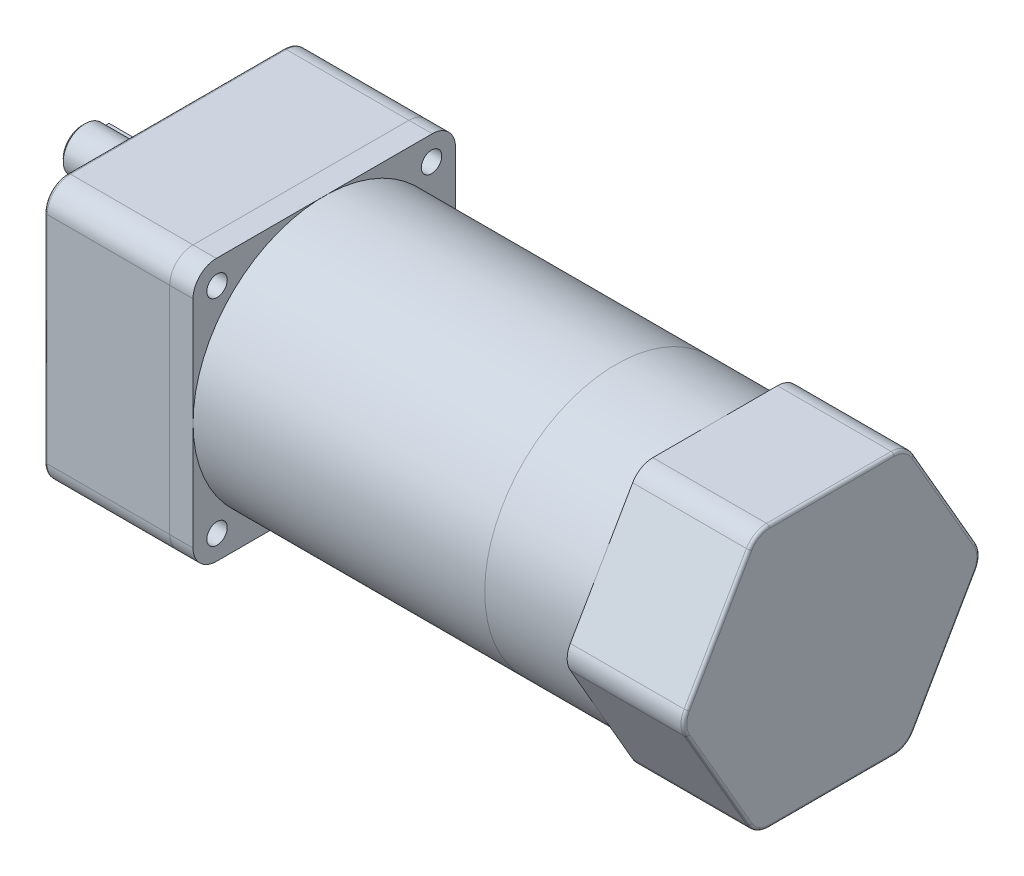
ISO-10303-21;
HEADER;
FILE_DESCRIPTION(('STEP AP214'),'2;1');
FILE_NAME('part.step','',(''),(''),'','','');
FILE_SCHEMA(('AUTOMOTIVE_DESIGN { 1 0 10303 214 1 1 1 1 }'));
ENDSEC;
DATA;
#1=APPLICATION_CONTEXT('core data for automotive mechanical design processes');
#2=APPLICATION_PROTOCOL_DEFINITION('international standard','automotive_design',2000,#1);
#3=PRODUCT_CONTEXT('',#1,'mechanical');
#4=PRODUCT('Part','Part','',(#3));
#5=PRODUCT_RELATED_PRODUCT_CATEGORY('part','',(#4));
#6=PRODUCT_DEFINITION_FORMATION('','',#4);
#7=PRODUCT_DEFINITION_CONTEXT('part definition',#1,'design');
#8=PRODUCT_DEFINITION('design','',#6,#7);
#9=PRODUCT_DEFINITION_SHAPE('','',#8);
#10=(LENGTH_UNIT() NAMED_UNIT(*) SI_UNIT(.MILLI.,.METRE.));
#11=(NAMED_UNIT(*) PLANE_ANGLE_UNIT() SI_UNIT($,.RADIAN.));
#12=(NAMED_UNIT(*) SI_UNIT($,.STERADIAN.) SOLID_ANGLE_UNIT());
#13=UNCERTAINTY_MEASURE_WITH_UNIT(LENGTH_MEASURE(1.E-05),#10,'distance_accuracy_value','');
#14=(GEOMETRIC_REPRESENTATION_CONTEXT(3) GLOBAL_UNCERTAINTY_ASSIGNED_CONTEXT((#13)) GLOBAL_UNIT_ASSIGNED_CONTEXT((#10,
#11,#12)) REPRESENTATION_CONTEXT('',''));
#15=CARTESIAN_POINT('',(0.,0.,0.));
#16=DIRECTION('',(0.,0.,1.));
#17=DIRECTION('',(1.,0.,0.));
#18=AXIS2_PLACEMENT_3D('',#15,#16,#17);
#19=CARTESIAN_POINT('',(-9.5,18.,-9.5));
#20=DIRECTION('',(0.,0.,1.));
#21=DIRECTION('',(1.,0.,0.));
#22=AXIS2_PLACEMENT_3D('',#19,#20,#21);
#23=CYLINDRICAL_SURFACE('',#22,2.5);
#24=DIRECTION('',(0.,0.,1.));
#25=VECTOR('',#24,1.);
#26=CARTESIAN_POINT('',(-9.5,15.5,-9.5));
#27=LINE('',#26,#25);
#28=CARTESIAN_POINT('',(-9.5,15.5,-9.2));
#29=VERTEX_POINT('',#28);
#30=CARTESIAN_POINT('',(-9.5,15.5,-4.5));
#31=VERTEX_POINT('',#30);
#32=EDGE_CURVE('E103',#29,#31,#27,.T.);
#33=ORIENTED_EDGE('',*,*,#32,.F.);
#34=CARTESIAN_POINT('',(-9.5,18.,-9.2));
#35=DIRECTION('',(0.,0.,-1.));
#36=DIRECTION('',(-1.,0.,0.));
#37=AXIS2_PLACEMENT_3D('',#34,#35,#36);
#38=CIRCLE('',#37,2.5);
#39=CARTESIAN_POINT('',(-9.5,20.5,-9.2));
#40=VERTEX_POINT('',#39);
#41=EDGE_CURVE('E146',#29,#40,#38,.F.);
#42=ORIENTED_EDGE('',*,*,#41,.T.);
#43=DIRECTION('',(0.,0.,1.));
#44=VECTOR('',#43,1.);
#45=CARTESIAN_POINT('',(-9.5,20.5,-9.5));
#46=LINE('',#45,#44);
#47=CARTESIAN_POINT('',(-9.5,20.5,-4.5));
#48=VERTEX_POINT('',#47);
#49=EDGE_CURVE('E125',#40,#48,#46,.T.);
#50=ORIENTED_EDGE('',*,*,#49,.T.);
#51=CARTESIAN_POINT('',(-9.5,18.,-4.5));
#52=DIRECTION('',(0.,0.,-1.));
#53=DIRECTION('',(-1.,0.,0.));
#54=AXIS2_PLACEMENT_3D('',#51,#52,#53);
#55=CIRCLE('',#54,2.5);
#56=EDGE_CURVE('E121',#48,#31,#55,.T.);
#57=ORIENTED_EDGE('',*,*,#56,.T.);
#58=EDGE_LOOP('',(#33,#42,#50,#57));
#59=FACE_BOUND('',#58,.T.);
#60=ADVANCED_FACE('F50',(#59),#23,.T.);
#61=CARTESIAN_POINT('',(-32.,15.5,-9.5));
#62=DIRECTION('',(0.,1.,0.));
#63=DIRECTION('',(-1.,0.,0.));
#64=AXIS2_PLACEMENT_3D('',#61,#62,#63);
#65=PLANE('',#64);
#66=DIRECTION('',(0.,0.,1.));
#67=VECTOR('',#66,1.);
#68=CARTESIAN_POINT('',(-32.,15.5,-9.5));
#69=LINE('',#68,#67);
#70=CARTESIAN_POINT('',(-32.,15.5,-9.2));
#71=VERTEX_POINT('',#70);
#72=CARTESIAN_POINT('',(-32.,15.5,-4.5));
#73=VERTEX_POINT('',#72);
#74=EDGE_CURVE('E115',#71,#73,#69,.T.);
#75=ORIENTED_EDGE('',*,*,#74,.F.);
#76=DIRECTION('',(1.,0.,0.));
#77=VECTOR('',#76,1.);
#78=CARTESIAN_POINT('',(-9.5,15.5,-9.2));
#79=LINE('',#78,#77);
#80=EDGE_CURVE('E109',#71,#29,#79,.T.);
#81=ORIENTED_EDGE('',*,*,#80,.T.);
#82=ORIENTED_EDGE('',*,*,#32,.T.);
#83=DIRECTION('',(-1.,0.,0.));
#84=VECTOR('',#83,1.);
#85=CARTESIAN_POINT('',(-32.,15.5,-4.5));
#86=LINE('',#85,#84);
#87=EDGE_CURVE('E106',#31,#73,#86,.T.);
#88=ORIENTED_EDGE('',*,*,#87,.T.);
#89=EDGE_LOOP('',(#75,#81,#82,#88));
#90=FACE_BOUND('',#89,.T.);
#91=ADVANCED_FACE('F105',(#90),#65,.F.);
#92=CARTESIAN_POINT('',(-32.,20.5,-9.5));
#93=DIRECTION('',(1.,0.,0.));
#94=DIRECTION('',(0.,0.,-1.));
#95=AXIS2_PLACEMENT_3D('',#92,#93,#94);
#96=PLANE('',#95);
#97=DIRECTION('',(0.,0.,1.));
#98=VECTOR('',#97,1.);
#99=CARTESIAN_POINT('',(-32.,20.5,-9.5));
#100=LINE('',#99,#98);
#101=CARTESIAN_POINT('',(-32.,20.5,-9.2));
#102=VERTEX_POINT('',#101);
#103=CARTESIAN_POINT('',(-32.,20.5,-4.5));
#104=VERTEX_POINT('',#103);
#105=EDGE_CURVE('E135',#102,#104,#100,.T.);
#106=ORIENTED_EDGE('',*,*,#105,.F.);
#107=DIRECTION('',(0.,-1.,0.));
#108=VECTOR('',#107,1.);
#109=CARTESIAN_POINT('',(-32.,15.5,-9.2));
#110=LINE('',#109,#108);
#111=EDGE_CURVE('E59',#102,#71,#110,.T.);
#112=ORIENTED_EDGE('',*,*,#111,.T.);
#113=ORIENTED_EDGE('',*,*,#74,.T.);
#114=DIRECTION('',(0.,1.,0.));
#115=VECTOR('',#114,1.);
#116=CARTESIAN_POINT('',(-32.,20.5,-4.5));
#117=LINE('',#116,#115);
#118=EDGE_CURVE('E123',#73,#104,#117,.T.);
#119=ORIENTED_EDGE('',*,*,#118,.T.);
#120=EDGE_LOOP('',(#106,#112,#113,#119));
#121=FACE_BOUND('',#120,.T.);
#122=ADVANCED_FACE('F170',(#121),#96,.F.);
#123=CARTESIAN_POINT('',(-9.5,20.5,-9.5));
#124=DIRECTION('',(0.,-1.,0.));
#125=DIRECTION('',(0.,0.,-1.));
#126=AXIS2_PLACEMENT_3D('',#123,#124,#125);
#127=PLANE('',#126);
#128=ORIENTED_EDGE('',*,*,#49,.F.);
#129=DIRECTION('',(-1.,0.,0.));
#130=VECTOR('',#129,1.);
#131=CARTESIAN_POINT('',(-32.,20.5,-9.2));
#132=LINE('',#131,#130);
#133=EDGE_CURVE('E12',#40,#102,#132,.T.);
#134=ORIENTED_EDGE('',*,*,#133,.T.);
#135=ORIENTED_EDGE('',*,*,#105,.T.);
#136=DIRECTION('',(1.,0.,0.));
#137=VECTOR('',#136,1.);
#138=CARTESIAN_POINT('',(-9.5,20.5,-4.5));
#139=LINE('',#138,#137);
#140=EDGE_CURVE('E132',#104,#48,#139,.T.);
#141=ORIENTED_EDGE('',*,*,#140,.T.);
#142=EDGE_LOOP('',(#128,#134,#135,#141));
#143=FACE_BOUND('',#142,.T.);
#144=ADVANCED_FACE('F169',(#143),#127,.F.);
#145=CARTESIAN_POINT('',(-9.5,18.,-9.5));
#146=DIRECTION('',(0.,0.,-1.));
#147=DIRECTION('',(-1.,0.,0.));
#148=AXIS2_PLACEMENT_3D('',#145,#146,#147);
#149=PLANE('',#148);
#150=DIRECTION('',(1.,0.,0.));
#151=VECTOR('',#150,1.);
#152=CARTESIAN_POINT('',(-9.5,20.2,-9.5));
#153=LINE('',#152,#151);
#154=CARTESIAN_POINT('',(-31.7,20.2,-9.5));
#155=VERTEX_POINT('',#154);
#156=CARTESIAN_POINT('',(-9.5,20.2,-9.5));
#157=VERTEX_POINT('',#156);
#158=EDGE_CURVE('E114',#155,#157,#153,.T.);
#159=ORIENTED_EDGE('',*,*,#158,.T.);
#160=CARTESIAN_POINT('',(-9.5,18.,-9.5));
#161=DIRECTION('',(0.,0.,-1.));
#162=DIRECTION('',(-1.,0.,0.));
#163=AXIS2_PLACEMENT_3D('',#160,#161,#162);
#164=CIRCLE('',#163,2.2);
#165=CARTESIAN_POINT('',(-9.5,15.8,-9.5));
#166=VERTEX_POINT('',#165);
#167=EDGE_CURVE('E143',#157,#166,#164,.T.);
#168=ORIENTED_EDGE('',*,*,#167,.T.);
#169=DIRECTION('',(-1.,0.,0.));
#170=VECTOR('',#169,1.);
#171=CARTESIAN_POINT('',(-32.,15.8,-9.5));
#172=LINE('',#171,#170);
#173=CARTESIAN_POINT('',(-31.7,15.8,-9.5));
#174=VERTEX_POINT('',#173);
#175=EDGE_CURVE('E141',#166,#174,#172,.T.);
#176=ORIENTED_EDGE('',*,*,#175,.T.);
#177=DIRECTION('',(0.,1.,0.));
#178=VECTOR('',#177,1.);
#179=CARTESIAN_POINT('',(-31.7,20.5,-9.5));
#180=LINE('',#179,#178);
#181=EDGE_CURVE('E139',#174,#155,#180,.T.);
#182=ORIENTED_EDGE('',*,*,#181,.T.);
#183=EDGE_LOOP('',(#159,#168,#176,#182));
#184=FACE_BOUND('',#183,.T.);
#185=ADVANCED_FACE('F164',(#184),#149,.T.);
#186=CARTESIAN_POINT('',(-9.5,18.,-4.5));
#187=DIRECTION('',(0.,0.,-1.));
#188=DIRECTION('',(-1.,0.,0.));
#189=AXIS2_PLACEMENT_3D('',#186,#187,#188);
#190=PLANE('',#189);
#191=ORIENTED_EDGE('',*,*,#56,.F.);
#192=ORIENTED_EDGE('',*,*,#140,.F.);
#193=ORIENTED_EDGE('',*,*,#118,.F.);
#194=ORIENTED_EDGE('',*,*,#87,.F.);
#195=EDGE_LOOP('',(#191,#192,#193,#194));
#196=FACE_BOUND('',#195,.T.);
#197=ADVANCED_FACE('F119',(#196),#190,.F.);
#198=CARTESIAN_POINT('',(-31.7,18.,-9.5));
#199=DIRECTION('',(-0.707106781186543,0.,-0.707106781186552));
#200=DIRECTION('',(0.,-1.,0.));
#201=AXIS2_PLACEMENT_3D('',#198,#199,#200);
#202=PLANE('',#201);
#203=DIRECTION('',(-0.577350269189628,-0.577350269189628,0.577350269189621));
#204=VECTOR('',#203,1.);
#205=CARTESIAN_POINT('',(-30.9666666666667,16.5333333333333,-10.2333333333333));
#206=LINE('',#205,#204);
#207=EDGE_CURVE('E129',#71,#174,#206,.F.);
#208=ORIENTED_EDGE('',*,*,#207,.F.);
#209=ORIENTED_EDGE('',*,*,#111,.F.);
#210=DIRECTION('',(-0.577350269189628,0.577350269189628,0.577350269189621));
#211=VECTOR('',#210,1.);
#212=CARTESIAN_POINT('',(-24.2999999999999,12.7999999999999,-16.9));
#213=LINE('',#212,#211);
#214=EDGE_CURVE('E54',#155,#102,#213,.T.);
#215=ORIENTED_EDGE('',*,*,#214,.F.);
#216=ORIENTED_EDGE('',*,*,#181,.F.);
#217=EDGE_LOOP('',(#208,#209,#215,#216));
#218=FACE_BOUND('',#217,.T.);
#219=ADVANCED_FACE('F52',(#218),#202,.T.);
#220=CARTESIAN_POINT('',(-9.5,20.2,-9.5));
#221=DIRECTION('',(0.,0.707106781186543,-0.707106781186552));
#222=DIRECTION('',(-1.,0.,0.));
#223=AXIS2_PLACEMENT_3D('',#220,#221,#222);
#224=PLANE('',#223);
#225=ORIENTED_EDGE('',*,*,#214,.T.);
#226=ORIENTED_EDGE('',*,*,#133,.F.);
#227=DIRECTION('',(0.,0.707106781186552,0.707106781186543));
#228=VECTOR('',#227,1.);
#229=CARTESIAN_POINT('',(-9.5,20.2,-9.5));
#230=LINE('',#229,#228);
#231=EDGE_CURVE('E152',#157,#40,#230,.T.);
#232=ORIENTED_EDGE('',*,*,#231,.F.);
#233=ORIENTED_EDGE('',*,*,#158,.F.);
#234=EDGE_LOOP('',(#225,#226,#232,#233));
#235=FACE_BOUND('',#234,.T.);
#236=ADVANCED_FACE('F187',(#235),#224,.T.);
#237=CARTESIAN_POINT('',(-9.5,15.8,-9.5));
#238=DIRECTION('',(0.,-0.707106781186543,-0.707106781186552));
#239=DIRECTION('',(1.,0.,0.));
#240=AXIS2_PLACEMENT_3D('',#237,#238,#239);
#241=PLANE('',#240);
#242=ORIENTED_EDGE('',*,*,#207,.T.);
#243=ORIENTED_EDGE('',*,*,#175,.F.);
#244=DIRECTION('',(0.,0.707106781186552,-0.707106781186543));
#245=VECTOR('',#244,1.);
#246=CARTESIAN_POINT('',(-9.5,15.5,-9.2));
#247=LINE('',#246,#245);
#248=EDGE_CURVE('E150',#29,#166,#247,.T.);
#249=ORIENTED_EDGE('',*,*,#248,.F.);
#250=ORIENTED_EDGE('',*,*,#80,.F.);
#251=EDGE_LOOP('',(#242,#243,#249,#250));
#252=FACE_BOUND('',#251,.T.);
#253=ADVANCED_FACE('F157',(#252),#241,.T.);
#254=CARTESIAN_POINT('',(-9.5,18.,-9.5));
#255=DIRECTION('',(0.,0.,1.));
#256=DIRECTION('',(1.,0.,0.));
#257=AXIS2_PLACEMENT_3D('',#254,#255,#256);
#258=CONICAL_SURFACE('',#257,2.2,0.785398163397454);
#259=ORIENTED_EDGE('',*,*,#231,.T.);
#260=ORIENTED_EDGE('',*,*,#41,.F.);
#261=ORIENTED_EDGE('',*,*,#248,.T.);
#262=ORIENTED_EDGE('',*,*,#167,.F.);
#263=EDGE_LOOP('',(#259,#260,#261,#262));
#264=FACE_BOUND('',#263,.T.);
#265=ADVANCED_FACE('F168',(#264),#258,.T.);
#266=CLOSED_SHELL('',(#60,#91,#122,#144,#185,#197,#219,#236,#253,#265));
#267=MANIFOLD_SOLID_BREP('B2',#266);
#268=CARTESIAN_POINT('',(-32.,18.,0.));
#269=DIRECTION('',(1.,0.,0.));
#270=DIRECTION('',(0.,0.,-1.));
#271=AXIS2_PLACEMENT_3D('',#268,#269,#270);
#272=CYLINDRICAL_SURFACE('',#271,7.5);
#273=CARTESIAN_POINT('',(-3.,18.,0.));
#274=DIRECTION('',(-1.,0.,0.));
#275=DIRECTION('',(0.,0.,1.));
#276=AXIS2_PLACEMENT_3D('',#273,#274,#275);
#277=CIRCLE('',#276,7.5);
#278=CARTESIAN_POINT('',(-3.,18.,7.5));
#279=VERTEX_POINT('',#278);
#280=EDGE_CURVE('E344',#279,#279,#277,.T.);
#281=ORIENTED_EDGE('',*,*,#280,.T.);
#282=EDGE_LOOP('',(#281));
#283=FACE_BOUND('',#282,.T.);
#284=DIRECTION('',(1.,0.,0.));
#285=VECTOR('',#284,1.);
#286=CARTESIAN_POINT('',(-32.,20.5,-7.07106781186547));
#287=LINE('',#286,#285);
#288=CARTESIAN_POINT('',(-31.,20.5,-7.07106781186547));
#289=VERTEX_POINT('',#288);
#290=CARTESIAN_POINT('',(-9.5,20.5,-7.07106781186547));
#291=VERTEX_POINT('',#290);
#292=EDGE_CURVE('E333',#289,#291,#287,.T.);
#293=ORIENTED_EDGE('',*,*,#292,.F.);
#294=CARTESIAN_POINT('',(-31.,18.,0.));
#295=DIRECTION('',(-1.,0.,0.));
#296=DIRECTION('',(0.,0.,1.));
#297=AXIS2_PLACEMENT_3D('',#294,#295,#296);
#298=CIRCLE('',#297,7.5);
#299=CARTESIAN_POINT('',(-31.,15.5,-7.07106781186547));
#300=VERTEX_POINT('',#299);
#301=EDGE_CURVE('E277',#289,#300,#298,.F.);
#302=ORIENTED_EDGE('',*,*,#301,.T.);
#303=DIRECTION('',(1.,0.,0.));
#304=VECTOR('',#303,1.);
#305=CARTESIAN_POINT('',(-32.,15.5,-7.07106781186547));
#306=LINE('',#305,#304);
#307=CARTESIAN_POINT('',(-9.5,15.5,-7.07106781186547));
#308=VERTEX_POINT('',#307);
#309=EDGE_CURVE('E335',#308,#300,#306,.F.);
#310=ORIENTED_EDGE('',*,*,#309,.F.);
#311=CARTESIAN_POINT('',(-9.5,20.5,-7.07106781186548));
#312=CARTESIAN_POINT('',(-9.43179292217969,20.5000089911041,-7.07105693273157));
#313=CARTESIAN_POINT('',(-9.36359192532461,20.4972088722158,-7.07205443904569));
#314=CARTESIAN_POINT('',(-9.22771896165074,20.4860604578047,-7.07598524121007));
#315=CARTESIAN_POINT('',(-9.16004685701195,20.477713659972,-7.07891801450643));
#316=CARTESIAN_POINT('',(-9.02590951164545,20.455574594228,-7.08662705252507));
#317=CARTESIAN_POINT('',(-8.95944129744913,20.4417984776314,-7.09139784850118));
#318=CARTESIAN_POINT('',(-8.8279917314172,20.4089418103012,-7.10262619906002));
#319=CARTESIAN_POINT('',(-8.7630104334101,20.3898610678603,-7.10908381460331));
#320=CARTESIAN_POINT('',(-8.57103842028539,20.324915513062,-7.13069940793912));
#321=CARTESIAN_POINT('',(-8.44682084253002,20.2713141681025,-7.14811243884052));
#322=CARTESIAN_POINT('',(-8.20912318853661,20.1451778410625,-7.1869703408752));
#323=CARTESIAN_POINT('',(-8.09564976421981,20.0726312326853,-7.20841768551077));
#324=CARTESIAN_POINT('',(-7.8782070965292,19.9076299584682,-7.25386182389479));
#325=CARTESIAN_POINT('',(-7.7747148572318,19.8145628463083,-7.27792189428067));
#326=CARTESIAN_POINT('',(-7.5844828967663,19.6124707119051,-7.32534626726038));
#327=CARTESIAN_POINT('',(-7.497746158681,19.5034428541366,-7.34871044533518));
#328=CARTESIAN_POINT('',(-7.34130177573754,19.2690092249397,-7.39284706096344));
#329=CARTESIAN_POINT('',(-7.27209769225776,19.1432502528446,-7.41353593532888));
#330=CARTESIAN_POINT('',(-7.1560192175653,18.8810730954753,-7.44924021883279));
#331=CARTESIAN_POINT('',(-7.10913800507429,18.7446581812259,-7.46425736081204));
#332=CARTESIAN_POINT('',(-7.04066072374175,18.4700733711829,-7.48647677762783));
#333=CARTESIAN_POINT('',(-7.01824182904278,18.3321295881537,-7.49393272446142));
#334=CARTESIAN_POINT('',(-6.99670924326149,18.0542474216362,-7.50109021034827));
#335=CARTESIAN_POINT('',(-6.99758999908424,17.9143095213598,-7.50079359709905));
#336=CARTESIAN_POINT('',(-7.0221107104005,17.6422403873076,-7.49265096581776));
#337=CARTESIAN_POINT('',(-7.04485659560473,17.5100182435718,-7.48510152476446));
#338=CARTESIAN_POINT('',(-7.1109829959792,17.2513898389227,-7.46367401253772));
#339=CARTESIAN_POINT('',(-7.15436465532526,17.1249839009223,-7.44979559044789));
#340=CARTESIAN_POINT('',(-7.26105342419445,16.8796184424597,-7.41689170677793));
#341=CARTESIAN_POINT('',(-7.32461511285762,16.760778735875,-7.39780094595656));
#342=CARTESIAN_POINT('',(-7.46964987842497,16.5351885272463,-7.35645969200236));
#343=CARTESIAN_POINT('',(-7.55112782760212,16.4284413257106,-7.33420833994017));
#344=CARTESIAN_POINT('',(-7.73417762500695,16.2247566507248,-7.28765679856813));
#345=CARTESIAN_POINT('',(-7.83651385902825,16.128515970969,-7.26330946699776));
#346=CARTESIAN_POINT('',(-8.05610372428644,15.9543199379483,-7.21618726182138));
#347=CARTESIAN_POINT('',(-8.17336215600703,15.8763704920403,-7.19341289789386));
#348=CARTESIAN_POINT('',(-8.42170044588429,15.7399916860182,-7.15175078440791));
#349=CARTESIAN_POINT('',(-8.55295878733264,15.6818674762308,-7.13292537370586));
#350=CARTESIAN_POINT('',(-8.8241174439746,15.5888494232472,-7.10202742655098));
#351=CARTESIAN_POINT('',(-8.96400373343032,15.5539189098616,-7.08994423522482));
#352=CARTESIAN_POINT('',(-9.17104659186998,15.5208546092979,-7.078413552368));
#353=CARTESIAN_POINT('',(-9.23660347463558,15.5130373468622,-7.07566669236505));
#354=CARTESIAN_POINT('',(-9.36809519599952,15.502613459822,-7.07199258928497));
#355=CARTESIAN_POINT('',(-9.43402943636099,15.5000001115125,-7.0710629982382));
#356=CARTESIAN_POINT('',(-9.5,15.5,-7.07106781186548));
#357=B_SPLINE_CURVE_WITH_KNOTS('',3,(#311,#312,#313,#314,#315,#316,#317,#318,#319,#320,#321,
#322,#323,#324,#325,#326,#327,#328,#329,#330,#331,#332,#333,#334,#335,#336,#337,#338,#339,#340,
#341,#342,#343,#344,#345,#346,#347,#348,#349,#350,#351,#352,#353,#354,#355,#356),.UNSPECIFIED.,
.F.,.F.,(4,2,2,2,2,2,2,2,2,2,2,2,2,2,2,2,2,2,2,2,2,2,4),(0.,0.20454621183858,0.409037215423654,
0.612924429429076,0.816819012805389,1.22401016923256,1.63145179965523,2.0532786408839,
2.47518051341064,2.90809434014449,3.34087579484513,3.75860278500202,4.17623021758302,
4.57747647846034,4.97874498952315,5.38529148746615,5.79194868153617,6.21771736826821,
6.64362337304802,7.07581676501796,7.50732520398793,7.70536340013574,7.90314555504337),.UNSPECIFIED.);
#358=EDGE_CURVE('E347',#291,#308,#357,.T.);
#359=ORIENTED_EDGE('',*,*,#358,.F.);
#360=EDGE_LOOP('',(#293,#302,#310,#359));
#361=FACE_BOUND('',#360,.T.);
#362=ADVANCED_FACE('F264',(#283,#361),#272,.T.);
#363=CARTESIAN_POINT('',(-32.,18.,0.));
#364=DIRECTION('',(-1.,0.,0.));
#365=DIRECTION('',(0.,0.,1.));
#366=AXIS2_PLACEMENT_3D('',#363,#364,#365);
#367=PLANE('',#366);
#368=DIRECTION('',(0.,0.,-1.));
#369=VECTOR('',#368,1.);
#370=CARTESIAN_POINT('',(-32.,15.5,-4.5));
#371=LINE('',#370,#369);
#372=CARTESIAN_POINT('',(-32.,15.5,-4.5));
#373=VERTEX_POINT('',#372);
#374=CARTESIAN_POINT('',(-32.,15.5,-6.00000000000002));
#375=VERTEX_POINT('',#374);
#376=EDGE_CURVE('E339',#373,#375,#371,.T.);
#377=ORIENTED_EDGE('',*,*,#376,.T.);
#378=CARTESIAN_POINT('',(-32.,18.,0.));
#379=DIRECTION('',(-1.,0.,0.));
#380=DIRECTION('',(0.,0.,1.));
#381=AXIS2_PLACEMENT_3D('',#378,#379,#380);
#382=CIRCLE('',#381,6.50000000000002);
#383=CARTESIAN_POINT('',(-32.,20.5,-6.00000000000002));
#384=VERTEX_POINT('',#383);
#385=EDGE_CURVE('E353',#375,#384,#382,.T.);
#386=ORIENTED_EDGE('',*,*,#385,.T.);
#387=DIRECTION('',(0.,0.,-1.));
#388=VECTOR('',#387,1.);
#389=CARTESIAN_POINT('',(-32.,20.5,-4.5));
#390=LINE('',#389,#388);
#391=CARTESIAN_POINT('',(-32.,20.5,-4.5));
#392=VERTEX_POINT('',#391);
#393=EDGE_CURVE('E336',#392,#384,#390,.T.);
#394=ORIENTED_EDGE('',*,*,#393,.F.);
#395=DIRECTION('',(0.,-1.,0.));
#396=VECTOR('',#395,1.);
#397=CARTESIAN_POINT('',(-32.,20.5,-4.5));
#398=LINE('',#397,#396);
#399=EDGE_CURVE('E320',#392,#373,#398,.T.);
#400=ORIENTED_EDGE('',*,*,#399,.T.);
#401=EDGE_LOOP('',(#377,#386,#394,#400));
#402=FACE_BOUND('',#401,.T.);
#403=ADVANCED_FACE('F363',(#402),#367,.T.);
#404=CARTESIAN_POINT('',(-3.,18.,0.));
#405=DIRECTION('',(-1.,0.,0.));
#406=DIRECTION('',(0.,0.,1.));
#407=AXIS2_PLACEMENT_3D('',#404,#405,#406);
#408=PLANE('',#407);
#409=ORIENTED_EDGE('',*,*,#280,.F.);
#410=EDGE_LOOP('',(#409));
#411=FACE_BOUND('',#410,.T.);
#412=ADVANCED_FACE('F361',(#411),#408,.F.);
#413=CARTESIAN_POINT('',(-9.5,18.,-4.5));
#414=DIRECTION('',(0.,0.,-1.));
#415=DIRECTION('',(-1.,0.,0.));
#416=AXIS2_PLACEMENT_3D('',#413,#414,#415);
#417=CYLINDRICAL_SURFACE('',#416,2.5);
#418=DIRECTION('',(0.,0.,-1.));
#419=VECTOR('',#418,1.);
#420=CARTESIAN_POINT('',(-9.5,20.5,-4.5));
#421=LINE('',#420,#419);
#422=CARTESIAN_POINT('',(-9.5,20.5,-4.5));
#423=VERTEX_POINT('',#422);
#424=EDGE_CURVE('E328',#423,#291,#421,.T.);
#425=ORIENTED_EDGE('',*,*,#424,.T.);
#426=ORIENTED_EDGE('',*,*,#358,.T.);
#427=DIRECTION('',(0.,0.,-1.));
#428=VECTOR('',#427,1.);
#429=CARTESIAN_POINT('',(-9.5,15.5,-4.5));
#430=LINE('',#429,#428);
#431=CARTESIAN_POINT('',(-9.5,15.5,-4.5));
#432=VERTEX_POINT('',#431);
#433=EDGE_CURVE('E330',#432,#308,#430,.T.);
#434=ORIENTED_EDGE('',*,*,#433,.F.);
#435=CARTESIAN_POINT('',(-9.5,18.,-4.5));
#436=DIRECTION('',(0.,0.,1.));
#437=DIRECTION('',(1.,0.,0.));
#438=AXIS2_PLACEMENT_3D('',#435,#436,#437);
#439=CIRCLE('',#438,2.5);
#440=EDGE_CURVE('E318',#432,#423,#439,.T.);
#441=ORIENTED_EDGE('',*,*,#440,.T.);
#442=EDGE_LOOP('',(#425,#426,#434,#441));
#443=FACE_BOUND('',#442,.T.);
#444=ADVANCED_FACE('F327',(#443),#417,.F.);
#445=CARTESIAN_POINT('',(-9.5,20.5,-4.5));
#446=DIRECTION('',(0.,-1.,0.));
#447=DIRECTION('',(0.,0.,-1.));
#448=AXIS2_PLACEMENT_3D('',#445,#446,#447);
#449=PLANE('',#448);
#450=ORIENTED_EDGE('',*,*,#393,.T.);
#451=CARTESIAN_POINT('',(-32.,20.5,-6.00000000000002));
#452=CARTESIAN_POINT('',(-31.9171731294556,20.5,-6.0897273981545));
#453=CARTESIAN_POINT('',(-31.8341996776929,20.5,-6.17931930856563));
#454=CARTESIAN_POINT('',(-31.6679908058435,20.5,-6.35825867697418));
#455=CARTESIAN_POINT('',(-31.5847553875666,20.5,-6.44760613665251));
#456=CARTESIAN_POINT('',(-31.4180527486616,20.5,-6.62608424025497));
#457=CARTESIAN_POINT('',(-31.3345855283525,20.5,-6.7152148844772));
#458=CARTESIAN_POINT('',(-31.1674427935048,20.5,-6.89328182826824));
#459=CARTESIAN_POINT('',(-31.0837672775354,20.5,-6.98221812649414));
#460=CARTESIAN_POINT('',(-31.,20.5,-7.07106781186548));
#461=B_SPLINE_CURVE_WITH_KNOTS('',3,(#451,#452,#453,#454,#455,#456,#457,#458,#459,#460),
.UNSPECIFIED.,.F.,.F.,(4,2,2,2,4),(0.,0.366335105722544,0.732667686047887,1.0989997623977,
1.46533436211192),.UNSPECIFIED.);
#462=EDGE_CURVE('E291',#384,#289,#461,.T.);
#463=ORIENTED_EDGE('',*,*,#462,.T.);
#464=ORIENTED_EDGE('',*,*,#292,.T.);
#465=ORIENTED_EDGE('',*,*,#424,.F.);
#466=DIRECTION('',(-1.,0.,0.));
#467=VECTOR('',#466,1.);
#468=CARTESIAN_POINT('',(-9.5,20.5,-4.5));
#469=LINE('',#468,#467);
#470=EDGE_CURVE('E315',#423,#392,#469,.T.);
#471=ORIENTED_EDGE('',*,*,#470,.T.);
#472=EDGE_LOOP('',(#450,#463,#464,#465,#471));
#473=FACE_BOUND('',#472,.T.);
#474=ADVANCED_FACE('F332',(#473),#449,.T.);
#475=CARTESIAN_POINT('',(-32.,15.5,-4.5));
#476=DIRECTION('',(0.,1.,0.));
#477=DIRECTION('',(0.,0.,1.));
#478=AXIS2_PLACEMENT_3D('',#475,#476,#477);
#479=PLANE('',#478);
#480=ORIENTED_EDGE('',*,*,#309,.T.);
#481=CARTESIAN_POINT('',(-31.,15.5,-7.07106781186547));
#482=CARTESIAN_POINT('',(-31.0837672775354,15.5,-6.98221812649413));
#483=CARTESIAN_POINT('',(-31.1674427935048,15.5,-6.89328182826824));
#484=CARTESIAN_POINT('',(-31.3345855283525,15.5,-6.7152148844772));
#485=CARTESIAN_POINT('',(-31.4180527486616,15.5,-6.62608424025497));
#486=CARTESIAN_POINT('',(-31.5847553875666,15.5,-6.44760613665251));
#487=CARTESIAN_POINT('',(-31.6679908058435,15.5,-6.35825867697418));
#488=CARTESIAN_POINT('',(-31.8341996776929,15.5,-6.17931930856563));
#489=CARTESIAN_POINT('',(-31.9171731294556,15.5,-6.08972739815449));
#490=CARTESIAN_POINT('',(-32.,15.5,-6.00000000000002));
#491=B_SPLINE_CURVE_WITH_KNOTS('',3,(#481,#482,#483,#484,#485,#486,#487,#488,#489,#490),
.UNSPECIFIED.,.F.,.F.,(4,2,2,2,4),(0.,0.366334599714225,0.732666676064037,1.09899925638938,
1.46533436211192),.UNSPECIFIED.);
#492=EDGE_CURVE('E48',#300,#375,#491,.T.);
#493=ORIENTED_EDGE('',*,*,#492,.T.);
#494=ORIENTED_EDGE('',*,*,#376,.F.);
#495=DIRECTION('',(1.,0.,0.));
#496=VECTOR('',#495,1.);
#497=CARTESIAN_POINT('',(-32.,15.5,-4.5));
#498=LINE('',#497,#496);
#499=EDGE_CURVE('E385',#373,#432,#498,.T.);
#500=ORIENTED_EDGE('',*,*,#499,.T.);
#501=ORIENTED_EDGE('',*,*,#433,.T.);
#502=EDGE_LOOP('',(#480,#493,#494,#500,#501));
#503=FACE_BOUND('',#502,.T.);
#504=ADVANCED_FACE('F389',(#503),#479,.T.);
#505=CARTESIAN_POINT('',(-9.5,18.,-4.5));
#506=DIRECTION('',(0.,0.,1.));
#507=DIRECTION('',(1.,0.,0.));
#508=AXIS2_PLACEMENT_3D('',#505,#506,#507);
#509=PLANE('',#508);
#510=ORIENTED_EDGE('',*,*,#440,.F.);
#511=ORIENTED_EDGE('',*,*,#499,.F.);
#512=ORIENTED_EDGE('',*,*,#399,.F.);
#513=ORIENTED_EDGE('',*,*,#470,.F.);
#514=EDGE_LOOP('',(#510,#511,#512,#513));
#515=FACE_BOUND('',#514,.T.);
#516=ADVANCED_FACE('F317',(#515),#509,.F.);
#517=CARTESIAN_POINT('',(-32.,18.,0.));
#518=DIRECTION('',(1.,0.,0.));
#519=DIRECTION('',(0.,0.,-1.));
#520=AXIS2_PLACEMENT_3D('',#517,#518,#519);
#521=CONICAL_SURFACE('',#520,6.50000000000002,0.785398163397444);
#522=ORIENTED_EDGE('',*,*,#492,.F.);
#523=ORIENTED_EDGE('',*,*,#301,.F.);
#524=ORIENTED_EDGE('',*,*,#462,.F.);
#525=ORIENTED_EDGE('',*,*,#385,.F.);
#526=EDGE_LOOP('',(#522,#523,#524,#525));
#527=FACE_BOUND('',#526,.T.);
#528=ADVANCED_FACE('F266',(#527),#521,.T.);
#529=CLOSED_SHELL('',(#362,#403,#412,#444,#474,#504,#516,#528));
#530=MANIFOLD_SOLID_BREP('B6',#529);
#531=CARTESIAN_POINT('',(0.,-37.,37.));
#532=DIRECTION('',(-1.,0.,0.));
#533=DIRECTION('',(0.,0.,1.));
#534=AXIS2_PLACEMENT_3D('',#531,#532,#533);
#535=PLANE('',#534);
#536=CARTESIAN_POINT('',(0.,0.,0.));
#537=DIRECTION('',(-1.,0.,0.));
#538=DIRECTION('',(0.,0.,1.));
#539=AXIS2_PLACEMENT_3D('',#536,#537,#538);
#540=CIRCLE('',#539,41.9);
#541=CARTESIAN_POINT('',(0.,0.,41.9));
#542=VERTEX_POINT('',#541);
#543=EDGE_CURVE('E262',#542,#542,#540,.F.);
#544=ORIENTED_EDGE('',*,*,#543,.T.);
#545=EDGE_LOOP('',(#544));
#546=FACE_BOUND('',#545,.T.);
#547=CARTESIAN_POINT('',(0.,-37.,-37.));
#548=DIRECTION('',(-1.,0.,0.));
#549=DIRECTION('',(0.,0.,1.));
#550=AXIS2_PLACEMENT_3D('',#547,#548,#549);
#551=CIRCLE('',#550,7.);
#552=CARTESIAN_POINT('',(0.,-37.,-44.));
#553=VERTEX_POINT('',#552);
#554=CARTESIAN_POINT('',(0.,-44.,-36.9999999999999));
#555=VERTEX_POINT('',#554);
#556=EDGE_CURVE('E615',#553,#555,#551,.T.);
#557=ORIENTED_EDGE('',*,*,#556,.T.);
#558=DIRECTION('',(0.,0.,-1.));
#559=VECTOR('',#558,1.);
#560=CARTESIAN_POINT('',(0.,-44.,37.));
#561=LINE('',#560,#559);
#562=CARTESIAN_POINT('',(0.,-44.,37.));
#563=VERTEX_POINT('',#562);
#564=EDGE_CURVE('E611',#555,#563,#561,.F.);
#565=ORIENTED_EDGE('',*,*,#564,.T.);
#566=CARTESIAN_POINT('',(0.,-37.,37.));
#567=DIRECTION('',(-1.,0.,0.));
#568=DIRECTION('',(0.,0.,1.));
#569=AXIS2_PLACEMENT_3D('',#566,#567,#568);
#570=CIRCLE('',#569,7.);
#571=CARTESIAN_POINT('',(0.,-37.,44.));
#572=VERTEX_POINT('',#571);
#573=EDGE_CURVE('E614',#563,#572,#570,.T.);
#574=ORIENTED_EDGE('',*,*,#573,.T.);
#575=DIRECTION('',(0.,-1.,0.));
#576=VECTOR('',#575,1.);
#577=CARTESIAN_POINT('',(0.,36.9999999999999,44.));
#578=LINE('',#577,#576);
#579=CARTESIAN_POINT('',(0.,36.9999999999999,44.));
#580=VERTEX_POINT('',#579);
#581=EDGE_CURVE('E578',#572,#580,#578,.F.);
#582=ORIENTED_EDGE('',*,*,#581,.T.);
#583=CARTESIAN_POINT('',(0.,37.,37.));
#584=DIRECTION('',(-1.,0.,0.));
#585=DIRECTION('',(0.,0.,1.));
#586=AXIS2_PLACEMENT_3D('',#583,#584,#585);
#587=CIRCLE('',#586,7.);
#588=CARTESIAN_POINT('',(0.,44.,37.));
#589=VERTEX_POINT('',#588);
#590=EDGE_CURVE('E622',#580,#589,#587,.T.);
#591=ORIENTED_EDGE('',*,*,#590,.T.);
#592=DIRECTION('',(0.,0.,1.));
#593=VECTOR('',#592,1.);
#594=CARTESIAN_POINT('',(0.,44.,-36.9999999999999));
#595=LINE('',#594,#593);
#596=CARTESIAN_POINT('',(0.,44.,-36.9999999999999));
#597=VERTEX_POINT('',#596);
#598=EDGE_CURVE('E620',#589,#597,#595,.F.);
#599=ORIENTED_EDGE('',*,*,#598,.T.);
#600=CARTESIAN_POINT('',(0.,37.,-37.));
#601=DIRECTION('',(-1.,0.,0.));
#602=DIRECTION('',(0.,0.,1.));
#603=AXIS2_PLACEMENT_3D('',#600,#601,#602);
#604=CIRCLE('',#603,7.);
#605=CARTESIAN_POINT('',(0.,36.9999999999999,-44.));
#606=VERTEX_POINT('',#605);
#607=EDGE_CURVE('E618',#597,#606,#604,.T.);
#608=ORIENTED_EDGE('',*,*,#607,.T.);
#609=DIRECTION('',(0.,1.,0.));
#610=VECTOR('',#609,1.);
#611=CARTESIAN_POINT('',(0.,-37.,-44.));
#612=LINE('',#611,#610);
#613=EDGE_CURVE('E572',#606,#553,#612,.F.);
#614=ORIENTED_EDGE('',*,*,#613,.T.);
#615=EDGE_LOOP('',(#557,#565,#574,#582,#591,#599,#608,#614));
#616=FACE_BOUND('',#615,.T.);
#617=CARTESIAN_POINT('',(0.,-36.7695526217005,-36.7695526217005));
#618=DIRECTION('',(-1.,0.,0.));
#619=DIRECTION('',(0.,0.,1.));
#620=AXIS2_PLACEMENT_3D('',#617,#618,#619);
#621=CIRCLE('',#620,2.49999999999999);
#622=CARTESIAN_POINT('',(0.,-36.7695526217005,-34.2695526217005));
#623=VERTEX_POINT('',#622);
#624=EDGE_CURVE('E659',#623,#623,#621,.T.);
#625=ORIENTED_EDGE('',*,*,#624,.F.);
#626=EDGE_LOOP('',(#625));
#627=FACE_BOUND('',#626,.T.);
#628=CARTESIAN_POINT('',(0.,36.7695526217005,-36.7695526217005));
#629=DIRECTION('',(-1.,0.,0.));
#630=DIRECTION('',(0.,0.,1.));
#631=AXIS2_PLACEMENT_3D('',#628,#629,#630);
#632=CIRCLE('',#631,2.49999999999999);
#633=CARTESIAN_POINT('',(0.,36.7695526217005,-34.2695526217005));
#634=VERTEX_POINT('',#633);
#635=EDGE_CURVE('E665',#634,#634,#632,.T.);
#636=ORIENTED_EDGE('',*,*,#635,.F.);
#637=EDGE_LOOP('',(#636));
#638=FACE_BOUND('',#637,.T.);
#639=CARTESIAN_POINT('',(0.,-36.7695526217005,36.7695526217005));
#640=DIRECTION('',(-1.,0.,0.));
#641=DIRECTION('',(0.,0.,1.));
#642=AXIS2_PLACEMENT_3D('',#639,#640,#641);
#643=CIRCLE('',#642,2.49999999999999);
#644=CARTESIAN_POINT('',(0.,-36.7695526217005,39.2695526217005));
#645=VERTEX_POINT('',#644);
#646=EDGE_CURVE('E671',#645,#645,#643,.T.);
#647=ORIENTED_EDGE('',*,*,#646,.F.);
#648=EDGE_LOOP('',(#647));
#649=FACE_BOUND('',#648,.T.);
#650=CARTESIAN_POINT('',(0.,36.7695526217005,36.7695526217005));
#651=DIRECTION('',(-1.,0.,0.));
#652=DIRECTION('',(0.,0.,1.));
#653=AXIS2_PLACEMENT_3D('',#650,#651,#652);
#654=CIRCLE('',#653,2.49999999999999);
#655=CARTESIAN_POINT('',(0.,36.7695526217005,39.2695526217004));
#656=VERTEX_POINT('',#655);
#657=EDGE_CURVE('E677',#656,#656,#654,.T.);
#658=ORIENTED_EDGE('',*,*,#657,.F.);
#659=EDGE_LOOP('',(#658));
#660=FACE_BOUND('',#659,.T.);
#661=ADVANCED_FACE('F454',(#546,#616,#627,#638,#649,#660),#535,.T.);
#662=CARTESIAN_POINT('',(43.,-37.,37.));
#663=DIRECTION('',(-1.,0.,0.));
#664=DIRECTION('',(0.,0.,1.));
#665=AXIS2_PLACEMENT_3D('',#662,#663,#664);
#666=CYLINDRICAL_SURFACE('',#665,8.);
#667=DIRECTION('',(-1.,0.,0.));
#668=VECTOR('',#667,1.);
#669=CARTESIAN_POINT('',(43.,-37.,45.));
#670=LINE('',#669,#668);
#671=CARTESIAN_POINT('',(43.,-37.,45.));
#672=VERTEX_POINT('',#671);
#673=CARTESIAN_POINT('',(1.,-37.,45.));
#674=VERTEX_POINT('',#673);
#675=EDGE_CURVE('E554',#672,#674,#670,.T.);
#676=ORIENTED_EDGE('',*,*,#675,.T.);
#677=CARTESIAN_POINT('',(1.,-37.,37.));
#678=DIRECTION('',(-1.,0.,0.));
#679=DIRECTION('',(0.,0.,1.));
#680=AXIS2_PLACEMENT_3D('',#677,#678,#679);
#681=CIRCLE('',#680,8.);
#682=CARTESIAN_POINT('',(1.,-45.,37.));
#683=VERTEX_POINT('',#682);
#684=EDGE_CURVE('E568',#674,#683,#681,.F.);
#685=ORIENTED_EDGE('',*,*,#684,.T.);
#686=DIRECTION('',(-1.,0.,0.));
#687=VECTOR('',#686,1.);
#688=CARTESIAN_POINT('',(43.,-45.,37.));
#689=LINE('',#688,#687);
#690=CARTESIAN_POINT('',(43.,-45.,37.));
#691=VERTEX_POINT('',#690);
#692=EDGE_CURVE('E588',#691,#683,#689,.T.);
#693=ORIENTED_EDGE('',*,*,#692,.F.);
#694=CARTESIAN_POINT('',(43.,-37.,37.));
#695=DIRECTION('',(1.,0.,0.));
#696=DIRECTION('',(0.,0.,1.));
#697=AXIS2_PLACEMENT_3D('',#694,#695,#696);
#698=CIRCLE('',#697,8.);
#699=EDGE_CURVE('E571',#672,#691,#698,.T.);
#700=ORIENTED_EDGE('',*,*,#699,.F.);
#701=EDGE_LOOP('',(#676,#685,#693,#700));
#702=FACE_BOUND('',#701,.T.);
#703=ADVANCED_FACE('F565',(#702),#666,.T.);
#704=CARTESIAN_POINT('',(43.,-45.,37.));
#705=DIRECTION('',(0.,1.,0.));
#706=DIRECTION('',(0.,0.,1.));
#707=AXIS2_PLACEMENT_3D('',#704,#705,#706);
#708=PLANE('',#707);
#709=ORIENTED_EDGE('',*,*,#692,.T.);
#710=DIRECTION('',(0.,0.,-1.));
#711=VECTOR('',#710,1.);
#712=CARTESIAN_POINT('',(1.,-45.,-36.9999999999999));
#713=LINE('',#712,#711);
#714=CARTESIAN_POINT('',(1.,-45.,-36.9999999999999));
#715=VERTEX_POINT('',#714);
#716=EDGE_CURVE('E590',#683,#715,#713,.T.);
#717=ORIENTED_EDGE('',*,*,#716,.T.);
#718=DIRECTION('',(-1.,0.,0.));
#719=VECTOR('',#718,1.);
#720=CARTESIAN_POINT('',(43.,-45.,-36.9999999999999));
#721=LINE('',#720,#719);
#722=CARTESIAN_POINT('',(43.,-45.,-36.9999999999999));
#723=VERTEX_POINT('',#722);
#724=EDGE_CURVE('E610',#723,#715,#721,.T.);
#725=ORIENTED_EDGE('',*,*,#724,.F.);
#726=DIRECTION('',(0.,0.,-1.));
#727=VECTOR('',#726,1.);
#728=CARTESIAN_POINT('',(43.,-45.,37.));
#729=LINE('',#728,#727);
#730=EDGE_CURVE('E652',#691,#723,#729,.T.);
#731=ORIENTED_EDGE('',*,*,#730,.F.);
#732=EDGE_LOOP('',(#709,#717,#725,#731));
#733=FACE_BOUND('',#732,.T.);
#734=ADVANCED_FACE('F709',(#733),#708,.F.);
#735=CARTESIAN_POINT('',(43.,-37.,-37.));
#736=DIRECTION('',(-1.,0.,0.));
#737=DIRECTION('',(0.,0.,1.));
#738=AXIS2_PLACEMENT_3D('',#735,#736,#737);
#739=CYLINDRICAL_SURFACE('',#738,8.);
#740=ORIENTED_EDGE('',*,*,#724,.T.);
#741=CARTESIAN_POINT('',(1.,-37.,-37.));
#742=DIRECTION('',(-1.,0.,0.));
#743=DIRECTION('',(0.,0.,1.));
#744=AXIS2_PLACEMENT_3D('',#741,#742,#743);
#745=CIRCLE('',#744,8.);
#746=CARTESIAN_POINT('',(1.,-37.,-45.));
#747=VERTEX_POINT('',#746);
#748=EDGE_CURVE('E608',#715,#747,#745,.F.);
#749=ORIENTED_EDGE('',*,*,#748,.T.);
#750=DIRECTION('',(-1.,0.,0.));
#751=VECTOR('',#750,1.);
#752=CARTESIAN_POINT('',(43.,-37.,-45.));
#753=LINE('',#752,#751);
#754=CARTESIAN_POINT('',(43.,-37.,-45.));
#755=VERTEX_POINT('',#754);
#756=EDGE_CURVE('E607',#755,#747,#753,.T.);
#757=ORIENTED_EDGE('',*,*,#756,.F.);
#758=CARTESIAN_POINT('',(43.,-37.,-37.));
#759=DIRECTION('',(1.,0.,0.));
#760=DIRECTION('',(0.,0.,-1.));
#761=AXIS2_PLACEMENT_3D('',#758,#759,#760);
#762=CIRCLE('',#761,8.);
#763=EDGE_CURVE('E650',#723,#755,#762,.T.);
#764=ORIENTED_EDGE('',*,*,#763,.F.);
#765=EDGE_LOOP('',(#740,#749,#757,#764));
#766=FACE_BOUND('',#765,.T.);
#767=ADVANCED_FACE('F820',(#766),#739,.T.);
#768=CARTESIAN_POINT('',(43.,-37.,-45.));
#769=DIRECTION('',(0.,0.,1.));
#770=DIRECTION('',(1.,0.,0.));
#771=AXIS2_PLACEMENT_3D('',#768,#769,#770);
#772=PLANE('',#771);
#773=ORIENTED_EDGE('',*,*,#756,.T.);
#774=DIRECTION('',(0.,1.,0.));
#775=VECTOR('',#774,1.);
#776=CARTESIAN_POINT('',(1.,36.9999999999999,-45.));
#777=LINE('',#776,#775);
#778=CARTESIAN_POINT('',(1.,36.9999999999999,-45.));
#779=VERTEX_POINT('',#778);
#780=EDGE_CURVE('E605',#747,#779,#777,.T.);
#781=ORIENTED_EDGE('',*,*,#780,.T.);
#782=DIRECTION('',(-1.,0.,0.));
#783=VECTOR('',#782,1.);
#784=CARTESIAN_POINT('',(43.,36.9999999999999,-45.));
#785=LINE('',#784,#783);
#786=CARTESIAN_POINT('',(43.,36.9999999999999,-45.));
#787=VERTEX_POINT('',#786);
#788=EDGE_CURVE('E604',#787,#779,#785,.T.);
#789=ORIENTED_EDGE('',*,*,#788,.F.);
#790=DIRECTION('',(0.,1.,0.));
#791=VECTOR('',#790,1.);
#792=CARTESIAN_POINT('',(43.,-37.,-45.));
#793=LINE('',#792,#791);
#794=EDGE_CURVE('E648',#755,#787,#793,.T.);
#795=ORIENTED_EDGE('',*,*,#794,.F.);
#796=EDGE_LOOP('',(#773,#781,#789,#795));
#797=FACE_BOUND('',#796,.T.);
#798=ADVANCED_FACE('F849',(#797),#772,.F.);
#799=CARTESIAN_POINT('',(43.,37.,-37.));
#800=DIRECTION('',(-1.,0.,0.));
#801=DIRECTION('',(0.,0.,1.));
#802=AXIS2_PLACEMENT_3D('',#799,#800,#801);
#803=CYLINDRICAL_SURFACE('',#802,8.);
#804=ORIENTED_EDGE('',*,*,#788,.T.);
#805=CARTESIAN_POINT('',(1.,37.,-37.));
#806=DIRECTION('',(-1.,0.,0.));
#807=DIRECTION('',(0.,0.,1.));
#808=AXIS2_PLACEMENT_3D('',#805,#806,#807);
#809=CIRCLE('',#808,8.);
#810=CARTESIAN_POINT('',(1.,45.,-36.9999999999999));
#811=VERTEX_POINT('',#810);
#812=EDGE_CURVE('E602',#779,#811,#809,.F.);
#813=ORIENTED_EDGE('',*,*,#812,.T.);
#814=DIRECTION('',(-1.,0.,0.));
#815=VECTOR('',#814,1.);
#816=CARTESIAN_POINT('',(43.,45.,-36.9999999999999));
#817=LINE('',#816,#815);
#818=CARTESIAN_POINT('',(43.,45.,-36.9999999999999));
#819=VERTEX_POINT('',#818);
#820=EDGE_CURVE('E601',#819,#811,#817,.T.);
#821=ORIENTED_EDGE('',*,*,#820,.F.);
#822=CARTESIAN_POINT('',(43.,37.,-37.));
#823=DIRECTION('',(1.,0.,0.));
#824=DIRECTION('',(0.,0.,1.));
#825=AXIS2_PLACEMENT_3D('',#822,#823,#824);
#826=CIRCLE('',#825,8.);
#827=EDGE_CURVE('E646',#787,#819,#826,.T.);
#828=ORIENTED_EDGE('',*,*,#827,.F.);
#829=EDGE_LOOP('',(#804,#813,#821,#828));
#830=FACE_BOUND('',#829,.T.);
#831=ADVANCED_FACE('F852',(#830),#803,.T.);
#832=CARTESIAN_POINT('',(43.,45.,37.));
#833=DIRECTION('',(0.,-1.,0.));
#834=DIRECTION('',(0.,0.,-1.));
#835=AXIS2_PLACEMENT_3D('',#832,#833,#834);
#836=PLANE('',#835);
#837=ORIENTED_EDGE('',*,*,#820,.T.);
#838=DIRECTION('',(0.,0.,1.));
#839=VECTOR('',#838,1.);
#840=CARTESIAN_POINT('',(1.,45.,37.));
#841=LINE('',#840,#839);
#842=CARTESIAN_POINT('',(1.,45.,37.));
#843=VERTEX_POINT('',#842);
#844=EDGE_CURVE('E599',#811,#843,#841,.T.);
#845=ORIENTED_EDGE('',*,*,#844,.T.);
#846=DIRECTION('',(-1.,0.,0.));
#847=VECTOR('',#846,1.);
#848=CARTESIAN_POINT('',(43.,45.,37.));
#849=LINE('',#848,#847);
#850=CARTESIAN_POINT('',(43.,45.,37.));
#851=VERTEX_POINT('',#850);
#852=EDGE_CURVE('E598',#851,#843,#849,.T.);
#853=ORIENTED_EDGE('',*,*,#852,.F.);
#854=DIRECTION('',(0.,0.,1.));
#855=VECTOR('',#854,1.);
#856=CARTESIAN_POINT('',(43.,45.,37.));
#857=LINE('',#856,#855);
#858=EDGE_CURVE('E644',#819,#851,#857,.T.);
#859=ORIENTED_EDGE('',*,*,#858,.F.);
#860=EDGE_LOOP('',(#837,#845,#853,#859));
#861=FACE_BOUND('',#860,.T.);
#862=ADVANCED_FACE('F855',(#861),#836,.F.);
#863=CARTESIAN_POINT('',(43.,37.,37.));
#864=DIRECTION('',(-1.,0.,0.));
#865=DIRECTION('',(0.,0.,1.));
#866=AXIS2_PLACEMENT_3D('',#863,#864,#865);
#867=CYLINDRICAL_SURFACE('',#866,8.);
#868=ORIENTED_EDGE('',*,*,#852,.T.);
#869=CARTESIAN_POINT('',(1.,37.,37.));
#870=DIRECTION('',(-1.,0.,0.));
#871=DIRECTION('',(0.,0.,1.));
#872=AXIS2_PLACEMENT_3D('',#869,#870,#871);
#873=CIRCLE('',#872,8.);
#874=CARTESIAN_POINT('',(1.,36.9999999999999,45.));
#875=VERTEX_POINT('',#874);
#876=EDGE_CURVE('E596',#843,#875,#873,.F.);
#877=ORIENTED_EDGE('',*,*,#876,.T.);
#878=DIRECTION('',(-1.,0.,0.));
#879=VECTOR('',#878,1.);
#880=CARTESIAN_POINT('',(43.,36.9999999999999,45.));
#881=LINE('',#880,#879);
#882=CARTESIAN_POINT('',(43.,36.9999999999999,45.));
#883=VERTEX_POINT('',#882);
#884=EDGE_CURVE('E557',#883,#875,#881,.T.);
#885=ORIENTED_EDGE('',*,*,#884,.F.);
#886=CARTESIAN_POINT('',(43.,37.,37.));
#887=DIRECTION('',(1.,0.,0.));
#888=DIRECTION('',(0.,0.,1.));
#889=AXIS2_PLACEMENT_3D('',#886,#887,#888);
#890=CIRCLE('',#889,8.);
#891=EDGE_CURVE('E642',#851,#883,#890,.T.);
#892=ORIENTED_EDGE('',*,*,#891,.F.);
#893=EDGE_LOOP('',(#868,#877,#885,#892));
#894=FACE_BOUND('',#893,.T.);
#895=ADVANCED_FACE('F828',(#894),#867,.T.);
#896=CARTESIAN_POINT('',(43.,-37.,45.));
#897=DIRECTION('',(0.,0.,-1.));
#898=DIRECTION('',(-1.,0.,0.));
#899=AXIS2_PLACEMENT_3D('',#896,#897,#898);
#900=PLANE('',#899);
#901=ORIENTED_EDGE('',*,*,#884,.T.);
#902=DIRECTION('',(0.,-1.,0.));
#903=VECTOR('',#902,1.);
#904=CARTESIAN_POINT('',(1.,-37.,45.));
#905=LINE('',#904,#903);
#906=EDGE_CURVE('E550',#875,#674,#905,.T.);
#907=ORIENTED_EDGE('',*,*,#906,.T.);
#908=ORIENTED_EDGE('',*,*,#675,.F.);
#909=DIRECTION('',(0.,-1.,0.));
#910=VECTOR('',#909,1.);
#911=CARTESIAN_POINT('',(43.,-37.,45.));
#912=LINE('',#911,#910);
#913=EDGE_CURVE('E639',#883,#672,#912,.T.);
#914=ORIENTED_EDGE('',*,*,#913,.F.);
#915=EDGE_LOOP('',(#901,#907,#908,#914));
#916=FACE_BOUND('',#915,.T.);
#917=ADVANCED_FACE('F552',(#916),#900,.F.);
#918=CARTESIAN_POINT('',(43.,-37.,37.));
#919=DIRECTION('',(-1.,0.,0.));
#920=DIRECTION('',(0.,0.,1.));
#921=AXIS2_PLACEMENT_3D('',#918,#919,#920);
#922=PLANE('',#921);
#923=CARTESIAN_POINT('',(43.,36.7695526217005,36.7695526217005));
#924=DIRECTION('',(-1.,0.,0.));
#925=DIRECTION('',(0.,0.,1.));
#926=AXIS2_PLACEMENT_3D('',#923,#924,#925);
#927=CIRCLE('',#926,3.5);
#928=CARTESIAN_POINT('',(43.,36.7695526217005,33.2695526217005));
#929=VERTEX_POINT('',#928);
#930=EDGE_CURVE('E562',#929,#929,#927,.T.);
#931=ORIENTED_EDGE('',*,*,#930,.T.);
#932=EDGE_LOOP('',(#931));
#933=FACE_BOUND('',#932,.T.);
#934=CARTESIAN_POINT('',(43.,36.7695526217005,-36.7695526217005));
#935=DIRECTION('',(-1.,0.,0.));
#936=DIRECTION('',(0.,0.,1.));
#937=AXIS2_PLACEMENT_3D('',#934,#935,#936);
#938=CIRCLE('',#937,3.5);
#939=CARTESIAN_POINT('',(43.,36.7695526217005,-40.2695526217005));
#940=VERTEX_POINT('',#939);
#941=EDGE_CURVE('E787',#940,#940,#938,.T.);
#942=ORIENTED_EDGE('',*,*,#941,.T.);
#943=EDGE_LOOP('',(#942));
#944=FACE_BOUND('',#943,.T.);
#945=CARTESIAN_POINT('',(43.,-36.7695526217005,-36.7695526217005));
#946=DIRECTION('',(-1.,0.,0.));
#947=DIRECTION('',(0.,0.,1.));
#948=AXIS2_PLACEMENT_3D('',#945,#946,#947);
#949=CIRCLE('',#948,3.5);
#950=CARTESIAN_POINT('',(43.,-36.7695526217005,-40.2695526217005));
#951=VERTEX_POINT('',#950);
#952=EDGE_CURVE('E790',#951,#951,#949,.T.);
#953=ORIENTED_EDGE('',*,*,#952,.T.);
#954=EDGE_LOOP('',(#953));
#955=FACE_BOUND('',#954,.T.);
#956=CARTESIAN_POINT('',(43.,-36.7695526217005,36.7695526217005));
#957=DIRECTION('',(-1.,0.,0.));
#958=DIRECTION('',(0.,0.,1.));
#959=AXIS2_PLACEMENT_3D('',#956,#957,#958);
#960=CIRCLE('',#959,3.5);
#961=CARTESIAN_POINT('',(43.,-36.7695526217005,33.2695526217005));
#962=VERTEX_POINT('',#961);
#963=EDGE_CURVE('E655',#962,#962,#960,.T.);
#964=ORIENTED_EDGE('',*,*,#963,.T.);
#965=EDGE_LOOP('',(#964));
#966=FACE_BOUND('',#965,.T.);
#967=ORIENTED_EDGE('',*,*,#699,.T.);
#968=ORIENTED_EDGE('',*,*,#730,.T.);
#969=ORIENTED_EDGE('',*,*,#763,.T.);
#970=ORIENTED_EDGE('',*,*,#794,.T.);
#971=ORIENTED_EDGE('',*,*,#827,.T.);
#972=ORIENTED_EDGE('',*,*,#858,.T.);
#973=ORIENTED_EDGE('',*,*,#891,.T.);
#974=ORIENTED_EDGE('',*,*,#913,.T.);
#975=EDGE_LOOP('',(#967,#968,#969,#970,#971,#972,#973,#974));
#976=FACE_BOUND('',#975,.T.);
#977=ADVANCED_FACE('F715',(#933,#944,#955,#966,#976),#922,.F.);
#978=CARTESIAN_POINT('',(1.,44.,37.));
#979=DIRECTION('',(0.,0.,-1.));
#980=DIRECTION('',(-1.,0.,0.));
#981=AXIS2_PLACEMENT_3D('',#978,#979,#980);
#982=CYLINDRICAL_SURFACE('',#981,1.);
#983=CARTESIAN_POINT('',(1.,44.,-36.9999999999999));
#984=DIRECTION('',(0.,0.,-1.));
#985=DIRECTION('',(0.,1.,0.));
#986=AXIS2_PLACEMENT_3D('',#983,#984,#985);
#987=CIRCLE('',#986,1.);
#988=EDGE_CURVE('E799',#597,#811,#987,.T.);
#989=ORIENTED_EDGE('',*,*,#988,.F.);
#990=ORIENTED_EDGE('',*,*,#598,.F.);
#991=CARTESIAN_POINT('',(1.,44.,37.));
#992=DIRECTION('',(0.,0.,1.));
#993=DIRECTION('',(1.,0.,0.));
#994=AXIS2_PLACEMENT_3D('',#991,#992,#993);
#995=CIRCLE('',#994,1.);
#996=EDGE_CURVE('E641',#843,#589,#995,.T.);
#997=ORIENTED_EDGE('',*,*,#996,.F.);
#998=ORIENTED_EDGE('',*,*,#844,.F.);
#999=EDGE_LOOP('',(#989,#990,#997,#998));
#1000=FACE_BOUND('',#999,.T.);
#1001=ADVANCED_FACE('F718',(#1000),#982,.T.);
#1002=CARTESIAN_POINT('',(1.,37.,37.));
#1003=DIRECTION('',(-1.,0.,0.));
#1004=DIRECTION('',(0.,0.,1.));
#1005=AXIS2_PLACEMENT_3D('',#1002,#1003,#1004);
#1006=TOROIDAL_SURFACE('',#1005,7.,1.);
#1007=ORIENTED_EDGE('',*,*,#996,.T.);
#1008=ORIENTED_EDGE('',*,*,#590,.F.);
#1009=CARTESIAN_POINT('',(1.,36.9999999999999,44.));
#1010=DIRECTION('',(0.,-1.,0.));
#1011=DIRECTION('',(0.,0.,-1.));
#1012=AXIS2_PLACEMENT_3D('',#1009,#1010,#1011);
#1013=CIRCLE('',#1012,1.);
#1014=EDGE_CURVE('E802',#875,#580,#1013,.T.);
#1015=ORIENTED_EDGE('',*,*,#1014,.F.);
#1016=ORIENTED_EDGE('',*,*,#876,.F.);
#1017=EDGE_LOOP('',(#1007,#1008,#1015,#1016));
#1018=FACE_BOUND('',#1017,.T.);
#1019=ADVANCED_FACE('F832',(#1018),#1006,.T.);
#1020=CARTESIAN_POINT('',(1.,37.,-37.));
#1021=DIRECTION('',(-1.,0.,0.));
#1022=DIRECTION('',(0.,0.,1.));
#1023=AXIS2_PLACEMENT_3D('',#1020,#1021,#1022);
#1024=TOROIDAL_SURFACE('',#1023,7.,1.);
#1025=ORIENTED_EDGE('',*,*,#988,.T.);
#1026=ORIENTED_EDGE('',*,*,#812,.F.);
#1027=CARTESIAN_POINT('',(1.,36.9999999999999,-44.));
#1028=DIRECTION('',(0.,-1.,0.));
#1029=DIRECTION('',(0.,0.,-1.));
#1030=AXIS2_PLACEMENT_3D('',#1027,#1028,#1029);
#1031=CIRCLE('',#1030,1.);
#1032=EDGE_CURVE('E582',#606,#779,#1031,.T.);
#1033=ORIENTED_EDGE('',*,*,#1032,.F.);
#1034=ORIENTED_EDGE('',*,*,#607,.F.);
#1035=EDGE_LOOP('',(#1025,#1026,#1033,#1034));
#1036=FACE_BOUND('',#1035,.T.);
#1037=ADVANCED_FACE('F843',(#1036),#1024,.T.);
#1038=CARTESIAN_POINT('',(1.,-37.,44.));
#1039=DIRECTION('',(0.,1.,0.));
#1040=DIRECTION('',(0.,0.,1.));
#1041=AXIS2_PLACEMENT_3D('',#1038,#1039,#1040);
#1042=CYLINDRICAL_SURFACE('',#1041,1.);
#1043=ORIENTED_EDGE('',*,*,#1014,.T.);
#1044=ORIENTED_EDGE('',*,*,#581,.F.);
#1045=CARTESIAN_POINT('',(1.,-37.,44.));
#1046=DIRECTION('',(0.,-1.,0.));
#1047=DIRECTION('',(0.,0.,-1.));
#1048=AXIS2_PLACEMENT_3D('',#1045,#1046,#1047);
#1049=CIRCLE('',#1048,1.);
#1050=EDGE_CURVE('E576',#674,#572,#1049,.T.);
#1051=ORIENTED_EDGE('',*,*,#1050,.F.);
#1052=ORIENTED_EDGE('',*,*,#906,.F.);
#1053=EDGE_LOOP('',(#1043,#1044,#1051,#1052));
#1054=FACE_BOUND('',#1053,.T.);
#1055=ADVANCED_FACE('F577',(#1054),#1042,.T.);
#1056=CARTESIAN_POINT('',(1.,-37.,-44.));
#1057=DIRECTION('',(0.,-1.,0.));
#1058=DIRECTION('',(0.,0.,-1.));
#1059=AXIS2_PLACEMENT_3D('',#1056,#1057,#1058);
#1060=CYLINDRICAL_SURFACE('',#1059,1.);
#1061=ORIENTED_EDGE('',*,*,#1032,.T.);
#1062=ORIENTED_EDGE('',*,*,#780,.F.);
#1063=CARTESIAN_POINT('',(1.,-37.,-44.));
#1064=DIRECTION('',(0.,-1.,0.));
#1065=DIRECTION('',(0.,0.,-1.));
#1066=AXIS2_PLACEMENT_3D('',#1063,#1064,#1065);
#1067=CIRCLE('',#1066,1.);
#1068=EDGE_CURVE('E581',#553,#747,#1067,.T.);
#1069=ORIENTED_EDGE('',*,*,#1068,.F.);
#1070=ORIENTED_EDGE('',*,*,#613,.F.);
#1071=EDGE_LOOP('',(#1061,#1062,#1069,#1070));
#1072=FACE_BOUND('',#1071,.T.);
#1073=ADVANCED_FACE('F847',(#1072),#1060,.T.);
#1074=CARTESIAN_POINT('',(1.,-37.,37.));
#1075=DIRECTION('',(-1.,0.,0.));
#1076=DIRECTION('',(0.,0.,1.));
#1077=AXIS2_PLACEMENT_3D('',#1074,#1075,#1076);
#1078=TOROIDAL_SURFACE('',#1077,7.,1.);
#1079=ORIENTED_EDGE('',*,*,#1050,.T.);
#1080=ORIENTED_EDGE('',*,*,#573,.F.);
#1081=CARTESIAN_POINT('',(1.,-44.,37.));
#1082=DIRECTION('',(0.,0.,-1.));
#1083=DIRECTION('',(-1.,0.,0.));
#1084=AXIS2_PLACEMENT_3D('',#1081,#1082,#1083);
#1085=CIRCLE('',#1084,1.);
#1086=EDGE_CURVE('E586',#683,#563,#1085,.T.);
#1087=ORIENTED_EDGE('',*,*,#1086,.F.);
#1088=ORIENTED_EDGE('',*,*,#684,.F.);
#1089=EDGE_LOOP('',(#1079,#1080,#1087,#1088));
#1090=FACE_BOUND('',#1089,.T.);
#1091=ADVANCED_FACE('F585',(#1090),#1078,.T.);
#1092=CARTESIAN_POINT('',(1.,-37.,-37.));
#1093=DIRECTION('',(-1.,0.,0.));
#1094=DIRECTION('',(0.,0.,1.));
#1095=AXIS2_PLACEMENT_3D('',#1092,#1093,#1094);
#1096=TOROIDAL_SURFACE('',#1095,7.,1.);
#1097=ORIENTED_EDGE('',*,*,#1068,.T.);
#1098=ORIENTED_EDGE('',*,*,#748,.F.);
#1099=CARTESIAN_POINT('',(1.,-44.,-36.9999999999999));
#1100=DIRECTION('',(0.,0.,1.));
#1101=DIRECTION('',(1.,0.,0.));
#1102=AXIS2_PLACEMENT_3D('',#1099,#1100,#1101);
#1103=CIRCLE('',#1102,1.);
#1104=EDGE_CURVE('E593',#555,#715,#1103,.T.);
#1105=ORIENTED_EDGE('',*,*,#1104,.F.);
#1106=ORIENTED_EDGE('',*,*,#556,.F.);
#1107=EDGE_LOOP('',(#1097,#1098,#1105,#1106));
#1108=FACE_BOUND('',#1107,.T.);
#1109=ADVANCED_FACE('F813',(#1108),#1096,.T.);
#1110=CARTESIAN_POINT('',(1.,-44.,37.));
#1111=DIRECTION('',(0.,0.,1.));
#1112=DIRECTION('',(1.,0.,0.));
#1113=AXIS2_PLACEMENT_3D('',#1110,#1111,#1112);
#1114=CYLINDRICAL_SURFACE('',#1113,1.);
#1115=ORIENTED_EDGE('',*,*,#1086,.T.);
#1116=ORIENTED_EDGE('',*,*,#564,.F.);
#1117=ORIENTED_EDGE('',*,*,#1104,.T.);
#1118=ORIENTED_EDGE('',*,*,#716,.F.);
#1119=EDGE_LOOP('',(#1115,#1116,#1117,#1118));
#1120=FACE_BOUND('',#1119,.T.);
#1121=ADVANCED_FACE('F724',(#1120),#1114,.T.);
#1122=CARTESIAN_POINT('',(17.,-36.7695526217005,-36.7695526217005));
#1123=DIRECTION('',(-1.,0.,0.));
#1124=DIRECTION('',(0.,0.,1.));
#1125=AXIS2_PLACEMENT_3D('',#1122,#1123,#1124);
#1126=CONICAL_SURFACE('',#1125,2.49999999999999,1.02974425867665);
#1127=CARTESIAN_POINT('',(18.5021515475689,-36.7695526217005,-36.7695526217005));
#1128=VERTEX_POINT('',#1127);
#1129=VERTEX_LOOP('',#1128);
#1130=FACE_BOUND('',#1129,.T.);
#1131=CARTESIAN_POINT('',(17.,-36.7695526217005,-36.7695526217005));
#1132=DIRECTION('',(-1.,0.,0.));
#1133=DIRECTION('',(0.,0.,1.));
#1134=AXIS2_PLACEMENT_3D('',#1131,#1132,#1133);
#1135=CIRCLE('',#1134,2.49999999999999);
#1136=CARTESIAN_POINT('',(17.,-36.7695526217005,-34.2695526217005));
#1137=VERTEX_POINT('',#1136);
#1138=EDGE_CURVE('E656',#1137,#1137,#1135,.T.);
#1139=ORIENTED_EDGE('',*,*,#1138,.T.);
#1140=EDGE_LOOP('',(#1139));
#1141=FACE_BOUND('',#1140,.T.);
#1142=ADVANCED_FACE('F720',(#1130,#1141),#1126,.F.);
#1143=CARTESIAN_POINT('',(0.,-36.7695526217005,-36.7695526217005));
#1144=DIRECTION('',(-1.,0.,0.));
#1145=DIRECTION('',(0.,0.,1.));
#1146=AXIS2_PLACEMENT_3D('',#1143,#1144,#1145);
#1147=CYLINDRICAL_SURFACE('',#1146,2.49999999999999);
#1148=ORIENTED_EDGE('',*,*,#1138,.F.);
#1149=EDGE_LOOP('',(#1148));
#1150=FACE_BOUND('',#1149,.T.);
#1151=ORIENTED_EDGE('',*,*,#624,.T.);
#1152=EDGE_LOOP('',(#1151));
#1153=FACE_BOUND('',#1152,.T.);
#1154=ADVANCED_FACE('F723',(#1150,#1153),#1147,.F.);
#1155=CARTESIAN_POINT('',(17.,36.7695526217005,-36.7695526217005));
#1156=DIRECTION('',(-1.,0.,0.));
#1157=DIRECTION('',(0.,0.,1.));
#1158=AXIS2_PLACEMENT_3D('',#1155,#1156,#1157);
#1159=CONICAL_SURFACE('',#1158,2.49999999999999,1.02974425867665);
#1160=CARTESIAN_POINT('',(18.5021515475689,36.7695526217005,-36.7695526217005));
#1161=VERTEX_POINT('',#1160);
#1162=VERTEX_LOOP('',#1161);
#1163=FACE_BOUND('',#1162,.T.);
#1164=CARTESIAN_POINT('',(17.,36.7695526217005,-36.7695526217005));
#1165=DIRECTION('',(-1.,0.,0.));
#1166=DIRECTION('',(0.,0.,1.));
#1167=AXIS2_PLACEMENT_3D('',#1164,#1165,#1166);
#1168=CIRCLE('',#1167,2.49999999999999);
#1169=CARTESIAN_POINT('',(17.,36.7695526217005,-34.2695526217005));
#1170=VERTEX_POINT('',#1169);
#1171=EDGE_CURVE('E662',#1170,#1170,#1168,.T.);
#1172=ORIENTED_EDGE('',*,*,#1171,.T.);
#1173=EDGE_LOOP('',(#1172));
#1174=FACE_BOUND('',#1173,.T.);
#1175=ADVANCED_FACE('F728',(#1163,#1174),#1159,.F.);
#1176=CARTESIAN_POINT('',(0.,36.7695526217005,-36.7695526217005));
#1177=DIRECTION('',(-1.,0.,0.));
#1178=DIRECTION('',(0.,0.,1.));
#1179=AXIS2_PLACEMENT_3D('',#1176,#1177,#1178);
#1180=CYLINDRICAL_SURFACE('',#1179,2.49999999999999);
#1181=ORIENTED_EDGE('',*,*,#1171,.F.);
#1182=EDGE_LOOP('',(#1181));
#1183=FACE_BOUND('',#1182,.T.);
#1184=ORIENTED_EDGE('',*,*,#635,.T.);
#1185=EDGE_LOOP('',(#1184));
#1186=FACE_BOUND('',#1185,.T.);
#1187=ADVANCED_FACE('F732',(#1183,#1186),#1180,.F.);
#1188=CARTESIAN_POINT('',(17.,-36.7695526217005,36.7695526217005));
#1189=DIRECTION('',(-1.,0.,0.));
#1190=DIRECTION('',(0.,0.,1.));
#1191=AXIS2_PLACEMENT_3D('',#1188,#1189,#1190);
#1192=CONICAL_SURFACE('',#1191,2.49999999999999,1.02974425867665);
#1193=CARTESIAN_POINT('',(18.5021515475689,-36.7695526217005,36.7695526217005));
#1194=VERTEX_POINT('',#1193);
#1195=VERTEX_LOOP('',#1194);
#1196=FACE_BOUND('',#1195,.T.);
#1197=CARTESIAN_POINT('',(17.,-36.7695526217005,36.7695526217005));
#1198=DIRECTION('',(-1.,0.,0.));
#1199=DIRECTION('',(0.,0.,1.));
#1200=AXIS2_PLACEMENT_3D('',#1197,#1198,#1199);
#1201=CIRCLE('',#1200,2.49999999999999);
#1202=CARTESIAN_POINT('',(17.,-36.7695526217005,39.2695526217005));
#1203=VERTEX_POINT('',#1202);
#1204=EDGE_CURVE('E668',#1203,#1203,#1201,.T.);
#1205=ORIENTED_EDGE('',*,*,#1204,.T.);
#1206=EDGE_LOOP('',(#1205));
#1207=FACE_BOUND('',#1206,.T.);
#1208=ADVANCED_FACE('F736',(#1196,#1207),#1192,.F.);
#1209=CARTESIAN_POINT('',(0.,-36.7695526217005,36.7695526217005));
#1210=DIRECTION('',(-1.,0.,0.));
#1211=DIRECTION('',(0.,0.,1.));
#1212=AXIS2_PLACEMENT_3D('',#1209,#1210,#1211);
#1213=CYLINDRICAL_SURFACE('',#1212,2.49999999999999);
#1214=ORIENTED_EDGE('',*,*,#1204,.F.);
#1215=EDGE_LOOP('',(#1214));
#1216=FACE_BOUND('',#1215,.T.);
#1217=ORIENTED_EDGE('',*,*,#646,.T.);
#1218=EDGE_LOOP('',(#1217));
#1219=FACE_BOUND('',#1218,.T.);
#1220=ADVANCED_FACE('F740',(#1216,#1219),#1213,.F.);
#1221=CARTESIAN_POINT('',(17.,36.7695526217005,36.7695526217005));
#1222=DIRECTION('',(-1.,0.,0.));
#1223=DIRECTION('',(0.,0.,1.));
#1224=AXIS2_PLACEMENT_3D('',#1221,#1222,#1223);
#1225=CONICAL_SURFACE('',#1224,2.49999999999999,1.02974425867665);
#1226=CARTESIAN_POINT('',(18.5021515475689,36.7695526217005,36.7695526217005));
#1227=VERTEX_POINT('',#1226);
#1228=VERTEX_LOOP('',#1227);
#1229=FACE_BOUND('',#1228,.T.);
#1230=CARTESIAN_POINT('',(17.,36.7695526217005,36.7695526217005));
#1231=DIRECTION('',(-1.,0.,0.));
#1232=DIRECTION('',(0.,0.,1.));
#1233=AXIS2_PLACEMENT_3D('',#1230,#1231,#1232);
#1234=CIRCLE('',#1233,2.49999999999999);
#1235=CARTESIAN_POINT('',(17.,36.7695526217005,39.2695526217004));
#1236=VERTEX_POINT('',#1235);
#1237=EDGE_CURVE('E674',#1236,#1236,#1234,.T.);
#1238=ORIENTED_EDGE('',*,*,#1237,.T.);
#1239=EDGE_LOOP('',(#1238));
#1240=FACE_BOUND('',#1239,.T.);
#1241=ADVANCED_FACE('F743',(#1229,#1240),#1225,.F.);
#1242=CARTESIAN_POINT('',(0.,36.7695526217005,36.7695526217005));
#1243=DIRECTION('',(-1.,0.,0.));
#1244=DIRECTION('',(0.,0.,1.));
#1245=AXIS2_PLACEMENT_3D('',#1242,#1243,#1244);
#1246=CYLINDRICAL_SURFACE('',#1245,2.49999999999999);
#1247=ORIENTED_EDGE('',*,*,#1237,.F.);
#1248=EDGE_LOOP('',(#1247));
#1249=FACE_BOUND('',#1248,.T.);
#1250=ORIENTED_EDGE('',*,*,#657,.T.);
#1251=EDGE_LOOP('',(#1250));
#1252=FACE_BOUND('',#1251,.T.);
#1253=ADVANCED_FACE('F747',(#1249,#1252),#1246,.F.);
#1254=CARTESIAN_POINT('',(25.,-36.7695526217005,36.7695526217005));
#1255=DIRECTION('',(1.,0.,0.));
#1256=DIRECTION('',(0.,0.,-1.));
#1257=AXIS2_PLACEMENT_3D('',#1254,#1255,#1256);
#1258=CYLINDRICAL_SURFACE('',#1257,3.5);
#1259=CARTESIAN_POINT('',(25.,-36.7695526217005,36.7695526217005));
#1260=DIRECTION('',(1.,0.,0.));
#1261=DIRECTION('',(0.,0.,-1.));
#1262=AXIS2_PLACEMENT_3D('',#1259,#1260,#1261);
#1263=CIRCLE('',#1262,3.5);
#1264=CARTESIAN_POINT('',(25.,-36.7695526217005,33.2695526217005));
#1265=VERTEX_POINT('',#1264);
#1266=EDGE_CURVE('E680',#1265,#1265,#1263,.T.);
#1267=CARTESIAN_POINT('',(25.,-36.7695526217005,33.2695526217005));
#1268=CARTESIAN_POINT('',(25.1875,-36.7695526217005,33.2695526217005));
#1269=CARTESIAN_POINT('',(25.375,-36.7695526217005,33.2695526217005));
#1270=CARTESIAN_POINT('',(25.75,-36.7695526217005,33.2695526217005));
#1271=CARTESIAN_POINT('',(25.9375,-36.7695526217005,33.2695526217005));
#1272=CARTESIAN_POINT('',(26.3125,-36.7695526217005,33.2695526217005));
#1273=CARTESIAN_POINT('',(26.5,-36.7695526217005,33.2695526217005));
#1274=CARTESIAN_POINT('',(26.875,-36.7695526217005,33.2695526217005));
#1275=CARTESIAN_POINT('',(27.0625,-36.7695526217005,33.2695526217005));
#1276=CARTESIAN_POINT('',(27.4375,-36.7695526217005,33.2695526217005));
#1277=CARTESIAN_POINT('',(27.625,-36.7695526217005,33.2695526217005));
#1278=CARTESIAN_POINT('',(28.,-36.7695526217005,33.2695526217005));
#1279=CARTESIAN_POINT('',(28.1875,-36.7695526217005,33.2695526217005));
#1280=CARTESIAN_POINT('',(28.5625,-36.7695526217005,33.2695526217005));
#1281=CARTESIAN_POINT('',(28.75,-36.7695526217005,33.2695526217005));
#1282=CARTESIAN_POINT('',(29.125,-36.7695526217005,33.2695526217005));
#1283=CARTESIAN_POINT('',(29.3125,-36.7695526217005,33.2695526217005));
#1284=CARTESIAN_POINT('',(29.6875,-36.7695526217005,33.2695526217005));
#1285=CARTESIAN_POINT('',(29.875,-36.7695526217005,33.2695526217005));
#1286=CARTESIAN_POINT('',(30.25,-36.7695526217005,33.2695526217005));
#1287=CARTESIAN_POINT('',(30.4375,-36.7695526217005,33.2695526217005));
#1288=CARTESIAN_POINT('',(30.8125,-36.7695526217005,33.2695526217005));
#1289=CARTESIAN_POINT('',(31.,-36.7695526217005,33.2695526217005));
#1290=CARTESIAN_POINT('',(31.375,-36.7695526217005,33.2695526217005));
#1291=CARTESIAN_POINT('',(31.5625,-36.7695526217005,33.2695526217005));
#1292=CARTESIAN_POINT('',(31.9375,-36.7695526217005,33.2695526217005));
#1293=CARTESIAN_POINT('',(32.125,-36.7695526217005,33.2695526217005));
#1294=CARTESIAN_POINT('',(32.5,-36.7695526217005,33.2695526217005));
#1295=CARTESIAN_POINT('',(32.6875,-36.7695526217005,33.2695526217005));
#1296=CARTESIAN_POINT('',(33.0625,-36.7695526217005,33.2695526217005));
#1297=CARTESIAN_POINT('',(33.25,-36.7695526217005,33.2695526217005));
#1298=CARTESIAN_POINT('',(33.625,-36.7695526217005,33.2695526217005));
#1299=CARTESIAN_POINT('',(33.8125,-36.7695526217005,33.2695526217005));
#1300=CARTESIAN_POINT('',(34.1875,-36.7695526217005,33.2695526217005));
#1301=CARTESIAN_POINT('',(34.375,-36.7695526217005,33.2695526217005));
#1302=CARTESIAN_POINT('',(34.75,-36.7695526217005,33.2695526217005));
#1303=CARTESIAN_POINT('',(34.9375,-36.7695526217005,33.2695526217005));
#1304=CARTESIAN_POINT('',(35.3125,-36.7695526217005,33.2695526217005));
#1305=CARTESIAN_POINT('',(35.5,-36.7695526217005,33.2695526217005));
#1306=CARTESIAN_POINT('',(35.875,-36.7695526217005,33.2695526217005));
#1307=CARTESIAN_POINT('',(36.0625,-36.7695526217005,33.2695526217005));
#1308=CARTESIAN_POINT('',(36.4375,-36.7695526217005,33.2695526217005));
#1309=CARTESIAN_POINT('',(36.625,-36.7695526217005,33.2695526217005));
#1310=CARTESIAN_POINT('',(37.,-36.7695526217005,33.2695526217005));
#1311=CARTESIAN_POINT('',(37.1875,-36.7695526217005,33.2695526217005));
#1312=CARTESIAN_POINT('',(37.5625,-36.7695526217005,33.2695526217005));
#1313=CARTESIAN_POINT('',(37.75,-36.7695526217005,33.2695526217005));
#1314=CARTESIAN_POINT('',(38.125,-36.7695526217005,33.2695526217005));
#1315=CARTESIAN_POINT('',(38.3125,-36.7695526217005,33.2695526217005));
#1316=CARTESIAN_POINT('',(38.6875,-36.7695526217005,33.2695526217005));
#1317=CARTESIAN_POINT('',(38.875,-36.7695526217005,33.2695526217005));
#1318=CARTESIAN_POINT('',(39.25,-36.7695526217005,33.2695526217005));
#1319=CARTESIAN_POINT('',(39.4375,-36.7695526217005,33.2695526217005));
#1320=CARTESIAN_POINT('',(39.8125,-36.7695526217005,33.2695526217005));
#1321=CARTESIAN_POINT('',(40.,-36.7695526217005,33.2695526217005));
#1322=CARTESIAN_POINT('',(40.375,-36.7695526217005,33.2695526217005));
#1323=CARTESIAN_POINT('',(40.5625,-36.7695526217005,33.2695526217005));
#1324=CARTESIAN_POINT('',(40.9375,-36.7695526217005,33.2695526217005));
#1325=CARTESIAN_POINT('',(41.125,-36.7695526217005,33.2695526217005));
#1326=CARTESIAN_POINT('',(41.5,-36.7695526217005,33.2695526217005));
#1327=CARTESIAN_POINT('',(41.6875,-36.7695526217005,33.2695526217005));
#1328=CARTESIAN_POINT('',(42.0625,-36.7695526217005,33.2695526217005));
#1329=CARTESIAN_POINT('',(42.25,-36.7695526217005,33.2695526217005));
#1330=CARTESIAN_POINT('',(42.625,-36.7695526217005,33.2695526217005));
#1331=CARTESIAN_POINT('',(42.8125,-36.7695526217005,33.2695526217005));
#1332=CARTESIAN_POINT('',(43.,-36.7695526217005,33.2695526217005));
#1333=B_SPLINE_CURVE_WITH_KNOTS('',3,(#1267,#1268,#1269,#1270,#1271,#1272,#1273,#1274,#1275,
#1276,#1277,#1278,#1279,#1280,#1281,#1282,#1283,#1284,#1285,#1286,#1287,#1288,#1289,#1290,#1291,
#1292,#1293,#1294,#1295,#1296,#1297,#1298,#1299,#1300,#1301,#1302,#1303,#1304,#1305,#1306,#1307,
#1308,#1309,#1310,#1311,#1312,#1313,#1314,#1315,#1316,#1317,#1318,#1319,#1320,#1321,#1322,#1323,
#1324,#1325,#1326,#1327,#1328,#1329,#1330,#1331,#1332),.UNSPECIFIED.,.F.,.F.,(4,2,2,2,2,2,2,2,2,
2,2,2,2,2,2,2,2,2,2,2,2,2,2,2,2,2,2,2,2,2,2,2,4),(0.,0.5625,1.125,1.6875,2.25,2.8125,3.375,
3.9375,4.5,5.0625,5.62500000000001,6.18750000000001,6.75000000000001,7.31250000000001,
7.87500000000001,8.43750000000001,9.00000000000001,9.56250000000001,10.125,10.6875,11.25,
11.8125,12.375,12.9375,13.5,14.0625,14.625,15.1875,15.75,16.3125,16.875,17.4375,18.),.UNSPECIFIED.);
#1334=EDGE_CURVE('BSEAM750',#1265,#962,#1333,.T.);
#1335=ORIENTED_EDGE('',*,*,#1266,.F.);
#1336=ORIENTED_EDGE('',*,*,#963,.F.);
#1337=ORIENTED_EDGE('',*,*,#1334,.T.);
#1338=ORIENTED_EDGE('',*,*,#1334,.F.);
#1339=EDGE_LOOP('',(#1335,#1337,#1336,#1338));
#1340=FACE_BOUND('',#1339,.T.);
#1341=ADVANCED_FACE('F750',(#1340),#1258,.F.);
#1342=CARTESIAN_POINT('',(25.,0.,0.));
#1343=DIRECTION('',(1.,0.,0.));
#1344=DIRECTION('',(0.,0.,-1.));
#1345=AXIS2_PLACEMENT_3D('',#1342,#1343,#1344);
#1346=PLANE('',#1345);
#1347=ORIENTED_EDGE('',*,*,#1266,.T.);
#1348=EDGE_LOOP('',(#1347));
#1349=FACE_BOUND('',#1348,.T.);
#1350=ADVANCED_FACE('F754',(#1349),#1346,.T.);
#1351=CARTESIAN_POINT('',(25.,-36.7695526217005,-36.7695526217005));
#1352=DIRECTION('',(1.,0.,0.));
#1353=DIRECTION('',(0.,0.,-1.));
#1354=AXIS2_PLACEMENT_3D('',#1351,#1352,#1353);
#1355=CYLINDRICAL_SURFACE('',#1354,3.5);
#1356=CARTESIAN_POINT('',(25.,-36.7695526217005,-36.7695526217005));
#1357=DIRECTION('',(1.,0.,0.));
#1358=DIRECTION('',(0.,0.,-1.));
#1359=AXIS2_PLACEMENT_3D('',#1356,#1357,#1358);
#1360=CIRCLE('',#1359,3.5);
#1361=CARTESIAN_POINT('',(25.,-36.7695526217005,-40.2695526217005));
#1362=VERTEX_POINT('',#1361);
#1363=EDGE_CURVE('E683',#1362,#1362,#1360,.T.);
#1364=CARTESIAN_POINT('',(25.,-36.7695526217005,-40.2695526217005));
#1365=CARTESIAN_POINT('',(25.1875,-36.7695526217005,-40.2695526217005));
#1366=CARTESIAN_POINT('',(25.375,-36.7695526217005,-40.2695526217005));
#1367=CARTESIAN_POINT('',(25.75,-36.7695526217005,-40.2695526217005));
#1368=CARTESIAN_POINT('',(25.9375,-36.7695526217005,-40.2695526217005));
#1369=CARTESIAN_POINT('',(26.3125,-36.7695526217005,-40.2695526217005));
#1370=CARTESIAN_POINT('',(26.5,-36.7695526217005,-40.2695526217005));
#1371=CARTESIAN_POINT('',(26.875,-36.7695526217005,-40.2695526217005));
#1372=CARTESIAN_POINT('',(27.0625,-36.7695526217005,-40.2695526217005));
#1373=CARTESIAN_POINT('',(27.4375,-36.7695526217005,-40.2695526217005));
#1374=CARTESIAN_POINT('',(27.625,-36.7695526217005,-40.2695526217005));
#1375=CARTESIAN_POINT('',(28.,-36.7695526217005,-40.2695526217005));
#1376=CARTESIAN_POINT('',(28.1875,-36.7695526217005,-40.2695526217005));
#1377=CARTESIAN_POINT('',(28.5625,-36.7695526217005,-40.2695526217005));
#1378=CARTESIAN_POINT('',(28.75,-36.7695526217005,-40.2695526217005));
#1379=CARTESIAN_POINT('',(29.125,-36.7695526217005,-40.2695526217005));
#1380=CARTESIAN_POINT('',(29.3125,-36.7695526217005,-40.2695526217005));
#1381=CARTESIAN_POINT('',(29.6875,-36.7695526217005,-40.2695526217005));
#1382=CARTESIAN_POINT('',(29.875,-36.7695526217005,-40.2695526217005));
#1383=CARTESIAN_POINT('',(30.25,-36.7695526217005,-40.2695526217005));
#1384=CARTESIAN_POINT('',(30.4375,-36.7695526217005,-40.2695526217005));
#1385=CARTESIAN_POINT('',(30.8125,-36.7695526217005,-40.2695526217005));
#1386=CARTESIAN_POINT('',(31.,-36.7695526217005,-40.2695526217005));
#1387=CARTESIAN_POINT('',(31.375,-36.7695526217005,-40.2695526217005));
#1388=CARTESIAN_POINT('',(31.5625,-36.7695526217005,-40.2695526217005));
#1389=CARTESIAN_POINT('',(31.9375,-36.7695526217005,-40.2695526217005));
#1390=CARTESIAN_POINT('',(32.125,-36.7695526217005,-40.2695526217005));
#1391=CARTESIAN_POINT('',(32.5,-36.7695526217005,-40.2695526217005));
#1392=CARTESIAN_POINT('',(32.6875,-36.7695526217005,-40.2695526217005));
#1393=CARTESIAN_POINT('',(33.0625,-36.7695526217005,-40.2695526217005));
#1394=CARTESIAN_POINT('',(33.25,-36.7695526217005,-40.2695526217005));
#1395=CARTESIAN_POINT('',(33.625,-36.7695526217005,-40.2695526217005));
#1396=CARTESIAN_POINT('',(33.8125,-36.7695526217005,-40.2695526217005));
#1397=CARTESIAN_POINT('',(34.1875,-36.7695526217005,-40.2695526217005));
#1398=CARTESIAN_POINT('',(34.375,-36.7695526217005,-40.2695526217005));
#1399=CARTESIAN_POINT('',(34.75,-36.7695526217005,-40.2695526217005));
#1400=CARTESIAN_POINT('',(34.9375,-36.7695526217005,-40.2695526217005));
#1401=CARTESIAN_POINT('',(35.3125,-36.7695526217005,-40.2695526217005));
#1402=CARTESIAN_POINT('',(35.5,-36.7695526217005,-40.2695526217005));
#1403=CARTESIAN_POINT('',(35.875,-36.7695526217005,-40.2695526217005));
#1404=CARTESIAN_POINT('',(36.0625,-36.7695526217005,-40.2695526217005));
#1405=CARTESIAN_POINT('',(36.4375,-36.7695526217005,-40.2695526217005));
#1406=CARTESIAN_POINT('',(36.625,-36.7695526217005,-40.2695526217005));
#1407=CARTESIAN_POINT('',(37.,-36.7695526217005,-40.2695526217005));
#1408=CARTESIAN_POINT('',(37.1875,-36.7695526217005,-40.2695526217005));
#1409=CARTESIAN_POINT('',(37.5625,-36.7695526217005,-40.2695526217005));
#1410=CARTESIAN_POINT('',(37.75,-36.7695526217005,-40.2695526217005));
#1411=CARTESIAN_POINT('',(38.125,-36.7695526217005,-40.2695526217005));
#1412=CARTESIAN_POINT('',(38.3125,-36.7695526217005,-40.2695526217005));
#1413=CARTESIAN_POINT('',(38.6875,-36.7695526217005,-40.2695526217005));
#1414=CARTESIAN_POINT('',(38.875,-36.7695526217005,-40.2695526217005));
#1415=CARTESIAN_POINT('',(39.25,-36.7695526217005,-40.2695526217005));
#1416=CARTESIAN_POINT('',(39.4375,-36.7695526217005,-40.2695526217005));
#1417=CARTESIAN_POINT('',(39.8125,-36.7695526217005,-40.2695526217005));
#1418=CARTESIAN_POINT('',(40.,-36.7695526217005,-40.2695526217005));
#1419=CARTESIAN_POINT('',(40.375,-36.7695526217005,-40.2695526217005));
#1420=CARTESIAN_POINT('',(40.5625,-36.7695526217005,-40.2695526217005));
#1421=CARTESIAN_POINT('',(40.9375,-36.7695526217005,-40.2695526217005));
#1422=CARTESIAN_POINT('',(41.125,-36.7695526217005,-40.2695526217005));
#1423=CARTESIAN_POINT('',(41.5,-36.7695526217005,-40.2695526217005));
#1424=CARTESIAN_POINT('',(41.6875,-36.7695526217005,-40.2695526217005));
#1425=CARTESIAN_POINT('',(42.0625,-36.7695526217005,-40.2695526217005));
#1426=CARTESIAN_POINT('',(42.25,-36.7695526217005,-40.2695526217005));
#1427=CARTESIAN_POINT('',(42.625,-36.7695526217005,-40.2695526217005));
#1428=CARTESIAN_POINT('',(42.8125,-36.7695526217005,-40.2695526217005));
#1429=CARTESIAN_POINT('',(43.,-36.7695526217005,-40.2695526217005));
#1430=B_SPLINE_CURVE_WITH_KNOTS('',3,(#1364,#1365,#1366,#1367,#1368,#1369,#1370,#1371,#1372,
#1373,#1374,#1375,#1376,#1377,#1378,#1379,#1380,#1381,#1382,#1383,#1384,#1385,#1386,#1387,#1388,
#1389,#1390,#1391,#1392,#1393,#1394,#1395,#1396,#1397,#1398,#1399,#1400,#1401,#1402,#1403,#1404,
#1405,#1406,#1407,#1408,#1409,#1410,#1411,#1412,#1413,#1414,#1415,#1416,#1417,#1418,#1419,#1420,
#1421,#1422,#1423,#1424,#1425,#1426,#1427,#1428,#1429),.UNSPECIFIED.,.F.,.F.,(4,2,2,2,2,2,2,2,2,
2,2,2,2,2,2,2,2,2,2,2,2,2,2,2,2,2,2,2,2,2,2,2,4),(0.,0.5625,1.125,1.6875,2.25,2.8125,3.375,
3.9375,4.5,5.0625,5.62500000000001,6.18750000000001,6.75000000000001,7.31250000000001,
7.87500000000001,8.43750000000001,9.00000000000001,9.56250000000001,10.125,10.6875,11.25,
11.8125,12.375,12.9375,13.5,14.0625,14.625,15.1875,15.75,16.3125,16.875,17.4375,18.),.UNSPECIFIED.);
#1431=EDGE_CURVE('BSEAM758',#1362,#951,#1430,.T.);
#1432=ORIENTED_EDGE('',*,*,#1363,.F.);
#1433=ORIENTED_EDGE('',*,*,#952,.F.);
#1434=ORIENTED_EDGE('',*,*,#1431,.T.);
#1435=ORIENTED_EDGE('',*,*,#1431,.F.);
#1436=EDGE_LOOP('',(#1432,#1434,#1433,#1435));
#1437=FACE_BOUND('',#1436,.T.);
#1438=ADVANCED_FACE('F758',(#1437),#1355,.F.);
#1439=CARTESIAN_POINT('',(25.,0.,0.));
#1440=DIRECTION('',(1.,0.,0.));
#1441=DIRECTION('',(0.,0.,-1.));
#1442=AXIS2_PLACEMENT_3D('',#1439,#1440,#1441);
#1443=PLANE('',#1442);
#1444=ORIENTED_EDGE('',*,*,#1363,.T.);
#1445=EDGE_LOOP('',(#1444));
#1446=FACE_BOUND('',#1445,.T.);
#1447=ADVANCED_FACE('F762',(#1446),#1443,.T.);
#1448=CARTESIAN_POINT('',(25.,36.7695526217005,-36.7695526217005));
#1449=DIRECTION('',(1.,0.,0.));
#1450=DIRECTION('',(0.,0.,-1.));
#1451=AXIS2_PLACEMENT_3D('',#1448,#1449,#1450);
#1452=CYLINDRICAL_SURFACE('',#1451,3.5);
#1453=CARTESIAN_POINT('',(25.,36.7695526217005,-36.7695526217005));
#1454=DIRECTION('',(1.,0.,0.));
#1455=DIRECTION('',(0.,0.,-1.));
#1456=AXIS2_PLACEMENT_3D('',#1453,#1454,#1455);
#1457=CIRCLE('',#1456,3.5);
#1458=CARTESIAN_POINT('',(25.,36.7695526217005,-40.2695526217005));
#1459=VERTEX_POINT('',#1458);
#1460=EDGE_CURVE('E686',#1459,#1459,#1457,.T.);
#1461=CARTESIAN_POINT('',(25.,36.7695526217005,-40.2695526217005));
#1462=CARTESIAN_POINT('',(25.1875,36.7695526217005,-40.2695526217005));
#1463=CARTESIAN_POINT('',(25.375,36.7695526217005,-40.2695526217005));
#1464=CARTESIAN_POINT('',(25.75,36.7695526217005,-40.2695526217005));
#1465=CARTESIAN_POINT('',(25.9375,36.7695526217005,-40.2695526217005));
#1466=CARTESIAN_POINT('',(26.3125,36.7695526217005,-40.2695526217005));
#1467=CARTESIAN_POINT('',(26.5,36.7695526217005,-40.2695526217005));
#1468=CARTESIAN_POINT('',(26.875,36.7695526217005,-40.2695526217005));
#1469=CARTESIAN_POINT('',(27.0625,36.7695526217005,-40.2695526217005));
#1470=CARTESIAN_POINT('',(27.4375,36.7695526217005,-40.2695526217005));
#1471=CARTESIAN_POINT('',(27.625,36.7695526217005,-40.2695526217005));
#1472=CARTESIAN_POINT('',(28.,36.7695526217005,-40.2695526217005));
#1473=CARTESIAN_POINT('',(28.1875,36.7695526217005,-40.2695526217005));
#1474=CARTESIAN_POINT('',(28.5625,36.7695526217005,-40.2695526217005));
#1475=CARTESIAN_POINT('',(28.75,36.7695526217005,-40.2695526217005));
#1476=CARTESIAN_POINT('',(29.125,36.7695526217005,-40.2695526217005));
#1477=CARTESIAN_POINT('',(29.3125,36.7695526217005,-40.2695526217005));
#1478=CARTESIAN_POINT('',(29.6875,36.7695526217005,-40.2695526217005));
#1479=CARTESIAN_POINT('',(29.875,36.7695526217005,-40.2695526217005));
#1480=CARTESIAN_POINT('',(30.25,36.7695526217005,-40.2695526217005));
#1481=CARTESIAN_POINT('',(30.4375,36.7695526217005,-40.2695526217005));
#1482=CARTESIAN_POINT('',(30.8125,36.7695526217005,-40.2695526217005));
#1483=CARTESIAN_POINT('',(31.,36.7695526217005,-40.2695526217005));
#1484=CARTESIAN_POINT('',(31.375,36.7695526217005,-40.2695526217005));
#1485=CARTESIAN_POINT('',(31.5625,36.7695526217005,-40.2695526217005));
#1486=CARTESIAN_POINT('',(31.9375,36.7695526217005,-40.2695526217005));
#1487=CARTESIAN_POINT('',(32.125,36.7695526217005,-40.2695526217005));
#1488=CARTESIAN_POINT('',(32.5,36.7695526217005,-40.2695526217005));
#1489=CARTESIAN_POINT('',(32.6875,36.7695526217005,-40.2695526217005));
#1490=CARTESIAN_POINT('',(33.0625,36.7695526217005,-40.2695526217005));
#1491=CARTESIAN_POINT('',(33.25,36.7695526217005,-40.2695526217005));
#1492=CARTESIAN_POINT('',(33.625,36.7695526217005,-40.2695526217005));
#1493=CARTESIAN_POINT('',(33.8125,36.7695526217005,-40.2695526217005));
#1494=CARTESIAN_POINT('',(34.1875,36.7695526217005,-40.2695526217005));
#1495=CARTESIAN_POINT('',(34.375,36.7695526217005,-40.2695526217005));
#1496=CARTESIAN_POINT('',(34.75,36.7695526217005,-40.2695526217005));
#1497=CARTESIAN_POINT('',(34.9375,36.7695526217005,-40.2695526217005));
#1498=CARTESIAN_POINT('',(35.3125,36.7695526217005,-40.2695526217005));
#1499=CARTESIAN_POINT('',(35.5,36.7695526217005,-40.2695526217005));
#1500=CARTESIAN_POINT('',(35.875,36.7695526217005,-40.2695526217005));
#1501=CARTESIAN_POINT('',(36.0625,36.7695526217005,-40.2695526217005));
#1502=CARTESIAN_POINT('',(36.4375,36.7695526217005,-40.2695526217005));
#1503=CARTESIAN_POINT('',(36.625,36.7695526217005,-40.2695526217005));
#1504=CARTESIAN_POINT('',(37.,36.7695526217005,-40.2695526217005));
#1505=CARTESIAN_POINT('',(37.1875,36.7695526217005,-40.2695526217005));
#1506=CARTESIAN_POINT('',(37.5625,36.7695526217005,-40.2695526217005));
#1507=CARTESIAN_POINT('',(37.75,36.7695526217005,-40.2695526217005));
#1508=CARTESIAN_POINT('',(38.125,36.7695526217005,-40.2695526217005));
#1509=CARTESIAN_POINT('',(38.3125,36.7695526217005,-40.2695526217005));
#1510=CARTESIAN_POINT('',(38.6875,36.7695526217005,-40.2695526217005));
#1511=CARTESIAN_POINT('',(38.875,36.7695526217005,-40.2695526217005));
#1512=CARTESIAN_POINT('',(39.25,36.7695526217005,-40.2695526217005));
#1513=CARTESIAN_POINT('',(39.4375,36.7695526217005,-40.2695526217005));
#1514=CARTESIAN_POINT('',(39.8125,36.7695526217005,-40.2695526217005));
#1515=CARTESIAN_POINT('',(40.,36.7695526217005,-40.2695526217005));
#1516=CARTESIAN_POINT('',(40.375,36.7695526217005,-40.2695526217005));
#1517=CARTESIAN_POINT('',(40.5625,36.7695526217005,-40.2695526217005));
#1518=CARTESIAN_POINT('',(40.9375,36.7695526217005,-40.2695526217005));
#1519=CARTESIAN_POINT('',(41.125,36.7695526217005,-40.2695526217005));
#1520=CARTESIAN_POINT('',(41.5,36.7695526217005,-40.2695526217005));
#1521=CARTESIAN_POINT('',(41.6875,36.7695526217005,-40.2695526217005));
#1522=CARTESIAN_POINT('',(42.0625,36.7695526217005,-40.2695526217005));
#1523=CARTESIAN_POINT('',(42.25,36.7695526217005,-40.2695526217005));
#1524=CARTESIAN_POINT('',(42.625,36.7695526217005,-40.2695526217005));
#1525=CARTESIAN_POINT('',(42.8125,36.7695526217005,-40.2695526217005));
#1526=CARTESIAN_POINT('',(43.,36.7695526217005,-40.2695526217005));
#1527=B_SPLINE_CURVE_WITH_KNOTS('',3,(#1461,#1462,#1463,#1464,#1465,#1466,#1467,#1468,#1469,
#1470,#1471,#1472,#1473,#1474,#1475,#1476,#1477,#1478,#1479,#1480,#1481,#1482,#1483,#1484,#1485,
#1486,#1487,#1488,#1489,#1490,#1491,#1492,#1493,#1494,#1495,#1496,#1497,#1498,#1499,#1500,#1501,
#1502,#1503,#1504,#1505,#1506,#1507,#1508,#1509,#1510,#1511,#1512,#1513,#1514,#1515,#1516,#1517,
#1518,#1519,#1520,#1521,#1522,#1523,#1524,#1525,#1526),.UNSPECIFIED.,.F.,.F.,(4,2,2,2,2,2,2,2,2,
2,2,2,2,2,2,2,2,2,2,2,2,2,2,2,2,2,2,2,2,2,2,2,4),(0.,0.5625,1.125,1.6875,2.25,2.8125,3.375,
3.9375,4.5,5.0625,5.62500000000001,6.18750000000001,6.75000000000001,7.31250000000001,
7.87500000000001,8.43750000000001,9.00000000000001,9.56250000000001,10.125,10.6875,11.25,
11.8125,12.375,12.9375,13.5,14.0625,14.625,15.1875,15.75,16.3125,16.875,17.4375,18.),.UNSPECIFIED.);
#1528=EDGE_CURVE('BSEAM766',#1459,#940,#1527,.T.);
#1529=ORIENTED_EDGE('',*,*,#1460,.F.);
#1530=ORIENTED_EDGE('',*,*,#941,.F.);
#1531=ORIENTED_EDGE('',*,*,#1528,.T.);
#1532=ORIENTED_EDGE('',*,*,#1528,.F.);
#1533=EDGE_LOOP('',(#1529,#1531,#1530,#1532));
#1534=FACE_BOUND('',#1533,.T.);
#1535=ADVANCED_FACE('F766',(#1534),#1452,.F.);
#1536=CARTESIAN_POINT('',(25.,0.,0.));
#1537=DIRECTION('',(1.,0.,0.));
#1538=DIRECTION('',(0.,0.,-1.));
#1539=AXIS2_PLACEMENT_3D('',#1536,#1537,#1538);
#1540=PLANE('',#1539);
#1541=ORIENTED_EDGE('',*,*,#1460,.T.);
#1542=EDGE_LOOP('',(#1541));
#1543=FACE_BOUND('',#1542,.T.);
#1544=ADVANCED_FACE('F770',(#1543),#1540,.T.);
#1545=CARTESIAN_POINT('',(25.,36.7695526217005,36.7695526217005));
#1546=DIRECTION('',(1.,0.,0.));
#1547=DIRECTION('',(0.,0.,-1.));
#1548=AXIS2_PLACEMENT_3D('',#1545,#1546,#1547);
#1549=CYLINDRICAL_SURFACE('',#1548,3.5);
#1550=CARTESIAN_POINT('',(25.,36.7695526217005,36.7695526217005));
#1551=DIRECTION('',(1.,0.,0.));
#1552=DIRECTION('',(0.,0.,-1.));
#1553=AXIS2_PLACEMENT_3D('',#1550,#1551,#1552);
#1554=CIRCLE('',#1553,3.5);
#1555=CARTESIAN_POINT('',(25.,36.7695526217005,33.2695526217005));
#1556=VERTEX_POINT('',#1555);
#1557=EDGE_CURVE('E689',#1556,#1556,#1554,.T.);
#1558=CARTESIAN_POINT('',(25.,36.7695526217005,33.2695526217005));
#1559=CARTESIAN_POINT('',(25.1875,36.7695526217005,33.2695526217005));
#1560=CARTESIAN_POINT('',(25.375,36.7695526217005,33.2695526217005));
#1561=CARTESIAN_POINT('',(25.75,36.7695526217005,33.2695526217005));
#1562=CARTESIAN_POINT('',(25.9375,36.7695526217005,33.2695526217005));
#1563=CARTESIAN_POINT('',(26.3125,36.7695526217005,33.2695526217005));
#1564=CARTESIAN_POINT('',(26.5,36.7695526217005,33.2695526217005));
#1565=CARTESIAN_POINT('',(26.875,36.7695526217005,33.2695526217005));
#1566=CARTESIAN_POINT('',(27.0625,36.7695526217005,33.2695526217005));
#1567=CARTESIAN_POINT('',(27.4375,36.7695526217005,33.2695526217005));
#1568=CARTESIAN_POINT('',(27.625,36.7695526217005,33.2695526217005));
#1569=CARTESIAN_POINT('',(28.,36.7695526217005,33.2695526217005));
#1570=CARTESIAN_POINT('',(28.1875,36.7695526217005,33.2695526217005));
#1571=CARTESIAN_POINT('',(28.5625,36.7695526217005,33.2695526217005));
#1572=CARTESIAN_POINT('',(28.75,36.7695526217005,33.2695526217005));
#1573=CARTESIAN_POINT('',(29.125,36.7695526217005,33.2695526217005));
#1574=CARTESIAN_POINT('',(29.3125,36.7695526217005,33.2695526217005));
#1575=CARTESIAN_POINT('',(29.6875,36.7695526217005,33.2695526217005));
#1576=CARTESIAN_POINT('',(29.875,36.7695526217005,33.2695526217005));
#1577=CARTESIAN_POINT('',(30.25,36.7695526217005,33.2695526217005));
#1578=CARTESIAN_POINT('',(30.4375,36.7695526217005,33.2695526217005));
#1579=CARTESIAN_POINT('',(30.8125,36.7695526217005,33.2695526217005));
#1580=CARTESIAN_POINT('',(31.,36.7695526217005,33.2695526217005));
#1581=CARTESIAN_POINT('',(31.375,36.7695526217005,33.2695526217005));
#1582=CARTESIAN_POINT('',(31.5625,36.7695526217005,33.2695526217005));
#1583=CARTESIAN_POINT('',(31.9375,36.7695526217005,33.2695526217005));
#1584=CARTESIAN_POINT('',(32.125,36.7695526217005,33.2695526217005));
#1585=CARTESIAN_POINT('',(32.5,36.7695526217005,33.2695526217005));
#1586=CARTESIAN_POINT('',(32.6875,36.7695526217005,33.2695526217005));
#1587=CARTESIAN_POINT('',(33.0625,36.7695526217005,33.2695526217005));
#1588=CARTESIAN_POINT('',(33.25,36.7695526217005,33.2695526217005));
#1589=CARTESIAN_POINT('',(33.625,36.7695526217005,33.2695526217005));
#1590=CARTESIAN_POINT('',(33.8125,36.7695526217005,33.2695526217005));
#1591=CARTESIAN_POINT('',(34.1875,36.7695526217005,33.2695526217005));
#1592=CARTESIAN_POINT('',(34.375,36.7695526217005,33.2695526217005));
#1593=CARTESIAN_POINT('',(34.75,36.7695526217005,33.2695526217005));
#1594=CARTESIAN_POINT('',(34.9375,36.7695526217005,33.2695526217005));
#1595=CARTESIAN_POINT('',(35.3125,36.7695526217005,33.2695526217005));
#1596=CARTESIAN_POINT('',(35.5,36.7695526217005,33.2695526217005));
#1597=CARTESIAN_POINT('',(35.875,36.7695526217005,33.2695526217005));
#1598=CARTESIAN_POINT('',(36.0625,36.7695526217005,33.2695526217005));
#1599=CARTESIAN_POINT('',(36.4375,36.7695526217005,33.2695526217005));
#1600=CARTESIAN_POINT('',(36.625,36.7695526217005,33.2695526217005));
#1601=CARTESIAN_POINT('',(37.,36.7695526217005,33.2695526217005));
#1602=CARTESIAN_POINT('',(37.1875,36.7695526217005,33.2695526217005));
#1603=CARTESIAN_POINT('',(37.5625,36.7695526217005,33.2695526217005));
#1604=CARTESIAN_POINT('',(37.75,36.7695526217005,33.2695526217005));
#1605=CARTESIAN_POINT('',(38.125,36.7695526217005,33.2695526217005));
#1606=CARTESIAN_POINT('',(38.3125,36.7695526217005,33.2695526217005));
#1607=CARTESIAN_POINT('',(38.6875,36.7695526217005,33.2695526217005));
#1608=CARTESIAN_POINT('',(38.875,36.7695526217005,33.2695526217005));
#1609=CARTESIAN_POINT('',(39.25,36.7695526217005,33.2695526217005));
#1610=CARTESIAN_POINT('',(39.4375,36.7695526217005,33.2695526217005));
#1611=CARTESIAN_POINT('',(39.8125,36.7695526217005,33.2695526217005));
#1612=CARTESIAN_POINT('',(40.,36.7695526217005,33.2695526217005));
#1613=CARTESIAN_POINT('',(40.375,36.7695526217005,33.2695526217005));
#1614=CARTESIAN_POINT('',(40.5625,36.7695526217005,33.2695526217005));
#1615=CARTESIAN_POINT('',(40.9375,36.7695526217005,33.2695526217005));
#1616=CARTESIAN_POINT('',(41.125,36.7695526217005,33.2695526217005));
#1617=CARTESIAN_POINT('',(41.5,36.7695526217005,33.2695526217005));
#1618=CARTESIAN_POINT('',(41.6875,36.7695526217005,33.2695526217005));
#1619=CARTESIAN_POINT('',(42.0625,36.7695526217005,33.2695526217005));
#1620=CARTESIAN_POINT('',(42.25,36.7695526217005,33.2695526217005));
#1621=CARTESIAN_POINT('',(42.625,36.7695526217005,33.2695526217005));
#1622=CARTESIAN_POINT('',(42.8125,36.7695526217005,33.2695526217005));
#1623=CARTESIAN_POINT('',(43.,36.7695526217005,33.2695526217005));
#1624=B_SPLINE_CURVE_WITH_KNOTS('',3,(#1558,#1559,#1560,#1561,#1562,#1563,#1564,#1565,#1566,
#1567,#1568,#1569,#1570,#1571,#1572,#1573,#1574,#1575,#1576,#1577,#1578,#1579,#1580,#1581,#1582,
#1583,#1584,#1585,#1586,#1587,#1588,#1589,#1590,#1591,#1592,#1593,#1594,#1595,#1596,#1597,#1598,
#1599,#1600,#1601,#1602,#1603,#1604,#1605,#1606,#1607,#1608,#1609,#1610,#1611,#1612,#1613,#1614,
#1615,#1616,#1617,#1618,#1619,#1620,#1621,#1622,#1623),.UNSPECIFIED.,.F.,.F.,(4,2,2,2,2,2,2,2,2,
2,2,2,2,2,2,2,2,2,2,2,2,2,2,2,2,2,2,2,2,2,2,2,4),(0.,0.5625,1.125,1.6875,2.25,2.8125,3.375,
3.9375,4.5,5.0625,5.62500000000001,6.18750000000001,6.75000000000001,7.31250000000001,
7.87500000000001,8.43750000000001,9.00000000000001,9.56250000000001,10.125,10.6875,11.25,
11.8125,12.375,12.9375,13.5,14.0625,14.625,15.1875,15.75,16.3125,16.875,17.4375,18.),.UNSPECIFIED.);
#1625=EDGE_CURVE('BSEAM774',#1556,#929,#1624,.T.);
#1626=ORIENTED_EDGE('',*,*,#1557,.F.);
#1627=ORIENTED_EDGE('',*,*,#930,.F.);
#1628=ORIENTED_EDGE('',*,*,#1625,.T.);
#1629=ORIENTED_EDGE('',*,*,#1625,.F.);
#1630=EDGE_LOOP('',(#1626,#1628,#1627,#1629));
#1631=FACE_BOUND('',#1630,.T.);
#1632=ADVANCED_FACE('F774',(#1631),#1549,.F.);
#1633=CARTESIAN_POINT('',(25.,0.,0.));
#1634=DIRECTION('',(1.,0.,0.));
#1635=DIRECTION('',(0.,0.,-1.));
#1636=AXIS2_PLACEMENT_3D('',#1633,#1634,#1635);
#1637=PLANE('',#1636);
#1638=ORIENTED_EDGE('',*,*,#1557,.T.);
#1639=EDGE_LOOP('',(#1638));
#1640=FACE_BOUND('',#1639,.T.);
#1641=ADVANCED_FACE('F701',(#1640),#1637,.T.);
#1642=CARTESIAN_POINT('',(0.5,0.,0.));
#1643=DIRECTION('',(-1.,0.,0.));
#1644=DIRECTION('',(0.,0.,1.));
#1645=AXIS2_PLACEMENT_3D('',#1642,#1643,#1644);
#1646=PLANE('',#1645);
#1647=CARTESIAN_POINT('',(0.5,0.,0.));
#1648=DIRECTION('',(-1.,0.,0.));
#1649=DIRECTION('',(0.,0.,1.));
#1650=AXIS2_PLACEMENT_3D('',#1647,#1648,#1649);
#1651=CIRCLE('',#1650,41.4);
#1652=CARTESIAN_POINT('',(0.5,0.,41.4));
#1653=VERTEX_POINT('',#1652);
#1654=EDGE_CURVE('E462',#1653,#1653,#1651,.T.);
#1655=ORIENTED_EDGE('',*,*,#1654,.T.);
#1656=EDGE_LOOP('',(#1655));
#1657=FACE_BOUND('',#1656,.T.);
#1658=ADVANCED_FACE('F694',(#1657),#1646,.T.);
#1659=CARTESIAN_POINT('',(0.5,0.,0.));
#1660=DIRECTION('',(-1.,0.,0.));
#1661=DIRECTION('',(0.,0.,1.));
#1662=AXIS2_PLACEMENT_3D('',#1659,#1660,#1661);
#1663=TOROIDAL_SURFACE('',#1662,41.9,0.5);
#1664=ORIENTED_EDGE('',*,*,#543,.F.);
#1665=EDGE_LOOP('',(#1664));
#1666=FACE_BOUND('',#1665,.T.);
#1667=ORIENTED_EDGE('',*,*,#1654,.F.);
#1668=EDGE_LOOP('',(#1667));
#1669=FACE_BOUND('',#1668,.T.);
#1670=ADVANCED_FACE('F456',(#1666,#1669),#1663,.T.);
#1671=CLOSED_SHELL('',(#661,#703,#734,#767,#798,#831,#862,#895,#917,#977,#1001,#1019,#1037,
#1055,#1073,#1091,#1109,#1121,#1142,#1154,#1175,#1187,#1208,#1220,#1241,#1253,#1341,#1350,#1438,
#1447,#1535,#1544,#1632,#1641,#1658,#1670));
#1672=MANIFOLD_SOLID_BREP('B42',#1671);
#1673=CARTESIAN_POINT('',(225.,0.,42.7239199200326));
#1674=DIRECTION('',(-1.,0.,0.));
#1675=DIRECTION('',(0.,0.,1.));
#1676=AXIS2_PLACEMENT_3D('',#1673,#1674,#1675);
#1677=CYLINDRICAL_SURFACE('',#1676,8.);
#1678=DIRECTION('',(-1.,0.,0.));
#1679=VECTOR('',#1678,1.);
#1680=CARTESIAN_POINT('',(225.,-4.00000000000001,49.6521231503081));
#1681=LINE('',#1680,#1679);
#1682=CARTESIAN_POINT('',(224.,-4.00000000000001,49.6521231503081));
#1683=VERTEX_POINT('',#1682);
#1684=CARTESIAN_POINT('',(185.,-4.00000000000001,49.6521231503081));
#1685=VERTEX_POINT('',#1684);
#1686=EDGE_CURVE('E1276',#1683,#1685,#1681,.T.);
#1687=ORIENTED_EDGE('',*,*,#1686,.F.);
#1688=CARTESIAN_POINT('',(224.,0.,42.7239199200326));
#1689=DIRECTION('',(1.,0.,0.));
#1690=DIRECTION('',(0.,0.,-1.));
#1691=AXIS2_PLACEMENT_3D('',#1688,#1689,#1690);
#1692=CIRCLE('',#1691,8.);
#1693=CARTESIAN_POINT('',(224.,4.00000000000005,49.6521231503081));
#1694=VERTEX_POINT('',#1693);
#1695=EDGE_CURVE('E452',#1683,#1694,#1692,.F.);
#1696=ORIENTED_EDGE('',*,*,#1695,.T.);
#1697=DIRECTION('',(-1.,0.,0.));
#1698=VECTOR('',#1697,1.);
#1699=CARTESIAN_POINT('',(225.,4.00000000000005,49.6521231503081));
#1700=LINE('',#1699,#1698);
#1701=CARTESIAN_POINT('',(185.,4.00000000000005,49.6521231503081));
#1702=VERTEX_POINT('',#1701);
#1703=EDGE_CURVE('E1297',#1694,#1702,#1700,.T.);
#1704=ORIENTED_EDGE('',*,*,#1703,.T.);
#1705=CARTESIAN_POINT('',(185.,0.,42.7239199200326));
#1706=DIRECTION('',(1.,0.,0.));
#1707=DIRECTION('',(0.,0.,-1.));
#1708=AXIS2_PLACEMENT_3D('',#1705,#1706,#1707);
#1709=CIRCLE('',#1708,8.);
#1710=EDGE_CURVE('E1291',#1702,#1685,#1709,.T.);
#1711=ORIENTED_EDGE('',*,*,#1710,.T.);
#1712=EDGE_LOOP('',(#1687,#1696,#1704,#1711));
#1713=FACE_BOUND('',#1712,.T.);
#1714=ADVANCED_FACE('F1152',(#1713),#1677,.T.);
#1715=CARTESIAN_POINT('',(225.,-4.00000000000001,49.6521231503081));
#1716=DIRECTION('',(0.,0.5,-0.866025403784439));
#1717=DIRECTION('',(0.,0.866025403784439,0.5));
#1718=AXIS2_PLACEMENT_3D('',#1715,#1716,#1717);
#1719=PLANE('',#1718);
#1720=DIRECTION('',(-1.,0.,0.));
#1721=VECTOR('',#1720,1.);
#1722=CARTESIAN_POINT('',(225.,-41.0000000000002,28.2901631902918));
#1723=LINE('',#1722,#1721);
#1724=CARTESIAN_POINT('',(224.,-41.0000000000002,28.2901631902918));
#1725=VERTEX_POINT('',#1724);
#1726=CARTESIAN_POINT('',(185.,-41.0000000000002,28.2901631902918));
#1727=VERTEX_POINT('',#1726);
#1728=EDGE_CURVE('E1285',#1725,#1727,#1723,.T.);
#1729=ORIENTED_EDGE('',*,*,#1728,.F.);
#1730=DIRECTION('',(0.,-0.866025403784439,-0.5));
#1731=VECTOR('',#1730,1.);
#1732=CARTESIAN_POINT('',(224.,-4.00000000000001,49.6521231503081));
#1733=LINE('',#1732,#1731);
#1734=EDGE_CURVE('E1161',#1725,#1683,#1733,.F.);
#1735=ORIENTED_EDGE('',*,*,#1734,.T.);
#1736=ORIENTED_EDGE('',*,*,#1686,.T.);
#1737=DIRECTION('',(0.,-0.866025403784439,-0.5));
#1738=VECTOR('',#1737,1.);
#1739=CARTESIAN_POINT('',(185.,-4.00000000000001,49.6521231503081));
#1740=LINE('',#1739,#1738);
#1741=EDGE_CURVE('E1279',#1685,#1727,#1740,.T.);
#1742=ORIENTED_EDGE('',*,*,#1741,.T.);
#1743=EDGE_LOOP('',(#1729,#1735,#1736,#1742));
#1744=FACE_BOUND('',#1743,.T.);
#1745=ADVANCED_FACE('F1278',(#1744),#1719,.F.);
#1746=CARTESIAN_POINT('',(225.,-37.0000000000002,21.3619599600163));
#1747=DIRECTION('',(-1.,0.,0.));
#1748=DIRECTION('',(0.,0.,1.));
#1749=AXIS2_PLACEMENT_3D('',#1746,#1747,#1748);
#1750=CYLINDRICAL_SURFACE('',#1749,8.);
#1751=DIRECTION('',(-1.,0.,0.));
#1752=VECTOR('',#1751,1.);
#1753=CARTESIAN_POINT('',(225.,-45.0000000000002,21.3619599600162));
#1754=LINE('',#1753,#1752);
#1755=CARTESIAN_POINT('',(224.,-45.0000000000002,21.3619599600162));
#1756=VERTEX_POINT('',#1755);
#1757=CARTESIAN_POINT('',(185.,-45.0000000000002,21.3619599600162));
#1758=VERTEX_POINT('',#1757);
#1759=EDGE_CURVE('E1347',#1756,#1758,#1754,.T.);
#1760=ORIENTED_EDGE('',*,*,#1759,.F.);
#1761=CARTESIAN_POINT('',(224.,-37.0000000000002,21.3619599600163));
#1762=DIRECTION('',(1.,0.,0.));
#1763=DIRECTION('',(0.,0.,-1.));
#1764=AXIS2_PLACEMENT_3D('',#1761,#1762,#1763);
#1765=CIRCLE('',#1764,8.);
#1766=EDGE_CURVE('E1176',#1756,#1725,#1765,.F.);
#1767=ORIENTED_EDGE('',*,*,#1766,.T.);
#1768=ORIENTED_EDGE('',*,*,#1728,.T.);
#1769=CARTESIAN_POINT('',(185.,-37.0000000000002,21.3619599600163));
#1770=DIRECTION('',(1.,0.,0.));
#1771=DIRECTION('',(0.,0.,-1.));
#1772=AXIS2_PLACEMENT_3D('',#1769,#1770,#1771);
#1773=CIRCLE('',#1772,8.);
#1774=EDGE_CURVE('E1294',#1727,#1758,#1773,.T.);
#1775=ORIENTED_EDGE('',*,*,#1774,.T.);
#1776=EDGE_LOOP('',(#1760,#1767,#1768,#1775));
#1777=FACE_BOUND('',#1776,.T.);
#1778=ADVANCED_FACE('F1514',(#1777),#1750,.T.);
#1779=CARTESIAN_POINT('',(225.,-45.0000000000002,21.3619599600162));
#1780=DIRECTION('',(0.,1.,0.));
#1781=DIRECTION('',(0.,0.,1.));
#1782=AXIS2_PLACEMENT_3D('',#1779,#1780,#1781);
#1783=PLANE('',#1782);
#1784=DIRECTION('',(-1.,0.,0.));
#1785=VECTOR('',#1784,1.);
#1786=CARTESIAN_POINT('',(225.,-45.0000000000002,-21.3619599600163));
#1787=LINE('',#1786,#1785);
#1788=CARTESIAN_POINT('',(224.,-45.0000000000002,-21.3619599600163));
#1789=VERTEX_POINT('',#1788);
#1790=CARTESIAN_POINT('',(185.,-45.0000000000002,-21.3619599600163));
#1791=VERTEX_POINT('',#1790);
#1792=EDGE_CURVE('E1345',#1789,#1791,#1787,.T.);
#1793=ORIENTED_EDGE('',*,*,#1792,.F.);
#1794=DIRECTION('',(0.,0.,-1.));
#1795=VECTOR('',#1794,1.);
#1796=CARTESIAN_POINT('',(224.,-45.0000000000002,21.3619599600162));
#1797=LINE('',#1796,#1795);
#1798=EDGE_CURVE('E1391',#1789,#1756,#1797,.F.);
#1799=ORIENTED_EDGE('',*,*,#1798,.T.);
#1800=ORIENTED_EDGE('',*,*,#1759,.T.);
#1801=DIRECTION('',(0.,0.,-1.));
#1802=VECTOR('',#1801,1.);
#1803=CARTESIAN_POINT('',(185.,-45.0000000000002,21.3619599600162));
#1804=LINE('',#1803,#1802);
#1805=EDGE_CURVE('E1304',#1758,#1791,#1804,.T.);
#1806=ORIENTED_EDGE('',*,*,#1805,.T.);
#1807=EDGE_LOOP('',(#1793,#1799,#1800,#1806));
#1808=FACE_BOUND('',#1807,.T.);
#1809=ADVANCED_FACE('F1513',(#1808),#1783,.F.);
#1810=CARTESIAN_POINT('',(225.,-37.0000000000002,-21.3619599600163));
#1811=DIRECTION('',(-1.,0.,0.));
#1812=DIRECTION('',(0.,0.,1.));
#1813=AXIS2_PLACEMENT_3D('',#1810,#1811,#1812);
#1814=CYLINDRICAL_SURFACE('',#1813,8.);
#1815=DIRECTION('',(-1.,0.,0.));
#1816=VECTOR('',#1815,1.);
#1817=CARTESIAN_POINT('',(225.,-41.0000000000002,-28.2901631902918));
#1818=LINE('',#1817,#1816);
#1819=CARTESIAN_POINT('',(224.,-41.0000000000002,-28.2901631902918));
#1820=VERTEX_POINT('',#1819);
#1821=CARTESIAN_POINT('',(185.,-41.0000000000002,-28.2901631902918));
#1822=VERTEX_POINT('',#1821);
#1823=EDGE_CURVE('E1343',#1820,#1822,#1818,.T.);
#1824=ORIENTED_EDGE('',*,*,#1823,.F.);
#1825=CARTESIAN_POINT('',(224.,-37.0000000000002,-21.3619599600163));
#1826=DIRECTION('',(1.,0.,0.));
#1827=DIRECTION('',(0.,0.,-1.));
#1828=AXIS2_PLACEMENT_3D('',#1825,#1826,#1827);
#1829=CIRCLE('',#1828,8.);
#1830=EDGE_CURVE('E1389',#1820,#1789,#1829,.F.);
#1831=ORIENTED_EDGE('',*,*,#1830,.T.);
#1832=ORIENTED_EDGE('',*,*,#1792,.T.);
#1833=CARTESIAN_POINT('',(185.,-37.0000000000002,-21.3619599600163));
#1834=DIRECTION('',(1.,0.,0.));
#1835=DIRECTION('',(0.,0.,-1.));
#1836=AXIS2_PLACEMENT_3D('',#1833,#1834,#1835);
#1837=CIRCLE('',#1836,8.);
#1838=EDGE_CURVE('E1307',#1791,#1822,#1837,.T.);
#1839=ORIENTED_EDGE('',*,*,#1838,.T.);
#1840=EDGE_LOOP('',(#1824,#1831,#1832,#1839));
#1841=FACE_BOUND('',#1840,.T.);
#1842=ADVANCED_FACE('F1510',(#1841),#1814,.T.);
#1843=CARTESIAN_POINT('',(225.,-41.0000000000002,-28.2901631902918));
#1844=DIRECTION('',(0.,0.5,0.866025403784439));
#1845=DIRECTION('',(0.,-0.866025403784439,0.5));
#1846=AXIS2_PLACEMENT_3D('',#1843,#1844,#1845);
#1847=PLANE('',#1846);
#1848=DIRECTION('',(-1.,0.,0.));
#1849=VECTOR('',#1848,1.);
#1850=CARTESIAN_POINT('',(225.,-4.00000000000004,-49.6521231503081));
#1851=LINE('',#1850,#1849);
#1852=CARTESIAN_POINT('',(224.,-4.00000000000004,-49.6521231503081));
#1853=VERTEX_POINT('',#1852);
#1854=CARTESIAN_POINT('',(185.,-4.00000000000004,-49.6521231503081));
#1855=VERTEX_POINT('',#1854);
#1856=EDGE_CURVE('E1341',#1853,#1855,#1851,.T.);
#1857=ORIENTED_EDGE('',*,*,#1856,.F.);
#1858=DIRECTION('',(0.,0.866025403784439,-0.5));
#1859=VECTOR('',#1858,1.);
#1860=CARTESIAN_POINT('',(224.,-41.0000000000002,-28.2901631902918));
#1861=LINE('',#1860,#1859);
#1862=EDGE_CURVE('E1387',#1853,#1820,#1861,.F.);
#1863=ORIENTED_EDGE('',*,*,#1862,.T.);
#1864=ORIENTED_EDGE('',*,*,#1823,.T.);
#1865=DIRECTION('',(0.,0.866025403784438,-0.5));
#1866=VECTOR('',#1865,1.);
#1867=CARTESIAN_POINT('',(185.,-41.0000000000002,-28.2901631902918));
#1868=LINE('',#1867,#1866);
#1869=EDGE_CURVE('E1310',#1822,#1855,#1868,.T.);
#1870=ORIENTED_EDGE('',*,*,#1869,.T.);
#1871=EDGE_LOOP('',(#1857,#1863,#1864,#1870));
#1872=FACE_BOUND('',#1871,.T.);
#1873=ADVANCED_FACE('F1504',(#1872),#1847,.F.);
#1874=CARTESIAN_POINT('',(225.,0.,-42.7239199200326));
#1875=DIRECTION('',(-1.,0.,0.));
#1876=DIRECTION('',(0.,0.,1.));
#1877=AXIS2_PLACEMENT_3D('',#1874,#1875,#1876);
#1878=CYLINDRICAL_SURFACE('',#1877,8.);
#1879=DIRECTION('',(-1.,0.,0.));
#1880=VECTOR('',#1879,1.);
#1881=CARTESIAN_POINT('',(225.,4.00000000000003,-49.6521231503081));
#1882=LINE('',#1881,#1880);
#1883=CARTESIAN_POINT('',(224.,4.00000000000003,-49.6521231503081));
#1884=VERTEX_POINT('',#1883);
#1885=CARTESIAN_POINT('',(185.,4.00000000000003,-49.6521231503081));
#1886=VERTEX_POINT('',#1885);
#1887=EDGE_CURVE('E1339',#1884,#1886,#1882,.T.);
#1888=ORIENTED_EDGE('',*,*,#1887,.F.);
#1889=CARTESIAN_POINT('',(224.,0.,-42.7239199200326));
#1890=DIRECTION('',(1.,0.,0.));
#1891=DIRECTION('',(0.,0.,-1.));
#1892=AXIS2_PLACEMENT_3D('',#1889,#1890,#1891);
#1893=CIRCLE('',#1892,8.);
#1894=EDGE_CURVE('E1385',#1884,#1853,#1893,.F.);
#1895=ORIENTED_EDGE('',*,*,#1894,.T.);
#1896=ORIENTED_EDGE('',*,*,#1856,.T.);
#1897=CARTESIAN_POINT('',(185.,0.,-42.7239199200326));
#1898=DIRECTION('',(1.,0.,0.));
#1899=DIRECTION('',(0.,0.,-1.));
#1900=AXIS2_PLACEMENT_3D('',#1897,#1898,#1899);
#1901=CIRCLE('',#1900,8.);
#1902=EDGE_CURVE('E1313',#1855,#1886,#1901,.T.);
#1903=ORIENTED_EDGE('',*,*,#1902,.T.);
#1904=EDGE_LOOP('',(#1888,#1895,#1896,#1903));
#1905=FACE_BOUND('',#1904,.T.);
#1906=ADVANCED_FACE('F1502',(#1905),#1878,.T.);
#1907=CARTESIAN_POINT('',(225.,4.00000000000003,-49.6521231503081));
#1908=DIRECTION('',(0.,-0.5,0.866025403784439));
#1909=DIRECTION('',(0.,-0.866025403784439,-0.5));
#1910=AXIS2_PLACEMENT_3D('',#1907,#1908,#1909);
#1911=PLANE('',#1910);
#1912=DIRECTION('',(-1.,0.,0.));
#1913=VECTOR('',#1912,1.);
#1914=CARTESIAN_POINT('',(225.,41.0000000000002,-28.2901631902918));
#1915=LINE('',#1914,#1913);
#1916=CARTESIAN_POINT('',(224.,41.0000000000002,-28.2901631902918));
#1917=VERTEX_POINT('',#1916);
#1918=CARTESIAN_POINT('',(185.,41.0000000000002,-28.2901631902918));
#1919=VERTEX_POINT('',#1918);
#1920=EDGE_CURVE('E1337',#1917,#1919,#1915,.T.);
#1921=ORIENTED_EDGE('',*,*,#1920,.F.);
#1922=DIRECTION('',(0.,0.866025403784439,0.5));
#1923=VECTOR('',#1922,1.);
#1924=CARTESIAN_POINT('',(224.,4.00000000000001,-49.6521231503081));
#1925=LINE('',#1924,#1923);
#1926=EDGE_CURVE('E1383',#1917,#1884,#1925,.F.);
#1927=ORIENTED_EDGE('',*,*,#1926,.T.);
#1928=ORIENTED_EDGE('',*,*,#1887,.T.);
#1929=DIRECTION('',(0.,0.866025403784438,0.5));
#1930=VECTOR('',#1929,1.);
#1931=CARTESIAN_POINT('',(185.,4.00000000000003,-49.6521231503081));
#1932=LINE('',#1931,#1930);
#1933=EDGE_CURVE('E1316',#1886,#1919,#1932,.T.);
#1934=ORIENTED_EDGE('',*,*,#1933,.T.);
#1935=EDGE_LOOP('',(#1921,#1927,#1928,#1934));
#1936=FACE_BOUND('',#1935,.T.);
#1937=ADVANCED_FACE('F1490',(#1936),#1911,.F.);
#1938=CARTESIAN_POINT('',(225.,37.0000000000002,-21.3619599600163));
#1939=DIRECTION('',(-1.,0.,0.));
#1940=DIRECTION('',(0.,0.,1.));
#1941=AXIS2_PLACEMENT_3D('',#1938,#1939,#1940);
#1942=CYLINDRICAL_SURFACE('',#1941,8.);
#1943=DIRECTION('',(-1.,0.,0.));
#1944=VECTOR('',#1943,1.);
#1945=CARTESIAN_POINT('',(225.,45.0000000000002,-21.3619599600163));
#1946=LINE('',#1945,#1944);
#1947=CARTESIAN_POINT('',(224.,45.0000000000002,-21.3619599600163));
#1948=VERTEX_POINT('',#1947);
#1949=CARTESIAN_POINT('',(185.,45.0000000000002,-21.3619599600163));
#1950=VERTEX_POINT('',#1949);
#1951=EDGE_CURVE('E1335',#1948,#1950,#1946,.T.);
#1952=ORIENTED_EDGE('',*,*,#1951,.F.);
#1953=CARTESIAN_POINT('',(224.,37.0000000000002,-21.3619599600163));
#1954=DIRECTION('',(1.,0.,0.));
#1955=DIRECTION('',(0.,0.,-1.));
#1956=AXIS2_PLACEMENT_3D('',#1953,#1954,#1955);
#1957=CIRCLE('',#1956,8.);
#1958=EDGE_CURVE('E1381',#1948,#1917,#1957,.F.);
#1959=ORIENTED_EDGE('',*,*,#1958,.T.);
#1960=ORIENTED_EDGE('',*,*,#1920,.T.);
#1961=CARTESIAN_POINT('',(185.,37.0000000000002,-21.3619599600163));
#1962=DIRECTION('',(1.,0.,0.));
#1963=DIRECTION('',(0.,0.,1.));
#1964=AXIS2_PLACEMENT_3D('',#1961,#1962,#1963);
#1965=CIRCLE('',#1964,8.);
#1966=EDGE_CURVE('E1319',#1919,#1950,#1965,.T.);
#1967=ORIENTED_EDGE('',*,*,#1966,.T.);
#1968=EDGE_LOOP('',(#1952,#1959,#1960,#1967));
#1969=FACE_BOUND('',#1968,.T.);
#1970=ADVANCED_FACE('F1487',(#1969),#1942,.T.);
#1971=CARTESIAN_POINT('',(225.,45.0000000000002,-21.3619599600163));
#1972=DIRECTION('',(0.,-1.,0.));
#1973=DIRECTION('',(0.,0.,-1.));
#1974=AXIS2_PLACEMENT_3D('',#1971,#1972,#1973);
#1975=PLANE('',#1974);
#1976=DIRECTION('',(-1.,0.,0.));
#1977=VECTOR('',#1976,1.);
#1978=CARTESIAN_POINT('',(225.,45.0000000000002,21.3619599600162));
#1979=LINE('',#1978,#1977);
#1980=CARTESIAN_POINT('',(224.,45.0000000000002,21.3619599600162));
#1981=VERTEX_POINT('',#1980);
#1982=CARTESIAN_POINT('',(185.,45.0000000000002,21.3619599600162));
#1983=VERTEX_POINT('',#1982);
#1984=EDGE_CURVE('E1333',#1981,#1983,#1979,.T.);
#1985=ORIENTED_EDGE('',*,*,#1984,.F.);
#1986=DIRECTION('',(0.,0.,1.));
#1987=VECTOR('',#1986,1.);
#1988=CARTESIAN_POINT('',(224.,45.0000000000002,-21.3619599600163));
#1989=LINE('',#1988,#1987);
#1990=EDGE_CURVE('E1379',#1981,#1948,#1989,.F.);
#1991=ORIENTED_EDGE('',*,*,#1990,.T.);
#1992=ORIENTED_EDGE('',*,*,#1951,.T.);
#1993=DIRECTION('',(0.,0.,1.));
#1994=VECTOR('',#1993,1.);
#1995=CARTESIAN_POINT('',(185.,45.0000000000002,-21.3619599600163));
#1996=LINE('',#1995,#1994);
#1997=EDGE_CURVE('E1322',#1950,#1983,#1996,.T.);
#1998=ORIENTED_EDGE('',*,*,#1997,.T.);
#1999=EDGE_LOOP('',(#1985,#1991,#1992,#1998));
#2000=FACE_BOUND('',#1999,.T.);
#2001=ADVANCED_FACE('F1472',(#2000),#1975,.F.);
#2002=CARTESIAN_POINT('',(225.,37.0000000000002,21.3619599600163));
#2003=DIRECTION('',(-1.,0.,0.));
#2004=DIRECTION('',(0.,0.,1.));
#2005=AXIS2_PLACEMENT_3D('',#2002,#2003,#2004);
#2006=CYLINDRICAL_SURFACE('',#2005,8.);
#2007=DIRECTION('',(-1.,0.,0.));
#2008=VECTOR('',#2007,1.);
#2009=CARTESIAN_POINT('',(225.,41.0000000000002,28.2901631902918));
#2010=LINE('',#2009,#2008);
#2011=CARTESIAN_POINT('',(224.,41.0000000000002,28.2901631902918));
#2012=VERTEX_POINT('',#2011);
#2013=CARTESIAN_POINT('',(185.,41.0000000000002,28.2901631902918));
#2014=VERTEX_POINT('',#2013);
#2015=EDGE_CURVE('E1331',#2012,#2014,#2010,.T.);
#2016=ORIENTED_EDGE('',*,*,#2015,.F.);
#2017=CARTESIAN_POINT('',(224.,37.0000000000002,21.3619599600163));
#2018=DIRECTION('',(1.,0.,0.));
#2019=DIRECTION('',(0.,0.,-1.));
#2020=AXIS2_PLACEMENT_3D('',#2017,#2018,#2019);
#2021=CIRCLE('',#2020,8.);
#2022=EDGE_CURVE('E1377',#2012,#1981,#2021,.F.);
#2023=ORIENTED_EDGE('',*,*,#2022,.T.);
#2024=ORIENTED_EDGE('',*,*,#1984,.T.);
#2025=CARTESIAN_POINT('',(185.,37.0000000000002,21.3619599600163));
#2026=DIRECTION('',(1.,0.,0.));
#2027=DIRECTION('',(0.,0.,-1.));
#2028=AXIS2_PLACEMENT_3D('',#2025,#2026,#2027);
#2029=CIRCLE('',#2028,8.);
#2030=EDGE_CURVE('E1325',#1983,#2014,#2029,.T.);
#2031=ORIENTED_EDGE('',*,*,#2030,.T.);
#2032=EDGE_LOOP('',(#2016,#2023,#2024,#2031));
#2033=FACE_BOUND('',#2032,.T.);
#2034=ADVANCED_FACE('F1469',(#2033),#2006,.T.);
#2035=CARTESIAN_POINT('',(225.,41.0000000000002,28.2901631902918));
#2036=DIRECTION('',(0.,-0.5,-0.866025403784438));
#2037=DIRECTION('',(0.,0.866025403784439,-0.5));
#2038=AXIS2_PLACEMENT_3D('',#2035,#2036,#2037);
#2039=PLANE('',#2038);
#2040=ORIENTED_EDGE('',*,*,#1703,.F.);
#2041=DIRECTION('',(0.,-0.866025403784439,0.5));
#2042=VECTOR('',#2041,1.);
#2043=CARTESIAN_POINT('',(224.,41.0000000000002,28.2901631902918));
#2044=LINE('',#2043,#2042);
#2045=EDGE_CURVE('E1374',#1694,#2012,#2044,.F.);
#2046=ORIENTED_EDGE('',*,*,#2045,.T.);
#2047=ORIENTED_EDGE('',*,*,#2015,.T.);
#2048=DIRECTION('',(0.,-0.866025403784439,0.5));
#2049=VECTOR('',#2048,1.);
#2050=CARTESIAN_POINT('',(185.,41.0000000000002,28.2901631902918));
#2051=LINE('',#2050,#2049);
#2052=EDGE_CURVE('E1328',#2014,#1702,#2051,.T.);
#2053=ORIENTED_EDGE('',*,*,#2052,.T.);
#2054=EDGE_LOOP('',(#2040,#2046,#2047,#2053));
#2055=FACE_BOUND('',#2054,.T.);
#2056=ADVANCED_FACE('F1456',(#2055),#2039,.F.);
#2057=CARTESIAN_POINT('',(225.,0.,42.7239199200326));
#2058=DIRECTION('',(1.,0.,0.));
#2059=DIRECTION('',(0.,0.,-1.));
#2060=AXIS2_PLACEMENT_3D('',#2057,#2058,#2059);
#2061=PLANE('',#2060);
#2062=CARTESIAN_POINT('',(225.,37.0000000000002,21.3619599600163));
#2063=DIRECTION('',(1.,0.,0.));
#2064=DIRECTION('',(0.,0.,-1.));
#2065=AXIS2_PLACEMENT_3D('',#2062,#2063,#2064);
#2066=CIRCLE('',#2065,7.);
#2067=CARTESIAN_POINT('',(225.,44.0000000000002,21.3619599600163));
#2068=VERTEX_POINT('',#2067);
#2069=CARTESIAN_POINT('',(225.,40.5000000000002,27.4241377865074));
#2070=VERTEX_POINT('',#2069);
#2071=EDGE_CURVE('E1369',#2068,#2070,#2066,.T.);
#2072=ORIENTED_EDGE('',*,*,#2071,.T.);
#2073=DIRECTION('',(0.,-0.866025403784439,0.5));
#2074=VECTOR('',#2073,1.);
#2075=CARTESIAN_POINT('',(225.,3.50000000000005,48.7860977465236));
#2076=LINE('',#2075,#2074);
#2077=CARTESIAN_POINT('',(225.,3.50000000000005,48.7860977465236));
#2078=VERTEX_POINT('',#2077);
#2079=EDGE_CURVE('E1371',#2070,#2078,#2076,.T.);
#2080=ORIENTED_EDGE('',*,*,#2079,.T.);
#2081=CARTESIAN_POINT('',(225.,0.,42.7239199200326));
#2082=DIRECTION('',(1.,0.,0.));
#2083=DIRECTION('',(0.,0.,-1.));
#2084=AXIS2_PLACEMENT_3D('',#2081,#2082,#2083);
#2085=CIRCLE('',#2084,7.);
#2086=CARTESIAN_POINT('',(225.,-3.50000000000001,48.7860977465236));
#2087=VERTEX_POINT('',#2086);
#2088=EDGE_CURVE('E1284',#2078,#2087,#2085,.T.);
#2089=ORIENTED_EDGE('',*,*,#2088,.T.);
#2090=DIRECTION('',(0.,-0.866025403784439,-0.5));
#2091=VECTOR('',#2090,1.);
#2092=CARTESIAN_POINT('',(225.,-40.5000000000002,27.4241377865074));
#2093=LINE('',#2092,#2091);
#2094=CARTESIAN_POINT('',(225.,-40.5000000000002,27.4241377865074));
#2095=VERTEX_POINT('',#2094);
#2096=EDGE_CURVE('E1351',#2087,#2095,#2093,.T.);
#2097=ORIENTED_EDGE('',*,*,#2096,.T.);
#2098=CARTESIAN_POINT('',(225.,-37.0000000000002,21.3619599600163));
#2099=DIRECTION('',(1.,0.,0.));
#2100=DIRECTION('',(0.,0.,-1.));
#2101=AXIS2_PLACEMENT_3D('',#2098,#2099,#2100);
#2102=CIRCLE('',#2101,7.);
#2103=CARTESIAN_POINT('',(225.,-44.0000000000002,21.3619599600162));
#2104=VERTEX_POINT('',#2103);
#2105=EDGE_CURVE('E1353',#2095,#2104,#2102,.T.);
#2106=ORIENTED_EDGE('',*,*,#2105,.T.);
#2107=DIRECTION('',(0.,0.,-1.));
#2108=VECTOR('',#2107,1.);
#2109=CARTESIAN_POINT('',(225.,-44.0000000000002,-21.3619599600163));
#2110=LINE('',#2109,#2108);
#2111=CARTESIAN_POINT('',(225.,-44.0000000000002,-21.3619599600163));
#2112=VERTEX_POINT('',#2111);
#2113=EDGE_CURVE('E1355',#2104,#2112,#2110,.T.);
#2114=ORIENTED_EDGE('',*,*,#2113,.T.);
#2115=CARTESIAN_POINT('',(225.,-37.0000000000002,-21.3619599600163));
#2116=DIRECTION('',(1.,0.,0.));
#2117=DIRECTION('',(0.,0.,-1.));
#2118=AXIS2_PLACEMENT_3D('',#2115,#2116,#2117);
#2119=CIRCLE('',#2118,7.);
#2120=CARTESIAN_POINT('',(225.,-40.5000000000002,-27.4241377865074));
#2121=VERTEX_POINT('',#2120);
#2122=EDGE_CURVE('E1357',#2112,#2121,#2119,.T.);
#2123=ORIENTED_EDGE('',*,*,#2122,.T.);
#2124=DIRECTION('',(0.,0.866025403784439,-0.5));
#2125=VECTOR('',#2124,1.);
#2126=CARTESIAN_POINT('',(225.,-3.50000000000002,-48.7860977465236));
#2127=LINE('',#2126,#2125);
#2128=CARTESIAN_POINT('',(225.,-3.50000000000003,-48.7860977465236));
#2129=VERTEX_POINT('',#2128);
#2130=EDGE_CURVE('E1359',#2121,#2129,#2127,.T.);
#2131=ORIENTED_EDGE('',*,*,#2130,.T.);
#2132=CARTESIAN_POINT('',(225.,0.,-42.7239199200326));
#2133=DIRECTION('',(1.,0.,0.));
#2134=DIRECTION('',(0.,0.,-1.));
#2135=AXIS2_PLACEMENT_3D('',#2132,#2133,#2134);
#2136=CIRCLE('',#2135,7.);
#2137=CARTESIAN_POINT('',(225.,3.50000000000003,-48.7860977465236));
#2138=VERTEX_POINT('',#2137);
#2139=EDGE_CURVE('E1361',#2129,#2138,#2136,.T.);
#2140=ORIENTED_EDGE('',*,*,#2139,.T.);
#2141=DIRECTION('',(0.,0.866025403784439,0.5));
#2142=VECTOR('',#2141,1.);
#2143=CARTESIAN_POINT('',(225.,40.5000000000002,-27.4241377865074));
#2144=LINE('',#2143,#2142);
#2145=CARTESIAN_POINT('',(225.,40.5000000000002,-27.4241377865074));
#2146=VERTEX_POINT('',#2145);
#2147=EDGE_CURVE('E1363',#2138,#2146,#2144,.T.);
#2148=ORIENTED_EDGE('',*,*,#2147,.T.);
#2149=CARTESIAN_POINT('',(225.,37.0000000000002,-21.3619599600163));
#2150=DIRECTION('',(1.,0.,0.));
#2151=DIRECTION('',(0.,0.,-1.));
#2152=AXIS2_PLACEMENT_3D('',#2149,#2150,#2151);
#2153=CIRCLE('',#2152,7.);
#2154=CARTESIAN_POINT('',(225.,44.0000000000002,-21.3619599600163));
#2155=VERTEX_POINT('',#2154);
#2156=EDGE_CURVE('E1365',#2146,#2155,#2153,.T.);
#2157=ORIENTED_EDGE('',*,*,#2156,.T.);
#2158=DIRECTION('',(0.,0.,1.));
#2159=VECTOR('',#2158,1.);
#2160=CARTESIAN_POINT('',(225.,44.0000000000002,21.3619599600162));
#2161=LINE('',#2160,#2159);
#2162=EDGE_CURVE('E1367',#2155,#2068,#2161,.T.);
#2163=ORIENTED_EDGE('',*,*,#2162,.T.);
#2164=EDGE_LOOP('',(#2072,#2080,#2089,#2097,#2106,#2114,#2123,#2131,#2140,#2148,#2157,#2163));
#2165=FACE_BOUND('',#2164,.T.);
#2166=ADVANCED_FACE('F1435',(#2165),#2061,.T.);
#2167=CARTESIAN_POINT('',(185.,0.,42.7239199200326));
#2168=DIRECTION('',(1.,0.,0.));
#2169=DIRECTION('',(0.,0.,-1.));
#2170=AXIS2_PLACEMENT_3D('',#2167,#2168,#2169);
#2171=PLANE('',#2170);
#2172=ORIENTED_EDGE('',*,*,#1710,.F.);
#2173=ORIENTED_EDGE('',*,*,#2052,.F.);
#2174=ORIENTED_EDGE('',*,*,#2030,.F.);
#2175=ORIENTED_EDGE('',*,*,#1997,.F.);
#2176=ORIENTED_EDGE('',*,*,#1966,.F.);
#2177=ORIENTED_EDGE('',*,*,#1933,.F.);
#2178=ORIENTED_EDGE('',*,*,#1902,.F.);
#2179=ORIENTED_EDGE('',*,*,#1869,.F.);
#2180=ORIENTED_EDGE('',*,*,#1838,.F.);
#2181=ORIENTED_EDGE('',*,*,#1805,.F.);
#2182=ORIENTED_EDGE('',*,*,#1774,.F.);
#2183=ORIENTED_EDGE('',*,*,#1741,.F.);
#2184=EDGE_LOOP('',(#2172,#2173,#2174,#2175,#2176,#2177,#2178,#2179,#2180,#2181,#2182,#2183));
#2185=FACE_BOUND('',#2184,.T.);
#2186=ADVANCED_FACE('F1289',(#2185),#2171,.F.);
#2187=CARTESIAN_POINT('',(224.,-40.5000000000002,-27.4241377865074));
#2188=DIRECTION('',(0.,-0.866025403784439,0.5));
#2189=DIRECTION('',(0.,-0.5,-0.866025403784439));
#2190=AXIS2_PLACEMENT_3D('',#2187,#2188,#2189);
#2191=CYLINDRICAL_SURFACE('',#2190,1.);
#2192=CARTESIAN_POINT('',(224.,-40.5000000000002,-27.4241377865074));
#2193=DIRECTION('',(0.,-0.866025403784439,0.5));
#2194=DIRECTION('',(0.,-0.5,-0.866025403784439));
#2195=AXIS2_PLACEMENT_3D('',#2192,#2193,#2194);
#2196=CIRCLE('',#2195,1.);
#2197=EDGE_CURVE('E1301',#1820,#2121,#2196,.T.);
#2198=ORIENTED_EDGE('',*,*,#2197,.F.);
#2199=ORIENTED_EDGE('',*,*,#1862,.F.);
#2200=CARTESIAN_POINT('',(224.,-3.50000000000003,-48.7860977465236));
#2201=DIRECTION('',(0.,0.866025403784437,-0.500000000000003));
#2202=DIRECTION('',(0.,0.500000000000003,0.866025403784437));
#2203=AXIS2_PLACEMENT_3D('',#2200,#2201,#2202);
#2204=CIRCLE('',#2203,1.);
#2205=EDGE_CURVE('E1156',#2129,#1853,#2204,.T.);
#2206=ORIENTED_EDGE('',*,*,#2205,.F.);
#2207=ORIENTED_EDGE('',*,*,#2130,.F.);
#2208=EDGE_LOOP('',(#2198,#2199,#2206,#2207));
#2209=FACE_BOUND('',#2208,.T.);
#2210=ADVANCED_FACE('F1154',(#2209),#2191,.T.);
#2211=CARTESIAN_POINT('',(224.,0.,-42.7239199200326));
#2212=DIRECTION('',(1.,0.,0.));
#2213=DIRECTION('',(0.,0.,-1.));
#2214=AXIS2_PLACEMENT_3D('',#2211,#2212,#2213);
#2215=TOROIDAL_SURFACE('',#2214,7.,1.);
#2216=ORIENTED_EDGE('',*,*,#2205,.T.);
#2217=ORIENTED_EDGE('',*,*,#1894,.F.);
#2218=CARTESIAN_POINT('',(224.,3.50000000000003,-48.7860977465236));
#2219=DIRECTION('',(0.,0.866025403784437,0.500000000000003));
#2220=DIRECTION('',(0.,-0.500000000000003,0.866025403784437));
#2221=AXIS2_PLACEMENT_3D('',#2218,#2219,#2220);
#2222=CIRCLE('',#2221,1.);
#2223=EDGE_CURVE('E1420',#2138,#1884,#2222,.T.);
#2224=ORIENTED_EDGE('',*,*,#2223,.F.);
#2225=ORIENTED_EDGE('',*,*,#2139,.F.);
#2226=EDGE_LOOP('',(#2216,#2217,#2224,#2225));
#2227=FACE_BOUND('',#2226,.T.);
#2228=ADVANCED_FACE('F1499',(#2227),#2215,.T.);
#2229=CARTESIAN_POINT('',(224.,-37.0000000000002,-21.3619599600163));
#2230=DIRECTION('',(1.,0.,0.));
#2231=DIRECTION('',(0.,0.,-1.));
#2232=AXIS2_PLACEMENT_3D('',#2229,#2230,#2231);
#2233=TOROIDAL_SURFACE('',#2232,7.,1.);
#2234=ORIENTED_EDGE('',*,*,#2197,.T.);
#2235=ORIENTED_EDGE('',*,*,#2122,.F.);
#2236=CARTESIAN_POINT('',(224.,-44.0000000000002,-21.3619599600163));
#2237=DIRECTION('',(0.,0.,1.));
#2238=DIRECTION('',(0.,-1.,0.));
#2239=AXIS2_PLACEMENT_3D('',#2236,#2237,#2238);
#2240=CIRCLE('',#2239,1.);
#2241=EDGE_CURVE('E1417',#1789,#2112,#2240,.T.);
#2242=ORIENTED_EDGE('',*,*,#2241,.F.);
#2243=ORIENTED_EDGE('',*,*,#1830,.F.);
#2244=EDGE_LOOP('',(#2234,#2235,#2242,#2243));
#2245=FACE_BOUND('',#2244,.T.);
#2246=ADVANCED_FACE('F1427',(#2245),#2233,.T.);
#2247=CARTESIAN_POINT('',(224.,40.5000000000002,-27.4241377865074));
#2248=DIRECTION('',(0.,-0.866025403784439,-0.5));
#2249=DIRECTION('',(0.,0.5,-0.866025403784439));
#2250=AXIS2_PLACEMENT_3D('',#2247,#2248,#2249);
#2251=CYLINDRICAL_SURFACE('',#2250,1.);
#2252=ORIENTED_EDGE('',*,*,#2223,.T.);
#2253=ORIENTED_EDGE('',*,*,#1926,.F.);
#2254=CARTESIAN_POINT('',(224.,40.5000000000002,-27.4241377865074));
#2255=DIRECTION('',(0.,0.866025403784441,0.499999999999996));
#2256=DIRECTION('',(0.,-0.499999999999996,0.866025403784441));
#2257=AXIS2_PLACEMENT_3D('',#2254,#2255,#2256);
#2258=CIRCLE('',#2257,1.);
#2259=EDGE_CURVE('E1414',#2146,#1917,#2258,.T.);
#2260=ORIENTED_EDGE('',*,*,#2259,.F.);
#2261=ORIENTED_EDGE('',*,*,#2147,.F.);
#2262=EDGE_LOOP('',(#2252,#2253,#2260,#2261));
#2263=FACE_BOUND('',#2262,.T.);
#2264=ADVANCED_FACE('F1495',(#2263),#2251,.T.);
#2265=CARTESIAN_POINT('',(224.,-44.0000000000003,42.7239199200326));
#2266=DIRECTION('',(0.,0.,1.));
#2267=DIRECTION('',(0.,-1.,0.));
#2268=AXIS2_PLACEMENT_3D('',#2265,#2266,#2267);
#2269=CYLINDRICAL_SURFACE('',#2268,1.);
#2270=ORIENTED_EDGE('',*,*,#2241,.T.);
#2271=ORIENTED_EDGE('',*,*,#2113,.F.);
#2272=CARTESIAN_POINT('',(224.,-44.0000000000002,21.3619599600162));
#2273=DIRECTION('',(0.,0.,1.));
#2274=DIRECTION('',(1.,0.,0.));
#2275=AXIS2_PLACEMENT_3D('',#2272,#2273,#2274);
#2276=CIRCLE('',#2275,1.);
#2277=EDGE_CURVE('E1411',#1756,#2104,#2276,.T.);
#2278=ORIENTED_EDGE('',*,*,#2277,.F.);
#2279=ORIENTED_EDGE('',*,*,#1798,.F.);
#2280=EDGE_LOOP('',(#2270,#2271,#2278,#2279));
#2281=FACE_BOUND('',#2280,.T.);
#2282=ADVANCED_FACE('F1441',(#2281),#2269,.T.);
#2283=CARTESIAN_POINT('',(224.,37.0000000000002,-21.3619599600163));
#2284=DIRECTION('',(1.,0.,0.));
#2285=DIRECTION('',(0.,0.,-1.));
#2286=AXIS2_PLACEMENT_3D('',#2283,#2284,#2285);
#2287=TOROIDAL_SURFACE('',#2286,7.,1.);
#2288=ORIENTED_EDGE('',*,*,#2259,.T.);
#2289=ORIENTED_EDGE('',*,*,#1958,.F.);
#2290=CARTESIAN_POINT('',(224.,44.0000000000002,-21.3619599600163));
#2291=DIRECTION('',(0.,0.,1.));
#2292=DIRECTION('',(1.,0.,0.));
#2293=AXIS2_PLACEMENT_3D('',#2290,#2291,#2292);
#2294=CIRCLE('',#2293,1.);
#2295=EDGE_CURVE('E1408',#2155,#1948,#2294,.T.);
#2296=ORIENTED_EDGE('',*,*,#2295,.F.);
#2297=ORIENTED_EDGE('',*,*,#2156,.F.);
#2298=EDGE_LOOP('',(#2288,#2289,#2296,#2297));
#2299=FACE_BOUND('',#2298,.T.);
#2300=ADVANCED_FACE('F1483',(#2299),#2287,.T.);
#2301=CARTESIAN_POINT('',(224.,-37.0000000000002,21.3619599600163));
#2302=DIRECTION('',(1.,0.,0.));
#2303=DIRECTION('',(0.,0.,-1.));
#2304=AXIS2_PLACEMENT_3D('',#2301,#2302,#2303);
#2305=TOROIDAL_SURFACE('',#2304,7.,1.);
#2306=ORIENTED_EDGE('',*,*,#2277,.T.);
#2307=ORIENTED_EDGE('',*,*,#2105,.F.);
#2308=CARTESIAN_POINT('',(224.,-40.5000000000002,27.4241377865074));
#2309=DIRECTION('',(0.,0.866025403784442,0.499999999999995));
#2310=DIRECTION('',(0.,-0.499999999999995,0.866025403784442));
#2311=AXIS2_PLACEMENT_3D('',#2308,#2309,#2310);
#2312=CIRCLE('',#2311,1.);
#2313=EDGE_CURVE('E1405',#1725,#2095,#2312,.T.);
#2314=ORIENTED_EDGE('',*,*,#2313,.F.);
#2315=ORIENTED_EDGE('',*,*,#1766,.F.);
#2316=EDGE_LOOP('',(#2306,#2307,#2314,#2315));
#2317=FACE_BOUND('',#2316,.T.);
#2318=ADVANCED_FACE('F1444',(#2317),#2305,.T.);
#2319=CARTESIAN_POINT('',(224.,44.0000000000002,42.7239199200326));
#2320=DIRECTION('',(0.,0.,-1.));
#2321=DIRECTION('',(-1.,0.,0.));
#2322=AXIS2_PLACEMENT_3D('',#2319,#2320,#2321);
#2323=CYLINDRICAL_SURFACE('',#2322,1.);
#2324=ORIENTED_EDGE('',*,*,#2295,.T.);
#2325=ORIENTED_EDGE('',*,*,#1990,.F.);
#2326=CARTESIAN_POINT('',(224.,44.0000000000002,21.3619599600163));
#2327=DIRECTION('',(0.,0.,1.));
#2328=DIRECTION('',(0.,-1.,0.));
#2329=AXIS2_PLACEMENT_3D('',#2326,#2327,#2328);
#2330=CIRCLE('',#2329,1.);
#2331=EDGE_CURVE('E1402',#2068,#1981,#2330,.T.);
#2332=ORIENTED_EDGE('',*,*,#2331,.F.);
#2333=ORIENTED_EDGE('',*,*,#2162,.F.);
#2334=EDGE_LOOP('',(#2324,#2325,#2332,#2333));
#2335=FACE_BOUND('',#2334,.T.);
#2336=ADVANCED_FACE('F1477',(#2335),#2323,.T.);
#2337=CARTESIAN_POINT('',(224.,-3.49999999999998,48.7860977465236));
#2338=DIRECTION('',(0.,0.866025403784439,0.5));
#2339=DIRECTION('',(0.,-0.5,0.866025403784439));
#2340=AXIS2_PLACEMENT_3D('',#2337,#2338,#2339);
#2341=CYLINDRICAL_SURFACE('',#2340,1.);
#2342=ORIENTED_EDGE('',*,*,#2313,.T.);
#2343=ORIENTED_EDGE('',*,*,#2096,.F.);
#2344=CARTESIAN_POINT('',(224.,-3.50000000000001,48.7860977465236));
#2345=DIRECTION('',(0.,0.866025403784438,0.500000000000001));
#2346=DIRECTION('',(0.,-0.500000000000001,0.866025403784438));
#2347=AXIS2_PLACEMENT_3D('',#2344,#2345,#2346);
#2348=CIRCLE('',#2347,1.);
#2349=EDGE_CURVE('E1399',#1683,#2087,#2348,.T.);
#2350=ORIENTED_EDGE('',*,*,#2349,.F.);
#2351=ORIENTED_EDGE('',*,*,#1734,.F.);
#2352=EDGE_LOOP('',(#2342,#2343,#2350,#2351));
#2353=FACE_BOUND('',#2352,.T.);
#2354=ADVANCED_FACE('F1448',(#2353),#2341,.T.);
#2355=CARTESIAN_POINT('',(224.,37.0000000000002,21.3619599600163));
#2356=DIRECTION('',(1.,0.,0.));
#2357=DIRECTION('',(0.,0.,-1.));
#2358=AXIS2_PLACEMENT_3D('',#2355,#2356,#2357);
#2359=TOROIDAL_SURFACE('',#2358,7.,1.);
#2360=ORIENTED_EDGE('',*,*,#2331,.T.);
#2361=ORIENTED_EDGE('',*,*,#2022,.F.);
#2362=CARTESIAN_POINT('',(224.,40.5000000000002,27.4241377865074));
#2363=DIRECTION('',(0.,-0.866025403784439,0.5));
#2364=DIRECTION('',(0.,-0.5,-0.866025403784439));
#2365=AXIS2_PLACEMENT_3D('',#2362,#2363,#2364);
#2366=CIRCLE('',#2365,1.);
#2367=EDGE_CURVE('E1397',#2070,#2012,#2366,.T.);
#2368=ORIENTED_EDGE('',*,*,#2367,.F.);
#2369=ORIENTED_EDGE('',*,*,#2071,.F.);
#2370=EDGE_LOOP('',(#2360,#2361,#2368,#2369));
#2371=FACE_BOUND('',#2370,.T.);
#2372=ADVANCED_FACE('F1465',(#2371),#2359,.T.);
#2373=CARTESIAN_POINT('',(224.,0.,42.7239199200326));
#2374=DIRECTION('',(1.,0.,0.));
#2375=DIRECTION('',(0.,0.,-1.));
#2376=AXIS2_PLACEMENT_3D('',#2373,#2374,#2375);
#2377=TOROIDAL_SURFACE('',#2376,7.,1.);
#2378=ORIENTED_EDGE('',*,*,#2349,.T.);
#2379=ORIENTED_EDGE('',*,*,#2088,.F.);
#2380=CARTESIAN_POINT('',(224.,3.50000000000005,48.7860977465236));
#2381=DIRECTION('',(0.,0.866025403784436,-0.500000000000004));
#2382=DIRECTION('',(0.,0.500000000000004,0.866025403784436));
#2383=AXIS2_PLACEMENT_3D('',#2380,#2381,#2382);
#2384=CIRCLE('',#2383,1.);
#2385=EDGE_CURVE('E1395',#1694,#2078,#2384,.T.);
#2386=ORIENTED_EDGE('',*,*,#2385,.F.);
#2387=ORIENTED_EDGE('',*,*,#1695,.F.);
#2388=EDGE_LOOP('',(#2378,#2379,#2386,#2387));
#2389=FACE_BOUND('',#2388,.T.);
#2390=ADVANCED_FACE('F1453',(#2389),#2377,.T.);
#2391=CARTESIAN_POINT('',(224.,3.50000000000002,48.7860977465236));
#2392=DIRECTION('',(0.,0.866025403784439,-0.5));
#2393=DIRECTION('',(0.,0.5,0.866025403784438));
#2394=AXIS2_PLACEMENT_3D('',#2391,#2392,#2393);
#2395=CYLINDRICAL_SURFACE('',#2394,1.);
#2396=ORIENTED_EDGE('',*,*,#2367,.T.);
#2397=ORIENTED_EDGE('',*,*,#2045,.F.);
#2398=ORIENTED_EDGE('',*,*,#2385,.T.);
#2399=ORIENTED_EDGE('',*,*,#2079,.F.);
#2400=EDGE_LOOP('',(#2396,#2397,#2398,#2399));
#2401=FACE_BOUND('',#2400,.T.);
#2402=ADVANCED_FACE('F1459',(#2401),#2395,.T.);
#2403=CLOSED_SHELL('',(#1714,#1745,#1778,#1809,#1842,#1873,#1906,#1937,#1970,#2001,#2034,#2056,
#2166,#2186,#2210,#2228,#2246,#2264,#2282,#2300,#2318,#2336,#2354,#2372,#2390,#2402));
#2404=MANIFOLD_SOLID_BREP('B256',#2403);
#2405=CARTESIAN_POINT('',(185.,0.,0.));
#2406=DIRECTION('',(-1.,0.,0.));
#2407=DIRECTION('',(0.,0.,1.));
#2408=AXIS2_PLACEMENT_3D('',#2405,#2406,#2407);
#2409=CYLINDRICAL_SURFACE('',#2408,45.);
#2410=CARTESIAN_POINT('',(185.,0.,0.));
#2411=DIRECTION('',(1.,0.,0.));
#2412=DIRECTION('',(0.,0.,-1.));
#2413=AXIS2_PLACEMENT_3D('',#2410,#2411,#2412);
#2414=CIRCLE('',#2413,45.);
#2415=CARTESIAN_POINT('',(185.,0.,-45.));
#2416=VERTEX_POINT('',#2415);
#2417=EDGE_CURVE('E1151',#2416,#2416,#2414,.T.);
#2418=ORIENTED_EDGE('',*,*,#2417,.F.);
#2419=EDGE_LOOP('',(#2418));
#2420=FACE_BOUND('',#2419,.T.);
#2421=CARTESIAN_POINT('',(151.,0.,0.));
#2422=DIRECTION('',(1.,0.,0.));
#2423=DIRECTION('',(0.,0.,-1.));
#2424=AXIS2_PLACEMENT_3D('',#2421,#2422,#2423);
#2425=CIRCLE('',#2424,45.);
#2426=CARTESIAN_POINT('',(151.,0.,-45.));
#2427=VERTEX_POINT('',#2426);
#2428=EDGE_CURVE('E1735',#2427,#2427,#2425,.T.);
#2429=ORIENTED_EDGE('',*,*,#2428,.T.);
#2430=EDGE_LOOP('',(#2429));
#2431=FACE_BOUND('',#2430,.T.);
#2432=ADVANCED_FACE('F1732',(#2420,#2431),#2409,.T.);
#2433=CARTESIAN_POINT('',(185.,0.,0.));
#2434=DIRECTION('',(1.,0.,0.));
#2435=DIRECTION('',(0.,0.,-1.));
#2436=AXIS2_PLACEMENT_3D('',#2433,#2434,#2435);
#2437=PLANE('',#2436);
#2438=ORIENTED_EDGE('',*,*,#2417,.T.);
#2439=EDGE_LOOP('',(#2438));
#2440=FACE_BOUND('',#2439,.T.);
#2441=ADVANCED_FACE('F1747',(#2440),#2437,.T.);
#2442=CARTESIAN_POINT('',(151.,0.,0.));
#2443=DIRECTION('',(1.,0.,0.));
#2444=DIRECTION('',(0.,0.,-1.));
#2445=AXIS2_PLACEMENT_3D('',#2442,#2443,#2444);
#2446=PLANE('',#2445);
#2447=ORIENTED_EDGE('',*,*,#2428,.F.);
#2448=EDGE_LOOP('',(#2447));
#2449=FACE_BOUND('',#2448,.T.);
#2450=ADVANCED_FACE('F1745',(#2449),#2446,.F.);
#2451=CLOSED_SHELL('',(#2432,#2441,#2450));
#2452=MANIFOLD_SOLID_BREP('B446',#2451);
#2453=CARTESIAN_POINT('',(151.,0.,0.));
#2454=DIRECTION('',(-1.,0.,0.));
#2455=DIRECTION('',(0.,0.,1.));
#2456=AXIS2_PLACEMENT_3D('',#2453,#2454,#2455);
#2457=CYLINDRICAL_SURFACE('',#2456,45.);
#2458=CARTESIAN_POINT('',(151.,0.,0.));
#2459=DIRECTION('',(1.,0.,0.));
#2460=DIRECTION('',(0.,0.,-1.));
#2461=AXIS2_PLACEMENT_3D('',#2458,#2459,#2460);
#2462=CIRCLE('',#2461,45.);
#2463=CARTESIAN_POINT('',(151.,0.,-45.));
#2464=VERTEX_POINT('',#2463);
#2465=EDGE_CURVE('E1731',#2464,#2464,#2462,.T.);
#2466=ORIENTED_EDGE('',*,*,#2465,.F.);
#2467=EDGE_LOOP('',(#2466));
#2468=FACE_BOUND('',#2467,.T.);
#2469=CARTESIAN_POINT('',(51.,0.,0.));
#2470=DIRECTION('',(1.,0.,0.));
#2471=DIRECTION('',(0.,0.,-1.));
#2472=AXIS2_PLACEMENT_3D('',#2469,#2470,#2471);
#2473=CIRCLE('',#2472,45.);
#2474=CARTESIAN_POINT('',(51.,0.,-45.));
#2475=VERTEX_POINT('',#2474);
#2476=EDGE_CURVE('E1786',#2475,#2475,#2473,.T.);
#2477=ORIENTED_EDGE('',*,*,#2476,.T.);
#2478=EDGE_LOOP('',(#2477));
#2479=FACE_BOUND('',#2478,.T.);
#2480=ADVANCED_FACE('F1783',(#2468,#2479),#2457,.T.);
#2481=CARTESIAN_POINT('',(151.,0.,0.));
#2482=DIRECTION('',(1.,0.,0.));
#2483=DIRECTION('',(0.,0.,-1.));
#2484=AXIS2_PLACEMENT_3D('',#2481,#2482,#2483);
#2485=PLANE('',#2484);
#2486=ORIENTED_EDGE('',*,*,#2465,.T.);
#2487=EDGE_LOOP('',(#2486));
#2488=FACE_BOUND('',#2487,.T.);
#2489=ADVANCED_FACE('F1798',(#2488),#2485,.T.);
#2490=CARTESIAN_POINT('',(51.,0.,0.));
#2491=DIRECTION('',(1.,0.,0.));
#2492=DIRECTION('',(0.,0.,-1.));
#2493=AXIS2_PLACEMENT_3D('',#2490,#2491,#2492);
#2494=PLANE('',#2493);
#2495=ORIENTED_EDGE('',*,*,#2476,.F.);
#2496=EDGE_LOOP('',(#2495));
#2497=FACE_BOUND('',#2496,.T.);
#2498=ADVANCED_FACE('F1796',(#2497),#2494,.F.);
#2499=CLOSED_SHELL('',(#2480,#2489,#2498));
#2500=MANIFOLD_SOLID_BREP('B1146',#2499);
#2501=CARTESIAN_POINT('',(51.,37.,-37.));
#2502=DIRECTION('',(-1.,0.,0.));
#2503=DIRECTION('',(0.,0.,1.));
#2504=AXIS2_PLACEMENT_3D('',#2501,#2502,#2503);
#2505=CYLINDRICAL_SURFACE('',#2504,8.);
#2506=CARTESIAN_POINT('',(43.,37.,-37.));
#2507=DIRECTION('',(1.,0.,0.));
#2508=DIRECTION('',(0.,0.,1.));
#2509=AXIS2_PLACEMENT_3D('',#2506,#2507,#2508);
#2510=CIRCLE('',#2509,8.);
#2511=CARTESIAN_POINT('',(43.,36.9999999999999,-45.));
#2512=VERTEX_POINT('',#2511);
#2513=CARTESIAN_POINT('',(43.,45.,-36.9999999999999));
#2514=VERTEX_POINT('',#2513);
#2515=EDGE_CURVE('E1929',#2512,#2514,#2510,.T.);
#2516=ORIENTED_EDGE('',*,*,#2515,.T.);
#2517=DIRECTION('',(-1.,0.,0.));
#2518=VECTOR('',#2517,1.);
#2519=CARTESIAN_POINT('',(51.,45.,-36.9999999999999));
#2520=LINE('',#2519,#2518);
#2521=CARTESIAN_POINT('',(51.,45.,-36.9999999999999));
#2522=VERTEX_POINT('',#2521);
#2523=EDGE_CURVE('E1781',#2522,#2514,#2520,.T.);
#2524=ORIENTED_EDGE('',*,*,#2523,.F.);
#2525=CARTESIAN_POINT('',(51.,37.,-37.));
#2526=DIRECTION('',(1.,0.,0.));
#2527=DIRECTION('',(0.,0.,1.));
#2528=AXIS2_PLACEMENT_3D('',#2525,#2526,#2527);
#2529=CIRCLE('',#2528,8.);
#2530=CARTESIAN_POINT('',(51.,36.9999999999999,-45.));
#2531=VERTEX_POINT('',#2530);
#2532=EDGE_CURVE('E1943',#2531,#2522,#2529,.T.);
#2533=ORIENTED_EDGE('',*,*,#2532,.F.);
#2534=DIRECTION('',(-1.,0.,0.));
#2535=VECTOR('',#2534,1.);
#2536=CARTESIAN_POINT('',(51.,36.9999999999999,-45.));
#2537=LINE('',#2536,#2535);
#2538=EDGE_CURVE('E1925',#2531,#2512,#2537,.T.);
#2539=ORIENTED_EDGE('',*,*,#2538,.T.);
#2540=EDGE_LOOP('',(#2516,#2524,#2533,#2539));
#2541=FACE_BOUND('',#2540,.T.);
#2542=ADVANCED_FACE('F1831',(#2541),#2505,.T.);
#2543=CARTESIAN_POINT('',(51.,45.,37.));
#2544=DIRECTION('',(0.,-1.,0.));
#2545=DIRECTION('',(0.,0.,-1.));
#2546=AXIS2_PLACEMENT_3D('',#2543,#2544,#2545);
#2547=PLANE('',#2546);
#2548=DIRECTION('',(0.,0.,1.));
#2549=VECTOR('',#2548,1.);
#2550=CARTESIAN_POINT('',(43.,45.,37.));
#2551=LINE('',#2550,#2549);
#2552=CARTESIAN_POINT('',(43.,45.,37.));
#2553=VERTEX_POINT('',#2552);
#2554=EDGE_CURVE('E1932',#2514,#2553,#2551,.T.);
#2555=ORIENTED_EDGE('',*,*,#2554,.T.);
#2556=DIRECTION('',(-1.,0.,0.));
#2557=VECTOR('',#2556,1.);
#2558=CARTESIAN_POINT('',(51.,45.,37.));
#2559=LINE('',#2558,#2557);
#2560=CARTESIAN_POINT('',(51.,45.,37.));
#2561=VERTEX_POINT('',#2560);
#2562=EDGE_CURVE('E1840',#2561,#2553,#2559,.T.);
#2563=ORIENTED_EDGE('',*,*,#2562,.F.);
#2564=DIRECTION('',(0.,0.,1.));
#2565=VECTOR('',#2564,1.);
#2566=CARTESIAN_POINT('',(51.,45.,37.));
#2567=LINE('',#2566,#2565);
#2568=EDGE_CURVE('E1892',#2522,#2561,#2567,.T.);
#2569=ORIENTED_EDGE('',*,*,#2568,.F.);
#2570=ORIENTED_EDGE('',*,*,#2523,.T.);
#2571=EDGE_LOOP('',(#2555,#2563,#2569,#2570));
#2572=FACE_BOUND('',#2571,.T.);
#2573=ADVANCED_FACE('F1997',(#2572),#2547,.F.);
#2574=CARTESIAN_POINT('',(51.,37.,37.));
#2575=DIRECTION('',(-1.,0.,0.));
#2576=DIRECTION('',(0.,0.,1.));
#2577=AXIS2_PLACEMENT_3D('',#2574,#2575,#2576);
#2578=CYLINDRICAL_SURFACE('',#2577,8.);
#2579=CARTESIAN_POINT('',(43.,37.,37.));
#2580=DIRECTION('',(1.,0.,0.));
#2581=DIRECTION('',(0.,0.,1.));
#2582=AXIS2_PLACEMENT_3D('',#2579,#2580,#2581);
#2583=CIRCLE('',#2582,8.);
#2584=CARTESIAN_POINT('',(43.,36.9999999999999,45.));
#2585=VERTEX_POINT('',#2584);
#2586=EDGE_CURVE('E1934',#2553,#2585,#2583,.T.);
#2587=ORIENTED_EDGE('',*,*,#2586,.T.);
#2588=DIRECTION('',(-1.,0.,0.));
#2589=VECTOR('',#2588,1.);
#2590=CARTESIAN_POINT('',(51.,36.9999999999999,45.));
#2591=LINE('',#2590,#2589);
#2592=CARTESIAN_POINT('',(51.,36.9999999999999,45.));
#2593=VERTEX_POINT('',#2592);
#2594=EDGE_CURVE('E1950',#2593,#2585,#2591,.T.);
#2595=ORIENTED_EDGE('',*,*,#2594,.F.);
#2596=CARTESIAN_POINT('',(51.,37.,37.));
#2597=DIRECTION('',(1.,0.,0.));
#2598=DIRECTION('',(0.,0.,1.));
#2599=AXIS2_PLACEMENT_3D('',#2596,#2597,#2598);
#2600=CIRCLE('',#2599,8.);
#2601=EDGE_CURVE('E2098',#2561,#2593,#2600,.T.);
#2602=ORIENTED_EDGE('',*,*,#2601,.F.);
#2603=ORIENTED_EDGE('',*,*,#2562,.T.);
#2604=EDGE_LOOP('',(#2587,#2595,#2602,#2603));
#2605=FACE_BOUND('',#2604,.T.);
#2606=ADVANCED_FACE('F2001',(#2605),#2578,.T.);
#2607=CARTESIAN_POINT('',(51.,-36.9999999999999,45.));
#2608=DIRECTION('',(0.,0.,-1.));
#2609=DIRECTION('',(-1.,0.,0.));
#2610=AXIS2_PLACEMENT_3D('',#2607,#2608,#2609);
#2611=PLANE('',#2610);
#2612=DIRECTION('',(0.,-1.,0.));
#2613=VECTOR('',#2612,1.);
#2614=CARTESIAN_POINT('',(43.,-36.9999999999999,45.));
#2615=LINE('',#2614,#2613);
#2616=CARTESIAN_POINT('',(43.,-36.9999999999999,45.));
#2617=VERTEX_POINT('',#2616);
#2618=EDGE_CURVE('E1936',#2585,#2617,#2615,.T.);
#2619=ORIENTED_EDGE('',*,*,#2618,.T.);
#2620=DIRECTION('',(-1.,0.,0.));
#2621=VECTOR('',#2620,1.);
#2622=CARTESIAN_POINT('',(51.,-36.9999999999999,45.));
#2623=LINE('',#2622,#2621);
#2624=CARTESIAN_POINT('',(51.,-36.9999999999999,45.));
#2625=VERTEX_POINT('',#2624);
#2626=EDGE_CURVE('E1947',#2625,#2617,#2623,.T.);
#2627=ORIENTED_EDGE('',*,*,#2626,.F.);
#2628=DIRECTION('',(0.,-1.,0.));
#2629=VECTOR('',#2628,1.);
#2630=CARTESIAN_POINT('',(51.,-36.9999999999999,45.));
#2631=LINE('',#2630,#2629);
#2632=EDGE_CURVE('E2100',#2593,#2625,#2631,.T.);
#2633=ORIENTED_EDGE('',*,*,#2632,.F.);
#2634=ORIENTED_EDGE('',*,*,#2594,.T.);
#2635=EDGE_LOOP('',(#2619,#2627,#2633,#2634));
#2636=FACE_BOUND('',#2635,.T.);
#2637=ADVANCED_FACE('F2005',(#2636),#2611,.F.);
#2638=CARTESIAN_POINT('',(51.,-37.,37.));
#2639=DIRECTION('',(-1.,0.,0.));
#2640=DIRECTION('',(0.,0.,1.));
#2641=AXIS2_PLACEMENT_3D('',#2638,#2639,#2640);
#2642=CYLINDRICAL_SURFACE('',#2641,8.);
#2643=CARTESIAN_POINT('',(43.,-37.,37.));
#2644=DIRECTION('',(1.,0.,0.));
#2645=DIRECTION('',(0.,0.,1.));
#2646=AXIS2_PLACEMENT_3D('',#2643,#2644,#2645);
#2647=CIRCLE('',#2646,8.);
#2648=CARTESIAN_POINT('',(43.,-45.,37.));
#2649=VERTEX_POINT('',#2648);
#2650=EDGE_CURVE('E1938',#2617,#2649,#2647,.T.);
#2651=ORIENTED_EDGE('',*,*,#2650,.T.);
#2652=DIRECTION('',(-1.,0.,0.));
#2653=VECTOR('',#2652,1.);
#2654=CARTESIAN_POINT('',(51.,-45.,37.));
#2655=LINE('',#2654,#2653);
#2656=CARTESIAN_POINT('',(51.,-45.,37.));
#2657=VERTEX_POINT('',#2656);
#2658=EDGE_CURVE('E1920',#2657,#2649,#2655,.T.);
#2659=ORIENTED_EDGE('',*,*,#2658,.F.);
#2660=CARTESIAN_POINT('',(51.,-37.,37.));
#2661=DIRECTION('',(1.,0.,0.));
#2662=DIRECTION('',(0.,0.,1.));
#2663=AXIS2_PLACEMENT_3D('',#2660,#2661,#2662);
#2664=CIRCLE('',#2663,8.);
#2665=EDGE_CURVE('E1911',#2625,#2657,#2664,.T.);
#2666=ORIENTED_EDGE('',*,*,#2665,.F.);
#2667=ORIENTED_EDGE('',*,*,#2626,.T.);
#2668=EDGE_LOOP('',(#2651,#2659,#2666,#2667));
#2669=FACE_BOUND('',#2668,.T.);
#2670=ADVANCED_FACE('F2011',(#2669),#2642,.T.);
#2671=CARTESIAN_POINT('',(51.,-45.,37.));
#2672=DIRECTION('',(0.,1.,0.));
#2673=DIRECTION('',(0.,0.,1.));
#2674=AXIS2_PLACEMENT_3D('',#2671,#2672,#2673);
#2675=PLANE('',#2674);
#2676=DIRECTION('',(0.,0.,-1.));
#2677=VECTOR('',#2676,1.);
#2678=CARTESIAN_POINT('',(43.,-45.,37.));
#2679=LINE('',#2678,#2677);
#2680=CARTESIAN_POINT('',(43.,-45.,-36.9999999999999));
#2681=VERTEX_POINT('',#2680);
#2682=EDGE_CURVE('E1919',#2649,#2681,#2679,.T.);
#2683=ORIENTED_EDGE('',*,*,#2682,.T.);
#2684=DIRECTION('',(-1.,0.,0.));
#2685=VECTOR('',#2684,1.);
#2686=CARTESIAN_POINT('',(51.,-45.,-36.9999999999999));
#2687=LINE('',#2686,#2685);
#2688=CARTESIAN_POINT('',(51.,-45.,-36.9999999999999));
#2689=VERTEX_POINT('',#2688);
#2690=EDGE_CURVE('E1916',#2689,#2681,#2687,.T.);
#2691=ORIENTED_EDGE('',*,*,#2690,.F.);
#2692=DIRECTION('',(0.,0.,-1.));
#2693=VECTOR('',#2692,1.);
#2694=CARTESIAN_POINT('',(51.,-45.,37.));
#2695=LINE('',#2694,#2693);
#2696=EDGE_CURVE('E1905',#2657,#2689,#2695,.T.);
#2697=ORIENTED_EDGE('',*,*,#2696,.F.);
#2698=ORIENTED_EDGE('',*,*,#2658,.T.);
#2699=EDGE_LOOP('',(#2683,#2691,#2697,#2698));
#2700=FACE_BOUND('',#2699,.T.);
#2701=ADVANCED_FACE('F1917',(#2700),#2675,.F.);
#2702=CARTESIAN_POINT('',(51.,-37.,-37.));
#2703=DIRECTION('',(-1.,0.,0.));
#2704=DIRECTION('',(0.,0.,1.));
#2705=AXIS2_PLACEMENT_3D('',#2702,#2703,#2704);
#2706=CYLINDRICAL_SURFACE('',#2705,8.);
#2707=CARTESIAN_POINT('',(43.,-37.,-37.));
#2708=DIRECTION('',(1.,0.,0.));
#2709=DIRECTION('',(0.,0.,-1.));
#2710=AXIS2_PLACEMENT_3D('',#2707,#2708,#2709);
#2711=CIRCLE('',#2710,8.);
#2712=CARTESIAN_POINT('',(43.,-36.9999999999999,-45.));
#2713=VERTEX_POINT('',#2712);
#2714=EDGE_CURVE('E1878',#2681,#2713,#2711,.T.);
#2715=ORIENTED_EDGE('',*,*,#2714,.T.);
#2716=DIRECTION('',(-1.,0.,0.));
#2717=VECTOR('',#2716,1.);
#2718=CARTESIAN_POINT('',(51.,-36.9999999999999,-45.));
#2719=LINE('',#2718,#2717);
#2720=CARTESIAN_POINT('',(51.,-36.9999999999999,-45.));
#2721=VERTEX_POINT('',#2720);
#2722=EDGE_CURVE('E1921',#2721,#2713,#2719,.T.);
#2723=ORIENTED_EDGE('',*,*,#2722,.F.);
#2724=CARTESIAN_POINT('',(51.,-37.,-37.));
#2725=DIRECTION('',(1.,0.,0.));
#2726=DIRECTION('',(0.,0.,-1.));
#2727=AXIS2_PLACEMENT_3D('',#2724,#2725,#2726);
#2728=CIRCLE('',#2727,8.);
#2729=EDGE_CURVE('E1909',#2689,#2721,#2728,.T.);
#2730=ORIENTED_EDGE('',*,*,#2729,.F.);
#2731=ORIENTED_EDGE('',*,*,#2690,.T.);
#2732=EDGE_LOOP('',(#2715,#2723,#2730,#2731));
#2733=FACE_BOUND('',#2732,.T.);
#2734=ADVANCED_FACE('F1923',(#2733),#2706,.T.);
#2735=CARTESIAN_POINT('',(51.,-36.9999999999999,-45.));
#2736=DIRECTION('',(0.,0.,1.));
#2737=DIRECTION('',(1.,0.,0.));
#2738=AXIS2_PLACEMENT_3D('',#2735,#2736,#2737);
#2739=PLANE('',#2738);
#2740=DIRECTION('',(0.,1.,0.));
#2741=VECTOR('',#2740,1.);
#2742=CARTESIAN_POINT('',(43.,-36.9999999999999,-45.));
#2743=LINE('',#2742,#2741);
#2744=EDGE_CURVE('E1884',#2713,#2512,#2743,.T.);
#2745=ORIENTED_EDGE('',*,*,#2744,.T.);
#2746=ORIENTED_EDGE('',*,*,#2538,.F.);
#2747=DIRECTION('',(0.,1.,0.));
#2748=VECTOR('',#2747,1.);
#2749=CARTESIAN_POINT('',(51.,-36.9999999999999,-45.));
#2750=LINE('',#2749,#2748);
#2751=EDGE_CURVE('E1849',#2721,#2531,#2750,.T.);
#2752=ORIENTED_EDGE('',*,*,#2751,.F.);
#2753=ORIENTED_EDGE('',*,*,#2722,.T.);
#2754=EDGE_LOOP('',(#2745,#2746,#2752,#2753));
#2755=FACE_BOUND('',#2754,.T.);
#2756=ADVANCED_FACE('F1986',(#2755),#2739,.F.);
#2757=CARTESIAN_POINT('',(51.,37.,-37.));
#2758=DIRECTION('',(-1.,0.,0.));
#2759=DIRECTION('',(0.,0.,1.));
#2760=AXIS2_PLACEMENT_3D('',#2757,#2758,#2759);
#2761=PLANE('',#2760);
#2762=CARTESIAN_POINT('',(51.,36.7695526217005,36.7695526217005));
#2763=DIRECTION('',(1.,0.,0.));
#2764=DIRECTION('',(0.,0.,-1.));
#2765=AXIS2_PLACEMENT_3D('',#2762,#2763,#2764);
#2766=CIRCLE('',#2765,3.5);
#2767=CARTESIAN_POINT('',(51.,36.7695526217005,33.2695526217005));
#2768=VERTEX_POINT('',#2767);
#2769=EDGE_CURVE('E1959',#2768,#2768,#2766,.T.);
#2770=ORIENTED_EDGE('',*,*,#2769,.F.);
#2771=EDGE_LOOP('',(#2770));
#2772=FACE_BOUND('',#2771,.T.);
#2773=CARTESIAN_POINT('',(51.,36.7695526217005,-36.7695526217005));
#2774=DIRECTION('',(1.,0.,0.));
#2775=DIRECTION('',(0.,0.,-1.));
#2776=AXIS2_PLACEMENT_3D('',#2773,#2774,#2775);
#2777=CIRCLE('',#2776,3.5);
#2778=CARTESIAN_POINT('',(51.,36.7695526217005,-40.2695526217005));
#2779=VERTEX_POINT('',#2778);
#2780=EDGE_CURVE('E2084',#2779,#2779,#2777,.T.);
#2781=ORIENTED_EDGE('',*,*,#2780,.F.);
#2782=EDGE_LOOP('',(#2781));
#2783=FACE_BOUND('',#2782,.T.);
#2784=CARTESIAN_POINT('',(51.,-36.7695526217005,-36.7695526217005));
#2785=DIRECTION('',(1.,0.,0.));
#2786=DIRECTION('',(0.,0.,-1.));
#2787=AXIS2_PLACEMENT_3D('',#2784,#2785,#2786);
#2788=CIRCLE('',#2787,3.5);
#2789=CARTESIAN_POINT('',(51.,-36.7695526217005,-40.2695526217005));
#2790=VERTEX_POINT('',#2789);
#2791=EDGE_CURVE('E2086',#2790,#2790,#2788,.T.);
#2792=ORIENTED_EDGE('',*,*,#2791,.F.);
#2793=EDGE_LOOP('',(#2792));
#2794=FACE_BOUND('',#2793,.T.);
#2795=CARTESIAN_POINT('',(51.,-36.7695526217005,36.7695526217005));
#2796=DIRECTION('',(1.,0.,0.));
#2797=DIRECTION('',(0.,0.,-1.));
#2798=AXIS2_PLACEMENT_3D('',#2795,#2796,#2797);
#2799=CIRCLE('',#2798,3.5);
#2800=CARTESIAN_POINT('',(51.,-36.7695526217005,33.2695526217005));
#2801=VERTEX_POINT('',#2800);
#2802=EDGE_CURVE('E2091',#2801,#2801,#2799,.T.);
#2803=ORIENTED_EDGE('',*,*,#2802,.F.);
#2804=EDGE_LOOP('',(#2803));
#2805=FACE_BOUND('',#2804,.T.);
#2806=ORIENTED_EDGE('',*,*,#2532,.T.);
#2807=ORIENTED_EDGE('',*,*,#2568,.T.);
#2808=ORIENTED_EDGE('',*,*,#2601,.T.);
#2809=ORIENTED_EDGE('',*,*,#2632,.T.);
#2810=ORIENTED_EDGE('',*,*,#2665,.T.);
#2811=ORIENTED_EDGE('',*,*,#2696,.T.);
#2812=ORIENTED_EDGE('',*,*,#2729,.T.);
#2813=ORIENTED_EDGE('',*,*,#2751,.T.);
#2814=EDGE_LOOP('',(#2806,#2807,#2808,#2809,#2810,#2811,#2812,#2813));
#2815=FACE_BOUND('',#2814,.T.);
#2816=ADVANCED_FACE('F1907',(#2772,#2783,#2794,#2805,#2815),#2761,.F.);
#2817=CARTESIAN_POINT('',(43.,37.,-37.));
#2818=DIRECTION('',(-1.,0.,0.));
#2819=DIRECTION('',(0.,0.,1.));
#2820=AXIS2_PLACEMENT_3D('',#2817,#2818,#2819);
#2821=PLANE('',#2820);
#2822=CARTESIAN_POINT('',(43.,36.7695526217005,36.7695526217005));
#2823=DIRECTION('',(-1.,0.,0.));
#2824=DIRECTION('',(0.,0.,1.));
#2825=AXIS2_PLACEMENT_3D('',#2822,#2823,#2824);
#2826=CIRCLE('',#2825,3.5);
#2827=CARTESIAN_POINT('',(43.,36.7695526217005,33.2695526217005));
#2828=VERTEX_POINT('',#2827);
#2829=EDGE_CURVE('E1834',#2828,#2828,#2826,.T.);
#2830=ORIENTED_EDGE('',*,*,#2829,.F.);
#2831=EDGE_LOOP('',(#2830));
#2832=FACE_BOUND('',#2831,.T.);
#2833=CARTESIAN_POINT('',(43.,36.7695526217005,-36.7695526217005));
#2834=DIRECTION('',(-1.,0.,0.));
#2835=DIRECTION('',(0.,0.,1.));
#2836=AXIS2_PLACEMENT_3D('',#2833,#2834,#2835);
#2837=CIRCLE('',#2836,3.5);
#2838=CARTESIAN_POINT('',(43.,36.7695526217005,-40.2695526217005));
#2839=VERTEX_POINT('',#2838);
#2840=EDGE_CURVE('E1961',#2839,#2839,#2837,.T.);
#2841=ORIENTED_EDGE('',*,*,#2840,.F.);
#2842=EDGE_LOOP('',(#2841));
#2843=FACE_BOUND('',#2842,.T.);
#2844=CARTESIAN_POINT('',(43.,-36.7695526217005,-36.7695526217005));
#2845=DIRECTION('',(-1.,0.,0.));
#2846=DIRECTION('',(0.,0.,1.));
#2847=AXIS2_PLACEMENT_3D('',#2844,#2845,#2846);
#2848=CIRCLE('',#2847,3.5);
#2849=CARTESIAN_POINT('',(43.,-36.7695526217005,-40.2695526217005));
#2850=VERTEX_POINT('',#2849);
#2851=EDGE_CURVE('E1958',#2850,#2850,#2848,.T.);
#2852=ORIENTED_EDGE('',*,*,#2851,.F.);
#2853=EDGE_LOOP('',(#2852));
#2854=FACE_BOUND('',#2853,.T.);
#2855=CARTESIAN_POINT('',(43.,-36.7695526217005,36.7695526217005));
#2856=DIRECTION('',(-1.,0.,0.));
#2857=DIRECTION('',(0.,0.,1.));
#2858=AXIS2_PLACEMENT_3D('',#2855,#2856,#2857);
#2859=CIRCLE('',#2858,3.5);
#2860=CARTESIAN_POINT('',(43.,-36.7695526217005,33.2695526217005));
#2861=VERTEX_POINT('',#2860);
#2862=EDGE_CURVE('E1955',#2861,#2861,#2859,.T.);
#2863=ORIENTED_EDGE('',*,*,#2862,.F.);
#2864=EDGE_LOOP('',(#2863));
#2865=FACE_BOUND('',#2864,.T.);
#2866=ORIENTED_EDGE('',*,*,#2515,.F.);
#2867=ORIENTED_EDGE('',*,*,#2744,.F.);
#2868=ORIENTED_EDGE('',*,*,#2714,.F.);
#2869=ORIENTED_EDGE('',*,*,#2682,.F.);
#2870=ORIENTED_EDGE('',*,*,#2650,.F.);
#2871=ORIENTED_EDGE('',*,*,#2618,.F.);
#2872=ORIENTED_EDGE('',*,*,#2586,.F.);
#2873=ORIENTED_EDGE('',*,*,#2554,.F.);
#2874=EDGE_LOOP('',(#2866,#2867,#2868,#2869,#2870,#2871,#2872,#2873));
#2875=FACE_BOUND('',#2874,.T.);
#2876=ADVANCED_FACE('F1971',(#2832,#2843,#2854,#2865,#2875),#2821,.T.);
#2877=CARTESIAN_POINT('',(25.,-36.7695526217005,36.7695526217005));
#2878=DIRECTION('',(1.,0.,0.));
#2879=DIRECTION('',(0.,0.,-1.));
#2880=AXIS2_PLACEMENT_3D('',#2877,#2878,#2879);
#2881=CYLINDRICAL_SURFACE('',#2880,3.5);
#2882=CARTESIAN_POINT('',(43.,-36.7695526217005,33.2695526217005));
#2883=CARTESIAN_POINT('',(43.0833333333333,-36.7695526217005,33.2695526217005));
#2884=CARTESIAN_POINT('',(43.1666666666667,-36.7695526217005,33.2695526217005));
#2885=CARTESIAN_POINT('',(43.3333333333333,-36.7695526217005,33.2695526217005));
#2886=CARTESIAN_POINT('',(43.4166666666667,-36.7695526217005,33.2695526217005));
#2887=CARTESIAN_POINT('',(43.5833333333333,-36.7695526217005,33.2695526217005));
#2888=CARTESIAN_POINT('',(43.6666666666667,-36.7695526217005,33.2695526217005));
#2889=CARTESIAN_POINT('',(43.8333333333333,-36.7695526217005,33.2695526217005));
#2890=CARTESIAN_POINT('',(43.9166666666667,-36.7695526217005,33.2695526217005));
#2891=CARTESIAN_POINT('',(44.0833333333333,-36.7695526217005,33.2695526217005));
#2892=CARTESIAN_POINT('',(44.1666666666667,-36.7695526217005,33.2695526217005));
#2893=CARTESIAN_POINT('',(44.3333333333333,-36.7695526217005,33.2695526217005));
#2894=CARTESIAN_POINT('',(44.4166666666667,-36.7695526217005,33.2695526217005));
#2895=CARTESIAN_POINT('',(44.5833333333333,-36.7695526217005,33.2695526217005));
#2896=CARTESIAN_POINT('',(44.6666666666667,-36.7695526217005,33.2695526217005));
#2897=CARTESIAN_POINT('',(44.8333333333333,-36.7695526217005,33.2695526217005));
#2898=CARTESIAN_POINT('',(44.9166666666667,-36.7695526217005,33.2695526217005));
#2899=CARTESIAN_POINT('',(45.0833333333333,-36.7695526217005,33.2695526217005));
#2900=CARTESIAN_POINT('',(45.1666666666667,-36.7695526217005,33.2695526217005));
#2901=CARTESIAN_POINT('',(45.3333333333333,-36.7695526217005,33.2695526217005));
#2902=CARTESIAN_POINT('',(45.4166666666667,-36.7695526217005,33.2695526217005));
#2903=CARTESIAN_POINT('',(45.5833333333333,-36.7695526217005,33.2695526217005));
#2904=CARTESIAN_POINT('',(45.6666666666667,-36.7695526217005,33.2695526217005));
#2905=CARTESIAN_POINT('',(45.8333333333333,-36.7695526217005,33.2695526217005));
#2906=CARTESIAN_POINT('',(45.9166666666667,-36.7695526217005,33.2695526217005));
#2907=CARTESIAN_POINT('',(46.0833333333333,-36.7695526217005,33.2695526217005));
#2908=CARTESIAN_POINT('',(46.1666666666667,-36.7695526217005,33.2695526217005));
#2909=CARTESIAN_POINT('',(46.3333333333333,-36.7695526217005,33.2695526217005));
#2910=CARTESIAN_POINT('',(46.4166666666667,-36.7695526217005,33.2695526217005));
#2911=CARTESIAN_POINT('',(46.5833333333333,-36.7695526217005,33.2695526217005));
#2912=CARTESIAN_POINT('',(46.6666666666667,-36.7695526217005,33.2695526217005));
#2913=CARTESIAN_POINT('',(46.8333333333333,-36.7695526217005,33.2695526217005));
#2914=CARTESIAN_POINT('',(46.9166666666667,-36.7695526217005,33.2695526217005));
#2915=CARTESIAN_POINT('',(47.0833333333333,-36.7695526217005,33.2695526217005));
#2916=CARTESIAN_POINT('',(47.1666666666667,-36.7695526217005,33.2695526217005));
#2917=CARTESIAN_POINT('',(47.3333333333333,-36.7695526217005,33.2695526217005));
#2918=CARTESIAN_POINT('',(47.4166666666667,-36.7695526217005,33.2695526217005));
#2919=CARTESIAN_POINT('',(47.5833333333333,-36.7695526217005,33.2695526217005));
#2920=CARTESIAN_POINT('',(47.6666666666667,-36.7695526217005,33.2695526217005));
#2921=CARTESIAN_POINT('',(47.8333333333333,-36.7695526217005,33.2695526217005));
#2922=CARTESIAN_POINT('',(47.9166666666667,-36.7695526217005,33.2695526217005));
#2923=CARTESIAN_POINT('',(48.0833333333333,-36.7695526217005,33.2695526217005));
#2924=CARTESIAN_POINT('',(48.1666666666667,-36.7695526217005,33.2695526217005));
#2925=CARTESIAN_POINT('',(48.3333333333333,-36.7695526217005,33.2695526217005));
#2926=CARTESIAN_POINT('',(48.4166666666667,-36.7695526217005,33.2695526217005));
#2927=CARTESIAN_POINT('',(48.5833333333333,-36.7695526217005,33.2695526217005));
#2928=CARTESIAN_POINT('',(48.6666666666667,-36.7695526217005,33.2695526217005));
#2929=CARTESIAN_POINT('',(48.8333333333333,-36.7695526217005,33.2695526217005));
#2930=CARTESIAN_POINT('',(48.9166666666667,-36.7695526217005,33.2695526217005));
#2931=CARTESIAN_POINT('',(49.0833333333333,-36.7695526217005,33.2695526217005));
#2932=CARTESIAN_POINT('',(49.1666666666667,-36.7695526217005,33.2695526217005));
#2933=CARTESIAN_POINT('',(49.3333333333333,-36.7695526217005,33.2695526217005));
#2934=CARTESIAN_POINT('',(49.4166666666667,-36.7695526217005,33.2695526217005));
#2935=CARTESIAN_POINT('',(49.5833333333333,-36.7695526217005,33.2695526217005));
#2936=CARTESIAN_POINT('',(49.6666666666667,-36.7695526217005,33.2695526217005));
#2937=CARTESIAN_POINT('',(49.8333333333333,-36.7695526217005,33.2695526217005));
#2938=CARTESIAN_POINT('',(49.9166666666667,-36.7695526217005,33.2695526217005));
#2939=CARTESIAN_POINT('',(50.0833333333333,-36.7695526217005,33.2695526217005));
#2940=CARTESIAN_POINT('',(50.1666666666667,-36.7695526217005,33.2695526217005));
#2941=CARTESIAN_POINT('',(50.3333333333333,-36.7695526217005,33.2695526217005));
#2942=CARTESIAN_POINT('',(50.4166666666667,-36.7695526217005,33.2695526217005));
#2943=CARTESIAN_POINT('',(50.5833333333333,-36.7695526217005,33.2695526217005));
#2944=CARTESIAN_POINT('',(50.6666666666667,-36.7695526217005,33.2695526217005));
#2945=CARTESIAN_POINT('',(50.8333333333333,-36.7695526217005,33.2695526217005));
#2946=CARTESIAN_POINT('',(50.9166666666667,-36.7695526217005,33.2695526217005));
#2947=CARTESIAN_POINT('',(51.,-36.7695526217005,33.2695526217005));
#2948=B_SPLINE_CURVE_WITH_KNOTS('',3,(#2882,#2883,#2884,#2885,#2886,#2887,#2888,#2889,#2890,
#2891,#2892,#2893,#2894,#2895,#2896,#2897,#2898,#2899,#2900,#2901,#2902,#2903,#2904,#2905,#2906,
#2907,#2908,#2909,#2910,#2911,#2912,#2913,#2914,#2915,#2916,#2917,#2918,#2919,#2920,#2921,#2922,
#2923,#2924,#2925,#2926,#2927,#2928,#2929,#2930,#2931,#2932,#2933,#2934,#2935,#2936,#2937,#2938,
#2939,#2940,#2941,#2942,#2943,#2944,#2945,#2946,#2947),.UNSPECIFIED.,.F.,.F.,(4,2,2,2,2,2,2,2,2,
2,2,2,2,2,2,2,2,2,2,2,2,2,2,2,2,2,2,2,2,2,2,2,4),(0.,0.25,0.5,0.750000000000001,1.,
1.24999999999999,1.49999999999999,1.74999999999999,1.99999999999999,2.25,2.5,2.75,3.,3.25,3.5,
3.75,4.,4.25,4.5,4.75,5.,5.25,5.5,5.75,6.,6.25,6.5,6.74999999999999,6.99999999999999,
7.24999999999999,7.49999999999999,7.74999999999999,7.99999999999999),.UNSPECIFIED.);
#2949=EDGE_CURVE('BSEAM1974',#2861,#2801,#2948,.T.);
#2950=ORIENTED_EDGE('',*,*,#2862,.T.);
#2951=ORIENTED_EDGE('',*,*,#2802,.T.);
#2952=ORIENTED_EDGE('',*,*,#2949,.T.);
#2953=ORIENTED_EDGE('',*,*,#2949,.F.);
#2954=EDGE_LOOP('',(#2950,#2952,#2951,#2953));
#2955=FACE_BOUND('',#2954,.T.);
#2956=ADVANCED_FACE('F1974',(#2955),#2881,.F.);
#2957=CARTESIAN_POINT('',(25.,-36.7695526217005,-36.7695526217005));
#2958=DIRECTION('',(1.,0.,0.));
#2959=DIRECTION('',(0.,0.,-1.));
#2960=AXIS2_PLACEMENT_3D('',#2957,#2958,#2959);
#2961=CYLINDRICAL_SURFACE('',#2960,3.5);
#2962=CARTESIAN_POINT('',(43.,-36.7695526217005,-40.2695526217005));
#2963=CARTESIAN_POINT('',(43.0833333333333,-36.7695526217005,-40.2695526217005));
#2964=CARTESIAN_POINT('',(43.1666666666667,-36.7695526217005,-40.2695526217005));
#2965=CARTESIAN_POINT('',(43.3333333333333,-36.7695526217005,-40.2695526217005));
#2966=CARTESIAN_POINT('',(43.4166666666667,-36.7695526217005,-40.2695526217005));
#2967=CARTESIAN_POINT('',(43.5833333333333,-36.7695526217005,-40.2695526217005));
#2968=CARTESIAN_POINT('',(43.6666666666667,-36.7695526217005,-40.2695526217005));
#2969=CARTESIAN_POINT('',(43.8333333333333,-36.7695526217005,-40.2695526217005));
#2970=CARTESIAN_POINT('',(43.9166666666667,-36.7695526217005,-40.2695526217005));
#2971=CARTESIAN_POINT('',(44.0833333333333,-36.7695526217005,-40.2695526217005));
#2972=CARTESIAN_POINT('',(44.1666666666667,-36.7695526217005,-40.2695526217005));
#2973=CARTESIAN_POINT('',(44.3333333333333,-36.7695526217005,-40.2695526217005));
#2974=CARTESIAN_POINT('',(44.4166666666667,-36.7695526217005,-40.2695526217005));
#2975=CARTESIAN_POINT('',(44.5833333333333,-36.7695526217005,-40.2695526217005));
#2976=CARTESIAN_POINT('',(44.6666666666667,-36.7695526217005,-40.2695526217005));
#2977=CARTESIAN_POINT('',(44.8333333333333,-36.7695526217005,-40.2695526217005));
#2978=CARTESIAN_POINT('',(44.9166666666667,-36.7695526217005,-40.2695526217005));
#2979=CARTESIAN_POINT('',(45.0833333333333,-36.7695526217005,-40.2695526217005));
#2980=CARTESIAN_POINT('',(45.1666666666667,-36.7695526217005,-40.2695526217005));
#2981=CARTESIAN_POINT('',(45.3333333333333,-36.7695526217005,-40.2695526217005));
#2982=CARTESIAN_POINT('',(45.4166666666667,-36.7695526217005,-40.2695526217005));
#2983=CARTESIAN_POINT('',(45.5833333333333,-36.7695526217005,-40.2695526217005));
#2984=CARTESIAN_POINT('',(45.6666666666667,-36.7695526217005,-40.2695526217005));
#2985=CARTESIAN_POINT('',(45.8333333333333,-36.7695526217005,-40.2695526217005));
#2986=CARTESIAN_POINT('',(45.9166666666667,-36.7695526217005,-40.2695526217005));
#2987=CARTESIAN_POINT('',(46.0833333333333,-36.7695526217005,-40.2695526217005));
#2988=CARTESIAN_POINT('',(46.1666666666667,-36.7695526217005,-40.2695526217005));
#2989=CARTESIAN_POINT('',(46.3333333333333,-36.7695526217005,-40.2695526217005));
#2990=CARTESIAN_POINT('',(46.4166666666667,-36.7695526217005,-40.2695526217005));
#2991=CARTESIAN_POINT('',(46.5833333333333,-36.7695526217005,-40.2695526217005));
#2992=CARTESIAN_POINT('',(46.6666666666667,-36.7695526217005,-40.2695526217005));
#2993=CARTESIAN_POINT('',(46.8333333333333,-36.7695526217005,-40.2695526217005));
#2994=CARTESIAN_POINT('',(46.9166666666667,-36.7695526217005,-40.2695526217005));
#2995=CARTESIAN_POINT('',(47.0833333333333,-36.7695526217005,-40.2695526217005));
#2996=CARTESIAN_POINT('',(47.1666666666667,-36.7695526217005,-40.2695526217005));
#2997=CARTESIAN_POINT('',(47.3333333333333,-36.7695526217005,-40.2695526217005));
#2998=CARTESIAN_POINT('',(47.4166666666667,-36.7695526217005,-40.2695526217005));
#2999=CARTESIAN_POINT('',(47.5833333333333,-36.7695526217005,-40.2695526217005));
#3000=CARTESIAN_POINT('',(47.6666666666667,-36.7695526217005,-40.2695526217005));
#3001=CARTESIAN_POINT('',(47.8333333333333,-36.7695526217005,-40.2695526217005));
#3002=CARTESIAN_POINT('',(47.9166666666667,-36.7695526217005,-40.2695526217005));
#3003=CARTESIAN_POINT('',(48.0833333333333,-36.7695526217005,-40.2695526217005));
#3004=CARTESIAN_POINT('',(48.1666666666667,-36.7695526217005,-40.2695526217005));
#3005=CARTESIAN_POINT('',(48.3333333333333,-36.7695526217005,-40.2695526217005));
#3006=CARTESIAN_POINT('',(48.4166666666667,-36.7695526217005,-40.2695526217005));
#3007=CARTESIAN_POINT('',(48.5833333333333,-36.7695526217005,-40.2695526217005));
#3008=CARTESIAN_POINT('',(48.6666666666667,-36.7695526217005,-40.2695526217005));
#3009=CARTESIAN_POINT('',(48.8333333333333,-36.7695526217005,-40.2695526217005));
#3010=CARTESIAN_POINT('',(48.9166666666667,-36.7695526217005,-40.2695526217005));
#3011=CARTESIAN_POINT('',(49.0833333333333,-36.7695526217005,-40.2695526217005));
#3012=CARTESIAN_POINT('',(49.1666666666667,-36.7695526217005,-40.2695526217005));
#3013=CARTESIAN_POINT('',(49.3333333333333,-36.7695526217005,-40.2695526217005));
#3014=CARTESIAN_POINT('',(49.4166666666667,-36.7695526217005,-40.2695526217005));
#3015=CARTESIAN_POINT('',(49.5833333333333,-36.7695526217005,-40.2695526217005));
#3016=CARTESIAN_POINT('',(49.6666666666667,-36.7695526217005,-40.2695526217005));
#3017=CARTESIAN_POINT('',(49.8333333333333,-36.7695526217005,-40.2695526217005));
#3018=CARTESIAN_POINT('',(49.9166666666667,-36.7695526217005,-40.2695526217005));
#3019=CARTESIAN_POINT('',(50.0833333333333,-36.7695526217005,-40.2695526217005));
#3020=CARTESIAN_POINT('',(50.1666666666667,-36.7695526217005,-40.2695526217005));
#3021=CARTESIAN_POINT('',(50.3333333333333,-36.7695526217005,-40.2695526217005));
#3022=CARTESIAN_POINT('',(50.4166666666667,-36.7695526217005,-40.2695526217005));
#3023=CARTESIAN_POINT('',(50.5833333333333,-36.7695526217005,-40.2695526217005));
#3024=CARTESIAN_POINT('',(50.6666666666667,-36.7695526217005,-40.2695526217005));
#3025=CARTESIAN_POINT('',(50.8333333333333,-36.7695526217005,-40.2695526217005));
#3026=CARTESIAN_POINT('',(50.9166666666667,-36.7695526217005,-40.2695526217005));
#3027=CARTESIAN_POINT('',(51.,-36.7695526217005,-40.2695526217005));
#3028=B_SPLINE_CURVE_WITH_KNOTS('',3,(#2962,#2963,#2964,#2965,#2966,#2967,#2968,#2969,#2970,
#2971,#2972,#2973,#2974,#2975,#2976,#2977,#2978,#2979,#2980,#2981,#2982,#2983,#2984,#2985,#2986,
#2987,#2988,#2989,#2990,#2991,#2992,#2993,#2994,#2995,#2996,#2997,#2998,#2999,#3000,#3001,#3002,
#3003,#3004,#3005,#3006,#3007,#3008,#3009,#3010,#3011,#3012,#3013,#3014,#3015,#3016,#3017,#3018,
#3019,#3020,#3021,#3022,#3023,#3024,#3025,#3026,#3027),.UNSPECIFIED.,.F.,.F.,(4,2,2,2,2,2,2,2,2,
2,2,2,2,2,2,2,2,2,2,2,2,2,2,2,2,2,2,2,2,2,2,2,4),(0.,0.25,0.5,0.750000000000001,1.,
1.24999999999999,1.49999999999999,1.74999999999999,1.99999999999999,2.25,2.5,2.75,3.,3.25,3.5,
3.75,4.,4.25,4.5,4.75,5.,5.25,5.5,5.75,6.,6.25,6.5,6.74999999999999,6.99999999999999,
7.24999999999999,7.49999999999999,7.74999999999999,7.99999999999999),.UNSPECIFIED.);
#3029=EDGE_CURVE('BSEAM2050',#2850,#2790,#3028,.T.);
#3030=ORIENTED_EDGE('',*,*,#2851,.T.);
#3031=ORIENTED_EDGE('',*,*,#2791,.T.);
#3032=ORIENTED_EDGE('',*,*,#3029,.T.);
#3033=ORIENTED_EDGE('',*,*,#3029,.F.);
#3034=EDGE_LOOP('',(#3030,#3032,#3031,#3033));
#3035=FACE_BOUND('',#3034,.T.);
#3036=ADVANCED_FACE('F2050',(#3035),#2961,.F.);
#3037=CARTESIAN_POINT('',(25.,36.7695526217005,-36.7695526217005));
#3038=DIRECTION('',(1.,0.,0.));
#3039=DIRECTION('',(0.,0.,-1.));
#3040=AXIS2_PLACEMENT_3D('',#3037,#3038,#3039);
#3041=CYLINDRICAL_SURFACE('',#3040,3.5);
#3042=CARTESIAN_POINT('',(43.,36.7695526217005,-40.2695526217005));
#3043=CARTESIAN_POINT('',(43.0833333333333,36.7695526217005,-40.2695526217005));
#3044=CARTESIAN_POINT('',(43.1666666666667,36.7695526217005,-40.2695526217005));
#3045=CARTESIAN_POINT('',(43.3333333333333,36.7695526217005,-40.2695526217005));
#3046=CARTESIAN_POINT('',(43.4166666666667,36.7695526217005,-40.2695526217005));
#3047=CARTESIAN_POINT('',(43.5833333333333,36.7695526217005,-40.2695526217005));
#3048=CARTESIAN_POINT('',(43.6666666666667,36.7695526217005,-40.2695526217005));
#3049=CARTESIAN_POINT('',(43.8333333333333,36.7695526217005,-40.2695526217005));
#3050=CARTESIAN_POINT('',(43.9166666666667,36.7695526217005,-40.2695526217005));
#3051=CARTESIAN_POINT('',(44.0833333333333,36.7695526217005,-40.2695526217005));
#3052=CARTESIAN_POINT('',(44.1666666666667,36.7695526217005,-40.2695526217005));
#3053=CARTESIAN_POINT('',(44.3333333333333,36.7695526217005,-40.2695526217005));
#3054=CARTESIAN_POINT('',(44.4166666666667,36.7695526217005,-40.2695526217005));
#3055=CARTESIAN_POINT('',(44.5833333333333,36.7695526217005,-40.2695526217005));
#3056=CARTESIAN_POINT('',(44.6666666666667,36.7695526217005,-40.2695526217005));
#3057=CARTESIAN_POINT('',(44.8333333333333,36.7695526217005,-40.2695526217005));
#3058=CARTESIAN_POINT('',(44.9166666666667,36.7695526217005,-40.2695526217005));
#3059=CARTESIAN_POINT('',(45.0833333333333,36.7695526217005,-40.2695526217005));
#3060=CARTESIAN_POINT('',(45.1666666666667,36.7695526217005,-40.2695526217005));
#3061=CARTESIAN_POINT('',(45.3333333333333,36.7695526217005,-40.2695526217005));
#3062=CARTESIAN_POINT('',(45.4166666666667,36.7695526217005,-40.2695526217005));
#3063=CARTESIAN_POINT('',(45.5833333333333,36.7695526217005,-40.2695526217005));
#3064=CARTESIAN_POINT('',(45.6666666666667,36.7695526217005,-40.2695526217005));
#3065=CARTESIAN_POINT('',(45.8333333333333,36.7695526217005,-40.2695526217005));
#3066=CARTESIAN_POINT('',(45.9166666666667,36.7695526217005,-40.2695526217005));
#3067=CARTESIAN_POINT('',(46.0833333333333,36.7695526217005,-40.2695526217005));
#3068=CARTESIAN_POINT('',(46.1666666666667,36.7695526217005,-40.2695526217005));
#3069=CARTESIAN_POINT('',(46.3333333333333,36.7695526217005,-40.2695526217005));
#3070=CARTESIAN_POINT('',(46.4166666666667,36.7695526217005,-40.2695526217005));
#3071=CARTESIAN_POINT('',(46.5833333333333,36.7695526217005,-40.2695526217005));
#3072=CARTESIAN_POINT('',(46.6666666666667,36.7695526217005,-40.2695526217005));
#3073=CARTESIAN_POINT('',(46.8333333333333,36.7695526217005,-40.2695526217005));
#3074=CARTESIAN_POINT('',(46.9166666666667,36.7695526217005,-40.2695526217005));
#3075=CARTESIAN_POINT('',(47.0833333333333,36.7695526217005,-40.2695526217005));
#3076=CARTESIAN_POINT('',(47.1666666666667,36.7695526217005,-40.2695526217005));
#3077=CARTESIAN_POINT('',(47.3333333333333,36.7695526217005,-40.2695526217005));
#3078=CARTESIAN_POINT('',(47.4166666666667,36.7695526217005,-40.2695526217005));
#3079=CARTESIAN_POINT('',(47.5833333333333,36.7695526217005,-40.2695526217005));
#3080=CARTESIAN_POINT('',(47.6666666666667,36.7695526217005,-40.2695526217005));
#3081=CARTESIAN_POINT('',(47.8333333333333,36.7695526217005,-40.2695526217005));
#3082=CARTESIAN_POINT('',(47.9166666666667,36.7695526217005,-40.2695526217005));
#3083=CARTESIAN_POINT('',(48.0833333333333,36.7695526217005,-40.2695526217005));
#3084=CARTESIAN_POINT('',(48.1666666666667,36.7695526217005,-40.2695526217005));
#3085=CARTESIAN_POINT('',(48.3333333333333,36.7695526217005,-40.2695526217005));
#3086=CARTESIAN_POINT('',(48.4166666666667,36.7695526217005,-40.2695526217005));
#3087=CARTESIAN_POINT('',(48.5833333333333,36.7695526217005,-40.2695526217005));
#3088=CARTESIAN_POINT('',(48.6666666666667,36.7695526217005,-40.2695526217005));
#3089=CARTESIAN_POINT('',(48.8333333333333,36.7695526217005,-40.2695526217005));
#3090=CARTESIAN_POINT('',(48.9166666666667,36.7695526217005,-40.2695526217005));
#3091=CARTESIAN_POINT('',(49.0833333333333,36.7695526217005,-40.2695526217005));
#3092=CARTESIAN_POINT('',(49.1666666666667,36.7695526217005,-40.2695526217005));
#3093=CARTESIAN_POINT('',(49.3333333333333,36.7695526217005,-40.2695526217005));
#3094=CARTESIAN_POINT('',(49.4166666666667,36.7695526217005,-40.2695526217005));
#3095=CARTESIAN_POINT('',(49.5833333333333,36.7695526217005,-40.2695526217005));
#3096=CARTESIAN_POINT('',(49.6666666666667,36.7695526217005,-40.2695526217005));
#3097=CARTESIAN_POINT('',(49.8333333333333,36.7695526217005,-40.2695526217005));
#3098=CARTESIAN_POINT('',(49.9166666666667,36.7695526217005,-40.2695526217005));
#3099=CARTESIAN_POINT('',(50.0833333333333,36.7695526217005,-40.2695526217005));
#3100=CARTESIAN_POINT('',(50.1666666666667,36.7695526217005,-40.2695526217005));
#3101=CARTESIAN_POINT('',(50.3333333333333,36.7695526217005,-40.2695526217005));
#3102=CARTESIAN_POINT('',(50.4166666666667,36.7695526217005,-40.2695526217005));
#3103=CARTESIAN_POINT('',(50.5833333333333,36.7695526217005,-40.2695526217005));
#3104=CARTESIAN_POINT('',(50.6666666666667,36.7695526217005,-40.2695526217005));
#3105=CARTESIAN_POINT('',(50.8333333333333,36.7695526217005,-40.2695526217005));
#3106=CARTESIAN_POINT('',(50.9166666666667,36.7695526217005,-40.2695526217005));
#3107=CARTESIAN_POINT('',(51.,36.7695526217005,-40.2695526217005));
#3108=B_SPLINE_CURVE_WITH_KNOTS('',3,(#3042,#3043,#3044,#3045,#3046,#3047,#3048,#3049,#3050,
#3051,#3052,#3053,#3054,#3055,#3056,#3057,#3058,#3059,#3060,#3061,#3062,#3063,#3064,#3065,#3066,
#3067,#3068,#3069,#3070,#3071,#3072,#3073,#3074,#3075,#3076,#3077,#3078,#3079,#3080,#3081,#3082,
#3083,#3084,#3085,#3086,#3087,#3088,#3089,#3090,#3091,#3092,#3093,#3094,#3095,#3096,#3097,#3098,
#3099,#3100,#3101,#3102,#3103,#3104,#3105,#3106,#3107),.UNSPECIFIED.,.F.,.F.,(4,2,2,2,2,2,2,2,2,
2,2,2,2,2,2,2,2,2,2,2,2,2,2,2,2,2,2,2,2,2,2,2,4),(0.,0.25,0.5,0.750000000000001,1.,
1.24999999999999,1.49999999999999,1.74999999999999,1.99999999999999,2.25,2.5,2.75,3.,3.25,3.5,
3.75,4.,4.25,4.5,4.75,5.,5.25,5.5,5.75,6.,6.25,6.5,6.74999999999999,6.99999999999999,
7.24999999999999,7.49999999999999,7.74999999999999,7.99999999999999),.UNSPECIFIED.);
#3109=EDGE_CURVE('BSEAM2060',#2839,#2779,#3108,.T.);
#3110=ORIENTED_EDGE('',*,*,#2840,.T.);
#3111=ORIENTED_EDGE('',*,*,#2780,.T.);
#3112=ORIENTED_EDGE('',*,*,#3109,.T.);
#3113=ORIENTED_EDGE('',*,*,#3109,.F.);
#3114=EDGE_LOOP('',(#3110,#3112,#3111,#3113));
#3115=FACE_BOUND('',#3114,.T.);
#3116=ADVANCED_FACE('F2060',(#3115),#3041,.F.);
#3117=CARTESIAN_POINT('',(25.,36.7695526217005,36.7695526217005));
#3118=DIRECTION('',(1.,0.,0.));
#3119=DIRECTION('',(0.,0.,-1.));
#3120=AXIS2_PLACEMENT_3D('',#3117,#3118,#3119);
#3121=CYLINDRICAL_SURFACE('',#3120,3.5);
#3122=CARTESIAN_POINT('',(43.,36.7695526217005,33.2695526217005));
#3123=CARTESIAN_POINT('',(43.0833333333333,36.7695526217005,33.2695526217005));
#3124=CARTESIAN_POINT('',(43.1666666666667,36.7695526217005,33.2695526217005));
#3125=CARTESIAN_POINT('',(43.3333333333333,36.7695526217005,33.2695526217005));
#3126=CARTESIAN_POINT('',(43.4166666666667,36.7695526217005,33.2695526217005));
#3127=CARTESIAN_POINT('',(43.5833333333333,36.7695526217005,33.2695526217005));
#3128=CARTESIAN_POINT('',(43.6666666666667,36.7695526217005,33.2695526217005));
#3129=CARTESIAN_POINT('',(43.8333333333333,36.7695526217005,33.2695526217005));
#3130=CARTESIAN_POINT('',(43.9166666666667,36.7695526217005,33.2695526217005));
#3131=CARTESIAN_POINT('',(44.0833333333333,36.7695526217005,33.2695526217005));
#3132=CARTESIAN_POINT('',(44.1666666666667,36.7695526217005,33.2695526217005));
#3133=CARTESIAN_POINT('',(44.3333333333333,36.7695526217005,33.2695526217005));
#3134=CARTESIAN_POINT('',(44.4166666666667,36.7695526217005,33.2695526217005));
#3135=CARTESIAN_POINT('',(44.5833333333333,36.7695526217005,33.2695526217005));
#3136=CARTESIAN_POINT('',(44.6666666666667,36.7695526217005,33.2695526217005));
#3137=CARTESIAN_POINT('',(44.8333333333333,36.7695526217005,33.2695526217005));
#3138=CARTESIAN_POINT('',(44.9166666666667,36.7695526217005,33.2695526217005));
#3139=CARTESIAN_POINT('',(45.0833333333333,36.7695526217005,33.2695526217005));
#3140=CARTESIAN_POINT('',(45.1666666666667,36.7695526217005,33.2695526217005));
#3141=CARTESIAN_POINT('',(45.3333333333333,36.7695526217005,33.2695526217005));
#3142=CARTESIAN_POINT('',(45.4166666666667,36.7695526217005,33.2695526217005));
#3143=CARTESIAN_POINT('',(45.5833333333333,36.7695526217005,33.2695526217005));
#3144=CARTESIAN_POINT('',(45.6666666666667,36.7695526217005,33.2695526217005));
#3145=CARTESIAN_POINT('',(45.8333333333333,36.7695526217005,33.2695526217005));
#3146=CARTESIAN_POINT('',(45.9166666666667,36.7695526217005,33.2695526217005));
#3147=CARTESIAN_POINT('',(46.0833333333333,36.7695526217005,33.2695526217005));
#3148=CARTESIAN_POINT('',(46.1666666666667,36.7695526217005,33.2695526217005));
#3149=CARTESIAN_POINT('',(46.3333333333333,36.7695526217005,33.2695526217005));
#3150=CARTESIAN_POINT('',(46.4166666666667,36.7695526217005,33.2695526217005));
#3151=CARTESIAN_POINT('',(46.5833333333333,36.7695526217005,33.2695526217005));
#3152=CARTESIAN_POINT('',(46.6666666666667,36.7695526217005,33.2695526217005));
#3153=CARTESIAN_POINT('',(46.8333333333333,36.7695526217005,33.2695526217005));
#3154=CARTESIAN_POINT('',(46.9166666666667,36.7695526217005,33.2695526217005));
#3155=CARTESIAN_POINT('',(47.0833333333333,36.7695526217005,33.2695526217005));
#3156=CARTESIAN_POINT('',(47.1666666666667,36.7695526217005,33.2695526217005));
#3157=CARTESIAN_POINT('',(47.3333333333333,36.7695526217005,33.2695526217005));
#3158=CARTESIAN_POINT('',(47.4166666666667,36.7695526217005,33.2695526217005));
#3159=CARTESIAN_POINT('',(47.5833333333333,36.7695526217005,33.2695526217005));
#3160=CARTESIAN_POINT('',(47.6666666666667,36.7695526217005,33.2695526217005));
#3161=CARTESIAN_POINT('',(47.8333333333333,36.7695526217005,33.2695526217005));
#3162=CARTESIAN_POINT('',(47.9166666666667,36.7695526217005,33.2695526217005));
#3163=CARTESIAN_POINT('',(48.0833333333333,36.7695526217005,33.2695526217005));
#3164=CARTESIAN_POINT('',(48.1666666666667,36.7695526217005,33.2695526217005));
#3165=CARTESIAN_POINT('',(48.3333333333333,36.7695526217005,33.2695526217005));
#3166=CARTESIAN_POINT('',(48.4166666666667,36.7695526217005,33.2695526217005));
#3167=CARTESIAN_POINT('',(48.5833333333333,36.7695526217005,33.2695526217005));
#3168=CARTESIAN_POINT('',(48.6666666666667,36.7695526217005,33.2695526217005));
#3169=CARTESIAN_POINT('',(48.8333333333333,36.7695526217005,33.2695526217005));
#3170=CARTESIAN_POINT('',(48.9166666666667,36.7695526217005,33.2695526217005));
#3171=CARTESIAN_POINT('',(49.0833333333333,36.7695526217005,33.2695526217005));
#3172=CARTESIAN_POINT('',(49.1666666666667,36.7695526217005,33.2695526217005));
#3173=CARTESIAN_POINT('',(49.3333333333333,36.7695526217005,33.2695526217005));
#3174=CARTESIAN_POINT('',(49.4166666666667,36.7695526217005,33.2695526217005));
#3175=CARTESIAN_POINT('',(49.5833333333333,36.7695526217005,33.2695526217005));
#3176=CARTESIAN_POINT('',(49.6666666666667,36.7695526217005,33.2695526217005));
#3177=CARTESIAN_POINT('',(49.8333333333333,36.7695526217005,33.2695526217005));
#3178=CARTESIAN_POINT('',(49.9166666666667,36.7695526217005,33.2695526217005));
#3179=CARTESIAN_POINT('',(50.0833333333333,36.7695526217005,33.2695526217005));
#3180=CARTESIAN_POINT('',(50.1666666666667,36.7695526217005,33.2695526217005));
#3181=CARTESIAN_POINT('',(50.3333333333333,36.7695526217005,33.2695526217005));
#3182=CARTESIAN_POINT('',(50.4166666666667,36.7695526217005,33.2695526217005));
#3183=CARTESIAN_POINT('',(50.5833333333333,36.7695526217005,33.2695526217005));
#3184=CARTESIAN_POINT('',(50.6666666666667,36.7695526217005,33.2695526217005));
#3185=CARTESIAN_POINT('',(50.8333333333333,36.7695526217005,33.2695526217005));
#3186=CARTESIAN_POINT('',(50.9166666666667,36.7695526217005,33.2695526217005));
#3187=CARTESIAN_POINT('',(51.,36.7695526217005,33.2695526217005));
#3188=B_SPLINE_CURVE_WITH_KNOTS('',3,(#3122,#3123,#3124,#3125,#3126,#3127,#3128,#3129,#3130,
#3131,#3132,#3133,#3134,#3135,#3136,#3137,#3138,#3139,#3140,#3141,#3142,#3143,#3144,#3145,#3146,
#3147,#3148,#3149,#3150,#3151,#3152,#3153,#3154,#3155,#3156,#3157,#3158,#3159,#3160,#3161,#3162,
#3163,#3164,#3165,#3166,#3167,#3168,#3169,#3170,#3171,#3172,#3173,#3174,#3175,#3176,#3177,#3178,
#3179,#3180,#3181,#3182,#3183,#3184,#3185,#3186,#3187),.UNSPECIFIED.,.F.,.F.,(4,2,2,2,2,2,2,2,2,
2,2,2,2,2,2,2,2,2,2,2,2,2,2,2,2,2,2,2,2,2,2,2,4),(0.,0.25,0.5,0.750000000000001,1.,
1.24999999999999,1.49999999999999,1.74999999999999,1.99999999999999,2.25,2.5,2.75,3.,3.25,3.5,
3.75,4.,4.25,4.5,4.75,5.,5.25,5.5,5.75,6.,6.25,6.5,6.74999999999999,6.99999999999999,
7.24999999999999,7.49999999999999,7.74999999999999,7.99999999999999),.UNSPECIFIED.);
#3189=EDGE_CURVE('BSEAM1968',#2828,#2768,#3188,.T.);
#3190=ORIENTED_EDGE('',*,*,#2829,.T.);
#3191=ORIENTED_EDGE('',*,*,#2769,.T.);
#3192=ORIENTED_EDGE('',*,*,#3189,.T.);
#3193=ORIENTED_EDGE('',*,*,#3189,.F.);
#3194=EDGE_LOOP('',(#3190,#3192,#3191,#3193));
#3195=FACE_BOUND('',#3194,.T.);
#3196=ADVANCED_FACE('F1968',(#3195),#3121,.F.);
#3197=CLOSED_SHELL('',(#2542,#2573,#2606,#2637,#2670,#2701,#2734,#2756,#2816,#2876,#2956,#3036,
#3116,#3196));
#3198=MANIFOLD_SOLID_BREP('B1726',#3197);
#3199=CARTESIAN_POINT('',(-3.,18.,0.));
#3200=DIRECTION('',(-1.,0.,0.));
#3201=DIRECTION('',(0.,0.,1.));
#3202=AXIS2_PLACEMENT_3D('',#3199,#3200,#3201);
#3203=PLANE('',#3202);
#3204=CARTESIAN_POINT('',(-3.,18.,0.));
#3205=DIRECTION('',(-1.,0.,0.));
#3206=DIRECTION('',(0.,0.,1.));
#3207=AXIS2_PLACEMENT_3D('',#3204,#3205,#3206);
#3208=CIRCLE('',#3207,15.5);
#3209=CARTESIAN_POINT('',(-3.,18.,15.5));
#3210=VERTEX_POINT('',#3209);
#3211=EDGE_CURVE('E2150',#3210,#3210,#3208,.T.);
#3212=ORIENTED_EDGE('',*,*,#3211,.T.);
#3213=EDGE_LOOP('',(#3212));
#3214=FACE_BOUND('',#3213,.T.);
#3215=ADVANCED_FACE('F2143',(#3214),#3203,.T.);
#3216=CARTESIAN_POINT('',(-2.5,18.,0.));
#3217=DIRECTION('',(-1.,0.,0.));
#3218=DIRECTION('',(0.,0.,1.));
#3219=AXIS2_PLACEMENT_3D('',#3216,#3217,#3218);
#3220=TOROIDAL_SURFACE('',#3219,15.5,0.5);
#3221=CARTESIAN_POINT('',(-2.5,18.,0.));
#3222=DIRECTION('',(-1.,0.,0.));
#3223=DIRECTION('',(0.,0.,1.));
#3224=AXIS2_PLACEMENT_3D('',#3221,#3222,#3223);
#3225=CIRCLE('',#3224,16.);
#3226=CARTESIAN_POINT('',(-2.5,18.,16.));
#3227=VERTEX_POINT('',#3226);
#3228=EDGE_CURVE('E1830',#3227,#3227,#3225,.F.);
#3229=ORIENTED_EDGE('',*,*,#3228,.F.);
#3230=EDGE_LOOP('',(#3229));
#3231=FACE_BOUND('',#3230,.T.);
#3232=ORIENTED_EDGE('',*,*,#3211,.F.);
#3233=EDGE_LOOP('',(#3232));
#3234=FACE_BOUND('',#3233,.T.);
#3235=ADVANCED_FACE('F2145',(#3231,#3234),#3220,.T.);
#3236=CARTESIAN_POINT('',(-3.,18.,0.));
#3237=DIRECTION('',(1.,0.,0.));
#3238=DIRECTION('',(0.,0.,-1.));
#3239=AXIS2_PLACEMENT_3D('',#3236,#3237,#3238);
#3240=CYLINDRICAL_SURFACE('',#3239,16.);
#3241=ORIENTED_EDGE('',*,*,#3228,.T.);
#3242=EDGE_LOOP('',(#3241));
#3243=FACE_BOUND('',#3242,.T.);
#3244=CARTESIAN_POINT('',(0.,18.,0.));
#3245=DIRECTION('',(-1.,0.,0.));
#3246=DIRECTION('',(0.,0.,1.));
#3247=AXIS2_PLACEMENT_3D('',#3244,#3245,#3246);
#3248=CIRCLE('',#3247,16.);
#3249=CARTESIAN_POINT('',(0.,18.,16.));
#3250=VERTEX_POINT('',#3249);
#3251=EDGE_CURVE('E2154',#3250,#3250,#3248,.T.);
#3252=ORIENTED_EDGE('',*,*,#3251,.T.);
#3253=EDGE_LOOP('',(#3252));
#3254=FACE_BOUND('',#3253,.T.);
#3255=ADVANCED_FACE('F2161',(#3243,#3254),#3240,.T.);
#3256=CARTESIAN_POINT('',(0.,0.,0.));
#3257=DIRECTION('',(-1.,0.,0.));
#3258=DIRECTION('',(0.,0.,1.));
#3259=AXIS2_PLACEMENT_3D('',#3256,#3257,#3258);
#3260=PLANE('',#3259);
#3261=ORIENTED_EDGE('',*,*,#3251,.F.);
#3262=EDGE_LOOP('',(#3261));
#3263=FACE_BOUND('',#3262,.T.);
#3264=ADVANCED_FACE('F2163',(#3263),#3260,.F.);
#3265=CLOSED_SHELL('',(#3215,#3235,#3255,#3264));
#3266=MANIFOLD_SOLID_BREP('B1775',#3265);
#3267=ADVANCED_BREP_SHAPE_REPRESENTATION('',(#18,#267,#530,#1672,#2404,#2452,#2500,#3198,#3266),#14);
#3268=SHAPE_DEFINITION_REPRESENTATION(#9,#3267);
ENDSEC;
END-ISO-10303-21;
